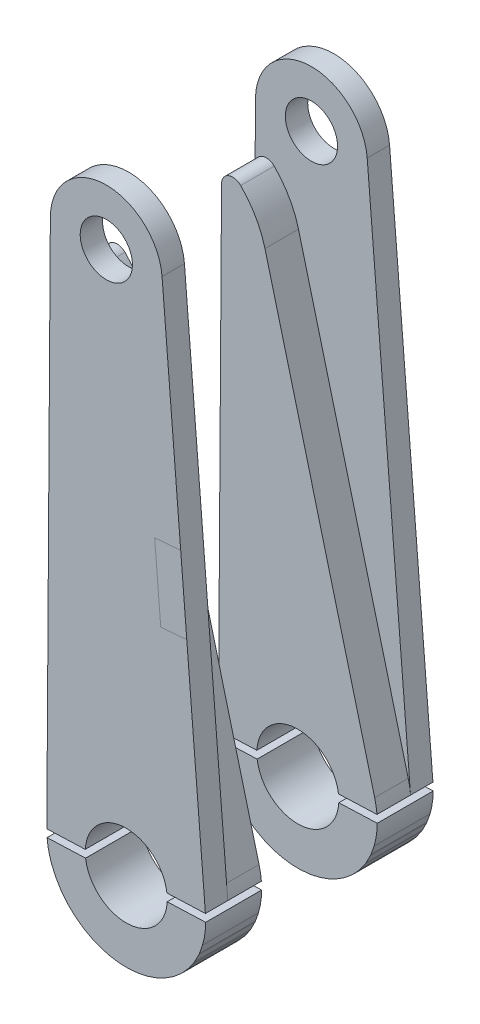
ISO-10303-21;
HEADER;
FILE_DESCRIPTION(('STEP AP214'),'2;1');
FILE_NAME('part.step','',(''),(''),'','','');
FILE_SCHEMA(('AUTOMOTIVE_DESIGN { 1 0 10303 214 1 1 1 1 }'));
ENDSEC;
DATA;
#1=APPLICATION_CONTEXT('core data for automotive mechanical design processes');
#2=APPLICATION_PROTOCOL_DEFINITION('international standard','automotive_design',2000,#1);
#3=PRODUCT_CONTEXT('',#1,'mechanical');
#4=PRODUCT('Part','Part','',(#3));
#5=PRODUCT_RELATED_PRODUCT_CATEGORY('part','',(#4));
#6=PRODUCT_DEFINITION_FORMATION('','',#4);
#7=PRODUCT_DEFINITION_CONTEXT('part definition',#1,'design');
#8=PRODUCT_DEFINITION('design','',#6,#7);
#9=PRODUCT_DEFINITION_SHAPE('','',#8);
#10=(LENGTH_UNIT() NAMED_UNIT(*) SI_UNIT(.MILLI.,.METRE.));
#11=(NAMED_UNIT(*) PLANE_ANGLE_UNIT() SI_UNIT($,.RADIAN.));
#12=(NAMED_UNIT(*) SI_UNIT($,.STERADIAN.) SOLID_ANGLE_UNIT());
#13=UNCERTAINTY_MEASURE_WITH_UNIT(LENGTH_MEASURE(1.E-05),#10,'distance_accuracy_value','');
#14=(GEOMETRIC_REPRESENTATION_CONTEXT(3) GLOBAL_UNCERTAINTY_ASSIGNED_CONTEXT((#13)) GLOBAL_UNIT_ASSIGNED_CONTEXT((#10,
#11,#12)) REPRESENTATION_CONTEXT('',''));
#15=CARTESIAN_POINT('',(0.,0.,0.));
#16=DIRECTION('',(0.,0.,1.));
#17=DIRECTION('',(1.,0.,0.));
#18=AXIS2_PLACEMENT_3D('',#15,#16,#17);
#19=CARTESIAN_POINT('',(173.481131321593,357.593625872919,-30.5000000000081));
#20=DIRECTION('',(-0.0374478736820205,0.999298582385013,0.));
#21=DIRECTION('',(-0.999298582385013,-0.0374478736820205,0.));
#22=AXIS2_PLACEMENT_3D('',#19,#20,#21);
#23=PLANE('',#22);
#24=DIRECTION('',(0.,0.,1.));
#25=VECTOR('',#24,1.);
#26=CARTESIAN_POINT('',(216.027865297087,359.188028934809,-32.500000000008));
#27=LINE('',#26,#25);
#28=CARTESIAN_POINT('',(216.027865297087,359.188028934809,-30.500000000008));
#29=VERTEX_POINT('',#28);
#30=CARTESIAN_POINT('',(216.027822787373,359.188027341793,-24.500000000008));
#31=VERTEX_POINT('',#30);
#32=EDGE_CURVE('P0_E348',#29,#31,#27,.T.);
#33=ORIENTED_EDGE('',*,*,#32,.T.);
#34=DIRECTION('',(0.,0.,1.));
#35=VECTOR('',#34,1.);
#36=CARTESIAN_POINT('',(216.027780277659,359.188025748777,-32.500000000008));
#37=LINE('',#36,#35);
#38=CARTESIAN_POINT('',(216.027780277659,359.188025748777,-15.500000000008));
#39=VERTEX_POINT('',#38);
#40=EDGE_CURVE('P0_E223',#31,#39,#37,.T.);
#41=ORIENTED_EDGE('',*,*,#40,.T.);
#42=DIRECTION('',(0.999298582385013,0.0374478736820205,0.));
#43=VECTOR('',#42,1.);
#44=CARTESIAN_POINT('',(194.766191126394,358.391265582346,-15.5000000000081));
#45=LINE('',#44,#43);
#46=CARTESIAN_POINT('',(205.712958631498,358.801486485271,-15.500000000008));
#47=VERTEX_POINT('',#46);
#48=EDGE_CURVE('P0_E359',#47,#39,#45,.T.);
#49=ORIENTED_EDGE('',*,*,#48,.F.);
#50=DIRECTION('',(0.,0.,1.));
#51=VECTOR('',#50,1.);
#52=CARTESIAN_POINT('',(205.712958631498,358.801486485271,-26.500000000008));
#53=LINE('',#52,#51);
#54=CARTESIAN_POINT('',(205.712958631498,358.801486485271,-30.500000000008));
#55=VERTEX_POINT('',#54);
#56=EDGE_CURVE('P0_E328',#55,#47,#53,.T.);
#57=ORIENTED_EDGE('',*,*,#56,.F.);
#58=DIRECTION('',(-0.999298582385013,-0.0374478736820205,0.));
#59=VECTOR('',#58,1.);
#60=CARTESIAN_POINT('',(173.481131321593,357.593625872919,-30.5000000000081));
#61=LINE('',#60,#59);
#62=EDGE_CURVE('P0_E381',#29,#55,#61,.T.);
#63=ORIENTED_EDGE('',*,*,#62,.F.);
#64=EDGE_LOOP('',(#33,#41,#49,#57,#63));
#65=FACE_BOUND('',#64,.T.);
#66=CARTESIAN_POINT('',(209.755669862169,358.952983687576,-23.000000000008));
#67=DIRECTION('',(0.0374478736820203,-0.999298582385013,0.));
#68=DIRECTION('',(0.,0.,-1.));
#69=AXIS2_PLACEMENT_3D('',#66,#67,#68);
#70=CIRCLE('',#69,2.5);
#71=CARTESIAN_POINT('',(209.755669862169,358.952983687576,-25.500000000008));
#72=VERTEX_POINT('',#71);
#73=EDGE_CURVE('P0_E304',#72,#72,#70,.T.);
#74=ORIENTED_EDGE('',*,*,#73,.F.);
#75=EDGE_LOOP('',(#74));
#76=FACE_BOUND('',#75,.T.);
#77=ADVANCED_FACE('P0_F213',(#65,#76),#23,.F.);
#78=CARTESIAN_POINT('',(194.803639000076,357.391966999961,-32.5000000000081));
#79=DIRECTION('',(0.,0.,1.));
#80=DIRECTION('',(0.0374478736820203,-0.999298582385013,0.));
#81=AXIS2_PLACEMENT_3D('',#78,#79,#80);
#82=CYLINDRICAL_SURFACE('',#81,21.3);
#83=ORIENTED_EDGE('',*,*,#40,.F.);
#84=CARTESIAN_POINT('',(194.803639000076,357.391966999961,-24.5000000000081));
#85=DIRECTION('',(0.,0.,-1.));
#86=DIRECTION('',(0.0374478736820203,-0.999298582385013,0.));
#87=AXIS2_PLACEMENT_3D('',#84,#85,#86);
#88=CIRCLE('',#87,21.3);
#89=CARTESIAN_POINT('',(215.41424680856,362.767173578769,-24.500000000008));
#90=VERTEX_POINT('',#89);
#91=EDGE_CURVE('P0_E319',#90,#31,#88,.T.);
#92=ORIENTED_EDGE('',*,*,#91,.F.);
#93=DIRECTION('',(0.,0.,-1.));
#94=VECTOR('',#93,1.);
#95=CARTESIAN_POINT('',(215.414246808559,362.767173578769,121.19703972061));
#96=LINE('',#95,#94);
#97=CARTESIAN_POINT('',(215.41424680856,362.767173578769,-15.500000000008));
#98=VERTEX_POINT('',#97);
#99=EDGE_CURVE('P0_E345',#98,#90,#96,.T.);
#100=ORIENTED_EDGE('',*,*,#99,.F.);
#101=CARTESIAN_POINT('',(194.803639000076,357.391966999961,-15.5000000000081));
#102=DIRECTION('',(0.,0.,-1.));
#103=DIRECTION('',(-0.0374478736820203,0.999298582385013,0.));
#104=AXIS2_PLACEMENT_3D('',#101,#102,#103);
#105=CIRCLE('',#104,21.3);
#106=EDGE_CURVE('P0_E314',#98,#39,#105,.T.);
#107=ORIENTED_EDGE('',*,*,#106,.T.);
#108=EDGE_LOOP('',(#83,#92,#100,#107));
#109=FACE_BOUND('',#108,.T.);
#110=ADVANCED_FACE('P0_F215',(#109),#82,.T.);
#111=CARTESIAN_POINT('',(194.803639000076,357.391966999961,-24.5000000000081));
#112=DIRECTION('',(0.,0.,1.));
#113=DIRECTION('',(0.0374478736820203,-0.999298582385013,0.));
#114=AXIS2_PLACEMENT_3D('',#111,#112,#113);
#115=PLANE('',#114);
#116=ORIENTED_EDGE('',*,*,#91,.T.);
#117=DIRECTION('',(-0.081506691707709,0.996672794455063,0.));
#118=VECTOR('',#117,1.);
#119=CARTESIAN_POINT('',(216.032769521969,359.128059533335,-24.500000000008));
#120=LINE('',#119,#118);
#121=CARTESIAN_POINT('',(204.407216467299,501.286601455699,-24.5000000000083));
#122=VERTEX_POINT('',#121);
#123=EDGE_CURVE('P0_E315',#31,#122,#120,.T.);
#124=ORIENTED_EDGE('',*,*,#123,.T.);
#125=CARTESIAN_POINT('',(189.457124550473,500.064001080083,-24.5000000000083));
#126=DIRECTION('',(0.,0.,1.));
#127=DIRECTION('',(0.0374478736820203,-0.999298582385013,0.));
#128=AXIS2_PLACEMENT_3D('',#125,#126,#127);
#129=CIRCLE('',#128,15.);
#130=CARTESIAN_POINT('',(174.457459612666,500.164259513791,-24.5000000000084));
#131=VERTEX_POINT('',#130);
#132=EDGE_CURVE('P0_E318',#122,#131,#129,.T.);
#133=ORIENTED_EDGE('',*,*,#132,.T.);
#134=DIRECTION('',(-0.00668389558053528,-0.999977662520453,0.));
#135=VECTOR('',#134,1.);
#136=CARTESIAN_POINT('',(174.457459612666,500.164259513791,-24.5000000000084));
#137=LINE('',#136,#135);
#138=CARTESIAN_POINT('',(174.355084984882,484.847990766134,-24.5000000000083));
#139=VERTEX_POINT('',#138);
#140=EDGE_CURVE('P0_E352',#131,#139,#137,.T.);
#141=ORIENTED_EDGE('',*,*,#140,.T.);
#142=CARTESIAN_POINT('',(177.355017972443,484.827939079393,-24.5000000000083));
#143=DIRECTION('',(0.,0.,1.));
#144=DIRECTION('',(0.0374478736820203,-0.999298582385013,0.));
#145=AXIS2_PLACEMENT_3D('',#142,#143,#144);
#146=CIRCLE('',#145,3.);
#147=CARTESIAN_POINT('',(179.47574395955,486.949853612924,-24.5000000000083));
#148=VERTEX_POINT('',#147);
#149=EDGE_CURVE('P0_E349',#139,#148,#146,.F.);
#150=ORIENTED_EDGE('',*,*,#149,.T.);
#151=CARTESIAN_POINT('',(161.803027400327,469.267232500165,-24.5000000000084));
#152=DIRECTION('',(0.,0.,1.));
#153=DIRECTION('',(0.0374478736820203,-0.999298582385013,0.));
#154=AXIS2_PLACEMENT_3D('',#151,#152,#153);
#155=CIRCLE('',#154,25.);
#156=CARTESIAN_POINT('',(185.993881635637,475.576160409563,-24.5000000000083));
#157=VERTEX_POINT('',#156);
#158=EDGE_CURVE('P0_E334',#157,#148,#155,.T.);
#159=ORIENTED_EDGE('',*,*,#158,.F.);
#160=DIRECTION('',(0.252357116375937,-0.967634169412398,0.));
#161=VECTOR('',#160,1.);
#162=CARTESIAN_POINT('',(215.41424680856,362.767173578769,-24.500000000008));
#163=LINE('',#162,#161);
#164=EDGE_CURVE('P0_E351',#157,#90,#163,.T.);
#165=ORIENTED_EDGE('',*,*,#164,.T.);
#166=EDGE_LOOP('',(#116,#124,#133,#141,#150,#159,#165));
#167=FACE_BOUND('',#166,.T.);
#168=CARTESIAN_POINT('',(189.457124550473,500.064001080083,-24.5000000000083));
#169=DIRECTION('',(0.,0.,1.));
#170=DIRECTION('',(0.0374478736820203,-0.999298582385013,0.));
#171=AXIS2_PLACEMENT_3D('',#168,#169,#170);
#172=CIRCLE('',#171,7.00000000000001);
#173=CARTESIAN_POINT('',(189.719259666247,493.068911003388,-24.5000000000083));
#174=VERTEX_POINT('',#173);
#175=EDGE_CURVE('P0_E326',#174,#174,#172,.T.);
#176=ORIENTED_EDGE('',*,*,#175,.F.);
#177=EDGE_LOOP('',(#176));
#178=FACE_BOUND('',#177,.T.);
#179=ADVANCED_FACE('P0_F402',(#167,#178),#115,.T.);
#180=CARTESIAN_POINT('',(189.457124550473,500.064001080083,-32.5000000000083));
#181=DIRECTION('',(0.,0.,1.));
#182=DIRECTION('',(0.0374478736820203,-0.999298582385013,0.));
#183=AXIS2_PLACEMENT_3D('',#180,#181,#182);
#184=CYLINDRICAL_SURFACE('',#183,15.);
#185=CARTESIAN_POINT('',(189.457124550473,500.064001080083,-30.5000000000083));
#186=DIRECTION('',(0.,0.,1.));
#187=DIRECTION('',(0.0374478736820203,-0.999298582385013,0.));
#188=AXIS2_PLACEMENT_3D('',#185,#186,#187);
#189=CIRCLE('',#188,15.);
#190=CARTESIAN_POINT('',(204.407216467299,501.286601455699,-30.5000000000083));
#191=VERTEX_POINT('',#190);
#192=CARTESIAN_POINT('',(174.457459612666,500.164259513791,-30.5000000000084));
#193=VERTEX_POINT('',#192);
#194=EDGE_CURVE('P0_E356',#191,#193,#189,.T.);
#195=ORIENTED_EDGE('',*,*,#194,.T.);
#196=DIRECTION('',(0.,0.,1.));
#197=VECTOR('',#196,1.);
#198=CARTESIAN_POINT('',(174.457459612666,500.164259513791,-32.5000000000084));
#199=LINE('',#198,#197);
#200=EDGE_CURVE('P0_E410',#193,#131,#199,.T.);
#201=ORIENTED_EDGE('',*,*,#200,.T.);
#202=ORIENTED_EDGE('',*,*,#132,.F.);
#203=DIRECTION('',(0.,0.,1.));
#204=VECTOR('',#203,1.);
#205=CARTESIAN_POINT('',(204.407216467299,501.286601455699,-32.5000000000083));
#206=LINE('',#205,#204);
#207=EDGE_CURVE('P0_E365',#191,#122,#206,.T.);
#208=ORIENTED_EDGE('',*,*,#207,.F.);
#209=EDGE_LOOP('',(#195,#201,#202,#208));
#210=FACE_BOUND('',#209,.T.);
#211=ADVANCED_FACE('P0_F464',(#210),#184,.T.);
#212=CARTESIAN_POINT('',(216.032769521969,359.128059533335,-32.500000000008));
#213=DIRECTION('',(0.996672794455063,0.0815066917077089,0.));
#214=DIRECTION('',(-0.0815066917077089,0.996672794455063,0.));
#215=AXIS2_PLACEMENT_3D('',#212,#213,#214);
#216=PLANE('',#215);
#217=ORIENTED_EDGE('',*,*,#32,.F.);
#218=DIRECTION('',(-0.0815066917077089,0.996672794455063,0.));
#219=VECTOR('',#218,1.);
#220=CARTESIAN_POINT('',(216.032769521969,359.128059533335,-30.500000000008));
#221=LINE('',#220,#219);
#222=EDGE_CURVE('P0_E436',#29,#191,#221,.T.);
#223=ORIENTED_EDGE('',*,*,#222,.T.);
#224=ORIENTED_EDGE('',*,*,#207,.T.);
#225=ORIENTED_EDGE('',*,*,#123,.F.);
#226=EDGE_LOOP('',(#217,#223,#224,#225));
#227=FACE_BOUND('',#226,.T.);
#228=ADVANCED_FACE('P0_F435',(#227),#216,.T.);
#229=CARTESIAN_POINT('',(173.50411478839,357.534333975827,-32.5000000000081));
#230=DIRECTION('',(-0.999977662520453,0.00668389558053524,0.));
#231=DIRECTION('',(-0.00668389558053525,-0.999977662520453,0.));
#232=AXIS2_PLACEMENT_3D('',#229,#230,#231);
#233=PLANE('',#232);
#234=DIRECTION('',(0.,0.,-1.));
#235=VECTOR('',#234,1.);
#236=CARTESIAN_POINT('',(173.504516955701,357.594502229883,-32.5000000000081));
#237=LINE('',#236,#235);
#238=CARTESIAN_POINT('',(173.504516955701,357.594502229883,-15.5000000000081));
#239=VERTEX_POINT('',#238);
#240=CARTESIAN_POINT('',(173.504516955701,357.594502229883,-30.5000000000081));
#241=VERTEX_POINT('',#240);
#242=EDGE_CURVE('P0_E14',#239,#241,#237,.T.);
#243=ORIENTED_EDGE('',*,*,#242,.F.);
#244=DIRECTION('',(0.00668389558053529,0.999977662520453,0.));
#245=VECTOR('',#244,1.);
#246=CARTESIAN_POINT('',(173.50411478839,357.534333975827,-15.5000000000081));
#247=LINE('',#246,#245);
#248=CARTESIAN_POINT('',(174.355084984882,484.847990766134,-15.5000000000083));
#249=VERTEX_POINT('',#248);
#250=EDGE_CURVE('P0_E344',#239,#249,#247,.T.);
#251=ORIENTED_EDGE('',*,*,#250,.T.);
#252=DIRECTION('',(0.,0.,-1.));
#253=VECTOR('',#252,1.);
#254=CARTESIAN_POINT('',(174.355084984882,484.847990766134,121.19703972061));
#255=LINE('',#254,#253);
#256=EDGE_CURVE('P0_E340',#249,#139,#255,.T.);
#257=ORIENTED_EDGE('',*,*,#256,.T.);
#258=ORIENTED_EDGE('',*,*,#140,.F.);
#259=ORIENTED_EDGE('',*,*,#200,.F.);
#260=DIRECTION('',(-0.00668389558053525,-0.999977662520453,0.));
#261=VECTOR('',#260,1.);
#262=CARTESIAN_POINT('',(173.50411478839,357.534333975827,-30.5000000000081));
#263=LINE('',#262,#261);
#264=EDGE_CURVE('P0_E343',#193,#241,#263,.T.);
#265=ORIENTED_EDGE('',*,*,#264,.T.);
#266=EDGE_LOOP('',(#243,#251,#257,#258,#259,#265));
#267=FACE_BOUND('',#266,.T.);
#268=ADVANCED_FACE('P0_F409',(#267),#233,.T.);
#269=CARTESIAN_POINT('',(194.803639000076,357.391966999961,-30.5000000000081));
#270=DIRECTION('',(0.,0.,1.));
#271=DIRECTION('',(0.0374478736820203,-0.999298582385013,0.));
#272=AXIS2_PLACEMENT_3D('',#269,#270,#271);
#273=PLANE('',#272);
#274=CARTESIAN_POINT('',(189.457124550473,500.064001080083,-30.5000000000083));
#275=DIRECTION('',(0.,0.,1.));
#276=DIRECTION('',(0.0374478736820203,-0.999298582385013,0.));
#277=AXIS2_PLACEMENT_3D('',#274,#275,#276);
#278=CIRCLE('',#277,7.00000000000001);
#279=CARTESIAN_POINT('',(189.719259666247,493.068911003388,-30.5000000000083));
#280=VERTEX_POINT('',#279);
#281=EDGE_CURVE('P0_E387',#280,#280,#278,.T.);
#282=ORIENTED_EDGE('',*,*,#281,.T.);
#283=EDGE_LOOP('',(#282));
#284=FACE_BOUND('',#283,.T.);
#285=ORIENTED_EDGE('',*,*,#222,.F.);
#286=ORIENTED_EDGE('',*,*,#62,.T.);
#287=CARTESIAN_POINT('',(194.803639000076,357.391966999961,-30.5000000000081));
#288=DIRECTION('',(0.,0.,1.));
#289=DIRECTION('',(0.0374478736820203,-0.999298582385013,0.));
#290=AXIS2_PLACEMENT_3D('',#287,#288,#289);
#291=CIRCLE('',#290,11.);
#292=CARTESIAN_POINT('',(183.81942362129,357.981044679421,-30.5000000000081));
#293=VERTEX_POINT('',#292);
#294=EDGE_CURVE('P0_E380',#55,#293,#291,.T.);
#295=ORIENTED_EDGE('',*,*,#294,.T.);
#296=EDGE_CURVE('P0_E375',#293,#241,#61,.T.);
#297=ORIENTED_EDGE('',*,*,#296,.T.);
#298=ORIENTED_EDGE('',*,*,#264,.F.);
#299=ORIENTED_EDGE('',*,*,#194,.F.);
#300=EDGE_LOOP('',(#285,#286,#295,#297,#298,#299));
#301=FACE_BOUND('',#300,.T.);
#302=ADVANCED_FACE('P0_F469',(#284,#301),#273,.F.);
#303=CARTESIAN_POINT('',(194.803639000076,357.391966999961,-26.5000000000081));
#304=DIRECTION('',(0.,0.,1.));
#305=DIRECTION('',(0.0374478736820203,-0.999298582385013,0.));
#306=AXIS2_PLACEMENT_3D('',#303,#304,#305);
#307=CYLINDRICAL_SURFACE('',#306,11.);
#308=CARTESIAN_POINT('',(194.803639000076,357.391966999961,-15.5000000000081));
#309=DIRECTION('',(0.,0.,-1.));
#310=DIRECTION('',(-0.0374478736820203,0.999298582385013,0.));
#311=AXIS2_PLACEMENT_3D('',#308,#309,#310);
#312=CIRCLE('',#311,11.);
#313=CARTESIAN_POINT('',(183.81942362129,357.981044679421,-15.5000000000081));
#314=VERTEX_POINT('',#313);
#315=EDGE_CURVE('P0_E217',#314,#47,#312,.T.);
#316=ORIENTED_EDGE('',*,*,#315,.F.);
#317=DIRECTION('',(0.,0.,1.));
#318=VECTOR('',#317,1.);
#319=CARTESIAN_POINT('',(183.81942362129,357.981044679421,-26.5000000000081));
#320=LINE('',#319,#318);
#321=EDGE_CURVE('P0_E372',#314,#293,#320,.F.);
#322=ORIENTED_EDGE('',*,*,#321,.T.);
#323=ORIENTED_EDGE('',*,*,#294,.F.);
#324=ORIENTED_EDGE('',*,*,#56,.T.);
#325=EDGE_LOOP('',(#316,#322,#323,#324));
#326=FACE_BOUND('',#325,.T.);
#327=ADVANCED_FACE('P0_F445',(#326),#307,.F.);
#328=CARTESIAN_POINT('',(189.457124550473,500.064001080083,-26.5000000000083));
#329=DIRECTION('',(0.,0.,1.));
#330=DIRECTION('',(0.0374478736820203,-0.999298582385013,0.));
#331=AXIS2_PLACEMENT_3D('',#328,#329,#330);
#332=CYLINDRICAL_SURFACE('',#331,7.00000000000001);
#333=CARTESIAN_POINT('',(189.719259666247,493.068911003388,-30.5000000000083));
#334=CARTESIAN_POINT('',(189.719259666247,493.068911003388,-30.4375000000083));
#335=CARTESIAN_POINT('',(189.719259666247,493.068911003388,-30.3750000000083));
#336=CARTESIAN_POINT('',(189.719259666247,493.068911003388,-30.2500000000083));
#337=CARTESIAN_POINT('',(189.719259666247,493.068911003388,-30.1875000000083));
#338=CARTESIAN_POINT('',(189.719259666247,493.068911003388,-30.0625000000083));
#339=CARTESIAN_POINT('',(189.719259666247,493.068911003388,-30.0000000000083));
#340=CARTESIAN_POINT('',(189.719259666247,493.068911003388,-29.8750000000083));
#341=CARTESIAN_POINT('',(189.719259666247,493.068911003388,-29.8125000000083));
#342=CARTESIAN_POINT('',(189.719259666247,493.068911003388,-29.6875000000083));
#343=CARTESIAN_POINT('',(189.719259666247,493.068911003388,-29.6250000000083));
#344=CARTESIAN_POINT('',(189.719259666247,493.068911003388,-29.5000000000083));
#345=CARTESIAN_POINT('',(189.719259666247,493.068911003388,-29.4375000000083));
#346=CARTESIAN_POINT('',(189.719259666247,493.068911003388,-29.3125000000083));
#347=CARTESIAN_POINT('',(189.719259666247,493.068911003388,-29.2500000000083));
#348=CARTESIAN_POINT('',(189.719259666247,493.068911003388,-29.1250000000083));
#349=CARTESIAN_POINT('',(189.719259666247,493.068911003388,-29.0625000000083));
#350=CARTESIAN_POINT('',(189.719259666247,493.068911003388,-28.9375000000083));
#351=CARTESIAN_POINT('',(189.719259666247,493.068911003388,-28.8750000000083));
#352=CARTESIAN_POINT('',(189.719259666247,493.068911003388,-28.7500000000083));
#353=CARTESIAN_POINT('',(189.719259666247,493.068911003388,-28.6875000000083));
#354=CARTESIAN_POINT('',(189.719259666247,493.068911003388,-28.5625000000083));
#355=CARTESIAN_POINT('',(189.719259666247,493.068911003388,-28.5000000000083));
#356=CARTESIAN_POINT('',(189.719259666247,493.068911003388,-28.3750000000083));
#357=CARTESIAN_POINT('',(189.719259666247,493.068911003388,-28.3125000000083));
#358=CARTESIAN_POINT('',(189.719259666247,493.068911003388,-28.1875000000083));
#359=CARTESIAN_POINT('',(189.719259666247,493.068911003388,-28.1250000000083));
#360=CARTESIAN_POINT('',(189.719259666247,493.068911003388,-28.0000000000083));
#361=CARTESIAN_POINT('',(189.719259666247,493.068911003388,-27.9375000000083));
#362=CARTESIAN_POINT('',(189.719259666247,493.068911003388,-27.8125000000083));
#363=CARTESIAN_POINT('',(189.719259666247,493.068911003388,-27.7500000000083));
#364=CARTESIAN_POINT('',(189.719259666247,493.068911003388,-27.6250000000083));
#365=CARTESIAN_POINT('',(189.719259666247,493.068911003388,-27.5625000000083));
#366=CARTESIAN_POINT('',(189.719259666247,493.068911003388,-27.4375000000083));
#367=CARTESIAN_POINT('',(189.719259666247,493.068911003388,-27.3750000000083));
#368=CARTESIAN_POINT('',(189.719259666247,493.068911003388,-27.2500000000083));
#369=CARTESIAN_POINT('',(189.719259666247,493.068911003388,-27.1875000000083));
#370=CARTESIAN_POINT('',(189.719259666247,493.068911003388,-27.0625000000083));
#371=CARTESIAN_POINT('',(189.719259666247,493.068911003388,-27.0000000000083));
#372=CARTESIAN_POINT('',(189.719259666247,493.068911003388,-26.8750000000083));
#373=CARTESIAN_POINT('',(189.719259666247,493.068911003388,-26.8125000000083));
#374=CARTESIAN_POINT('',(189.719259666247,493.068911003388,-26.6875000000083));
#375=CARTESIAN_POINT('',(189.719259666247,493.068911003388,-26.6250000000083));
#376=CARTESIAN_POINT('',(189.719259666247,493.068911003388,-26.5000000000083));
#377=CARTESIAN_POINT('',(189.719259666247,493.068911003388,-26.4375000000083));
#378=CARTESIAN_POINT('',(189.719259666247,493.068911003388,-26.3125000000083));
#379=CARTESIAN_POINT('',(189.719259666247,493.068911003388,-26.2500000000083));
#380=CARTESIAN_POINT('',(189.719259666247,493.068911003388,-26.1250000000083));
#381=CARTESIAN_POINT('',(189.719259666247,493.068911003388,-26.0625000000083));
#382=CARTESIAN_POINT('',(189.719259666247,493.068911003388,-25.9375000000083));
#383=CARTESIAN_POINT('',(189.719259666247,493.068911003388,-25.8750000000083));
#384=CARTESIAN_POINT('',(189.719259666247,493.068911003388,-25.7500000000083));
#385=CARTESIAN_POINT('',(189.719259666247,493.068911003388,-25.6875000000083));
#386=CARTESIAN_POINT('',(189.719259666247,493.068911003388,-25.5625000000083));
#387=CARTESIAN_POINT('',(189.719259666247,493.068911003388,-25.5000000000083));
#388=CARTESIAN_POINT('',(189.719259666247,493.068911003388,-25.3750000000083));
#389=CARTESIAN_POINT('',(189.719259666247,493.068911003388,-25.3125000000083));
#390=CARTESIAN_POINT('',(189.719259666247,493.068911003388,-25.1875000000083));
#391=CARTESIAN_POINT('',(189.719259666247,493.068911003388,-25.1250000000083));
#392=CARTESIAN_POINT('',(189.719259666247,493.068911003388,-25.0000000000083));
#393=CARTESIAN_POINT('',(189.719259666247,493.068911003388,-24.9375000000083));
#394=CARTESIAN_POINT('',(189.719259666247,493.068911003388,-24.8125000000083));
#395=CARTESIAN_POINT('',(189.719259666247,493.068911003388,-24.7500000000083));
#396=CARTESIAN_POINT('',(189.719259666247,493.068911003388,-24.6250000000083));
#397=CARTESIAN_POINT('',(189.719259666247,493.068911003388,-24.5625000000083));
#398=CARTESIAN_POINT('',(189.719259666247,493.068911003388,-24.5000000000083));
#399=B_SPLINE_CURVE_WITH_KNOTS('',3,(#333,#334,#335,#336,#337,#338,#339,#340,#341,#342,#343,
#344,#345,#346,#347,#348,#349,#350,#351,#352,#353,#354,#355,#356,#357,#358,#359,#360,#361,#362,
#363,#364,#365,#366,#367,#368,#369,#370,#371,#372,#373,#374,#375,#376,#377,#378,#379,#380,#381,
#382,#383,#384,#385,#386,#387,#388,#389,#390,#391,#392,#393,#394,#395,#396,#397,#398),
.UNSPECIFIED.,.F.,.F.,(4,2,2,2,2,2,2,2,2,2,2,2,2,2,2,2,2,2,2,2,2,2,2,2,2,2,2,2,2,2,2,2,4),(0.,
0.1875,0.374999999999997,0.562499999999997,0.749999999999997,0.937499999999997,1.125,1.3125,1.5,
1.6875,1.875,2.0625,2.25,2.4375,2.625,2.8125,3.,3.1875,3.375,3.5625,3.75,3.9375,4.125,4.3125,
4.5,4.6875,4.875,5.0625,5.25,5.4375,5.625,5.8125,6.),.UNSPECIFIED.);
#400=EDGE_CURVE('P0_BSEAM472',#280,#174,#399,.T.);
#401=ORIENTED_EDGE('',*,*,#281,.F.);
#402=ORIENTED_EDGE('',*,*,#175,.T.);
#403=ORIENTED_EDGE('',*,*,#400,.T.);
#404=ORIENTED_EDGE('',*,*,#400,.F.);
#405=EDGE_LOOP('',(#401,#403,#402,#404));
#406=FACE_BOUND('',#405,.T.);
#407=ADVANCED_FACE('P0_F472',(#406),#332,.F.);
#408=CARTESIAN_POINT('',(194.803639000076,357.391966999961,-15.5000000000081));
#409=DIRECTION('',(0.,0.,-1.));
#410=DIRECTION('',(-0.0374478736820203,0.999298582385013,0.));
#411=AXIS2_PLACEMENT_3D('',#408,#409,#410);
#412=PLANE('',#411);
#413=ORIENTED_EDGE('',*,*,#250,.F.);
#414=EDGE_CURVE('P0_E230',#239,#314,#45,.T.);
#415=ORIENTED_EDGE('',*,*,#414,.T.);
#416=ORIENTED_EDGE('',*,*,#315,.T.);
#417=ORIENTED_EDGE('',*,*,#48,.T.);
#418=ORIENTED_EDGE('',*,*,#106,.F.);
#419=DIRECTION('',(-0.252357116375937,0.967634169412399,0.));
#420=VECTOR('',#419,1.);
#421=CARTESIAN_POINT('',(215.41424680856,362.767173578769,-15.500000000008));
#422=LINE('',#421,#420);
#423=CARTESIAN_POINT('',(185.993881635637,475.576160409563,-15.5000000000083));
#424=VERTEX_POINT('',#423);
#425=EDGE_CURVE('P0_E357',#98,#424,#422,.T.);
#426=ORIENTED_EDGE('',*,*,#425,.T.);
#427=CARTESIAN_POINT('',(161.803027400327,469.267232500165,-15.5000000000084));
#428=DIRECTION('',(0.,0.,-1.));
#429=DIRECTION('',(-0.0374478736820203,0.999298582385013,0.));
#430=AXIS2_PLACEMENT_3D('',#427,#428,#429);
#431=CIRCLE('',#430,25.);
#432=CARTESIAN_POINT('',(179.47574395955,486.949853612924,-15.5000000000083));
#433=VERTEX_POINT('',#432);
#434=EDGE_CURVE('P0_E335',#433,#424,#431,.T.);
#435=ORIENTED_EDGE('',*,*,#434,.F.);
#436=CARTESIAN_POINT('',(177.355017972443,484.827939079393,-15.5000000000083));
#437=DIRECTION('',(0.,0.,-1.));
#438=DIRECTION('',(-0.0374478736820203,0.999298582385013,0.));
#439=AXIS2_PLACEMENT_3D('',#436,#437,#438);
#440=CIRCLE('',#439,3.);
#441=EDGE_CURVE('P0_E339',#433,#249,#440,.F.);
#442=ORIENTED_EDGE('',*,*,#441,.T.);
#443=EDGE_LOOP('',(#413,#415,#416,#417,#418,#426,#435,#442));
#444=FACE_BOUND('',#443,.T.);
#445=ADVANCED_FACE('P0_F443',(#444),#412,.F.);
#446=CARTESIAN_POINT('',(177.355017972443,484.827939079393,121.19703972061));
#447=DIRECTION('',(0.,0.,-1.));
#448=DIRECTION('',(-0.0374478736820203,0.999298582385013,0.));
#449=AXIS2_PLACEMENT_3D('',#446,#447,#448);
#450=CYLINDRICAL_SURFACE('',#449,3.);
#451=ORIENTED_EDGE('',*,*,#441,.F.);
#452=DIRECTION('',(0.,0.,-1.));
#453=VECTOR('',#452,1.);
#454=CARTESIAN_POINT('',(179.47574395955,486.949853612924,121.19703972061));
#455=LINE('',#454,#453);
#456=EDGE_CURVE('P0_E336',#433,#148,#455,.T.);
#457=ORIENTED_EDGE('',*,*,#456,.T.);
#458=ORIENTED_EDGE('',*,*,#149,.F.);
#459=ORIENTED_EDGE('',*,*,#256,.F.);
#460=EDGE_LOOP('',(#451,#457,#458,#459));
#461=FACE_BOUND('',#460,.T.);
#462=ADVANCED_FACE('P0_F417',(#461),#450,.T.);
#463=CARTESIAN_POINT('',(161.803027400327,469.267232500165,121.19703972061));
#464=DIRECTION('',(0.,0.,-1.));
#465=DIRECTION('',(-0.0374478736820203,0.999298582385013,0.));
#466=AXIS2_PLACEMENT_3D('',#463,#464,#465);
#467=CYLINDRICAL_SURFACE('',#466,25.);
#468=ORIENTED_EDGE('',*,*,#456,.F.);
#469=ORIENTED_EDGE('',*,*,#434,.T.);
#470=DIRECTION('',(0.,0.,-1.));
#471=VECTOR('',#470,1.);
#472=CARTESIAN_POINT('',(185.993881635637,475.576160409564,121.19703972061));
#473=LINE('',#472,#471);
#474=EDGE_CURVE('P0_E331',#424,#157,#473,.T.);
#475=ORIENTED_EDGE('',*,*,#474,.T.);
#476=ORIENTED_EDGE('',*,*,#158,.T.);
#477=EDGE_LOOP('',(#468,#469,#475,#476));
#478=FACE_BOUND('',#477,.T.);
#479=ADVANCED_FACE('P0_F423',(#478),#467,.T.);
#480=CARTESIAN_POINT('',(215.414246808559,362.767173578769,121.19703972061));
#481=DIRECTION('',(0.967634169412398,0.252357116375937,0.));
#482=DIRECTION('',(-0.252357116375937,0.967634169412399,0.));
#483=AXIS2_PLACEMENT_3D('',#480,#481,#482);
#484=PLANE('',#483);
#485=ORIENTED_EDGE('',*,*,#425,.F.);
#486=ORIENTED_EDGE('',*,*,#99,.T.);
#487=ORIENTED_EDGE('',*,*,#164,.F.);
#488=ORIENTED_EDGE('',*,*,#474,.F.);
#489=EDGE_LOOP('',(#485,#486,#487,#488));
#490=FACE_BOUND('',#489,.T.);
#491=ADVANCED_FACE('P0_F426',(#490),#484,.T.);
#492=CARTESIAN_POINT('',(179.776712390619,357.829547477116,-23.0000000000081));
#493=DIRECTION('',(0.0374478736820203,-0.999298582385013,0.));
#494=DIRECTION('',(0.,0.,-1.));
#495=AXIS2_PLACEMENT_3D('',#492,#493,#494);
#496=CIRCLE('',#495,2.5);
#497=CARTESIAN_POINT('',(179.776712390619,357.829547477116,-25.5000000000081));
#498=VERTEX_POINT('',#497);
#499=EDGE_CURVE('P0_E303',#498,#498,#496,.T.);
#500=ORIENTED_EDGE('',*,*,#499,.F.);
#501=EDGE_LOOP('',(#500));
#502=FACE_BOUND('',#501,.T.);
#503=ORIENTED_EDGE('',*,*,#242,.T.);
#504=ORIENTED_EDGE('',*,*,#296,.F.);
#505=ORIENTED_EDGE('',*,*,#321,.F.);
#506=ORIENTED_EDGE('',*,*,#414,.F.);
#507=EDGE_LOOP('',(#503,#504,#505,#506));
#508=FACE_BOUND('',#507,.T.);
#509=ADVANCED_FACE('P0_F449',(#502,#508),#23,.F.);
#510=CARTESIAN_POINT('',(179.214994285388,372.819026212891,-23.0000000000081));
#511=DIRECTION('',(0.0374478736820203,-0.999298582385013,0.));
#512=DIRECTION('',(0.,0.,-1.));
#513=AXIS2_PLACEMENT_3D('',#510,#511,#512);
#514=CONICAL_SURFACE('',#513,2.5,1.02974425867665);
#515=CARTESIAN_POINT('',(179.158741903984,374.320124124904,-23.0000000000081));
#516=VERTEX_POINT('',#515);
#517=VERTEX_LOOP('',#516);
#518=FACE_BOUND('',#517,.T.);
#519=CARTESIAN_POINT('',(179.214994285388,372.819026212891,-23.0000000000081));
#520=DIRECTION('',(0.0374478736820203,-0.999298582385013,0.));
#521=DIRECTION('',(0.,0.,-1.));
#522=AXIS2_PLACEMENT_3D('',#519,#520,#521);
#523=CIRCLE('',#522,2.5);
#524=CARTESIAN_POINT('',(179.214994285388,372.819026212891,-25.5000000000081));
#525=VERTEX_POINT('',#524);
#526=EDGE_CURVE('P0_E307',#525,#525,#523,.T.);
#527=ORIENTED_EDGE('',*,*,#526,.T.);
#528=EDGE_LOOP('',(#527));
#529=FACE_BOUND('',#528,.T.);
#530=ADVANCED_FACE('P0_F459',(#518,#529),#514,.F.);
#531=CARTESIAN_POINT('',(179.776712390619,357.829547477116,-23.0000000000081));
#532=DIRECTION('',(0.0374478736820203,-0.999298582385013,0.));
#533=DIRECTION('',(0.,0.,-1.));
#534=AXIS2_PLACEMENT_3D('',#531,#532,#533);
#535=CYLINDRICAL_SURFACE('',#534,2.5);
#536=ORIENTED_EDGE('',*,*,#526,.F.);
#537=EDGE_LOOP('',(#536));
#538=FACE_BOUND('',#537,.T.);
#539=ORIENTED_EDGE('',*,*,#499,.T.);
#540=EDGE_LOOP('',(#539));
#541=FACE_BOUND('',#540,.T.);
#542=ADVANCED_FACE('P0_F297',(#538,#541),#535,.F.);
#543=CARTESIAN_POINT('',(209.193951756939,373.942462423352,-23.000000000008));
#544=DIRECTION('',(0.0374478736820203,-0.999298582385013,0.));
#545=DIRECTION('',(0.,0.,-1.));
#546=AXIS2_PLACEMENT_3D('',#543,#544,#545);
#547=CONICAL_SURFACE('',#546,2.5,1.02974425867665);
#548=CARTESIAN_POINT('',(209.137699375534,375.443560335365,-23.000000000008));
#549=VERTEX_POINT('',#548);
#550=VERTEX_LOOP('',#549);
#551=FACE_BOUND('',#550,.T.);
#552=CARTESIAN_POINT('',(209.193951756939,373.942462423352,-23.000000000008));
#553=DIRECTION('',(0.0374478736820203,-0.999298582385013,0.));
#554=DIRECTION('',(0.,0.,-1.));
#555=AXIS2_PLACEMENT_3D('',#552,#553,#554);
#556=CIRCLE('',#555,2.5);
#557=CARTESIAN_POINT('',(209.193951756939,373.942462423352,-25.500000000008));
#558=VERTEX_POINT('',#557);
#559=EDGE_CURVE('P0_E301',#558,#558,#556,.T.);
#560=ORIENTED_EDGE('',*,*,#559,.T.);
#561=EDGE_LOOP('',(#560));
#562=FACE_BOUND('',#561,.T.);
#563=ADVANCED_FACE('P0_F293',(#551,#562),#547,.F.);
#564=CARTESIAN_POINT('',(209.755669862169,358.952983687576,-23.000000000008));
#565=DIRECTION('',(0.0374478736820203,-0.999298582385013,0.));
#566=DIRECTION('',(0.,0.,-1.));
#567=AXIS2_PLACEMENT_3D('',#564,#565,#566);
#568=CYLINDRICAL_SURFACE('',#567,2.5);
#569=ORIENTED_EDGE('',*,*,#559,.F.);
#570=EDGE_LOOP('',(#569));
#571=FACE_BOUND('',#570,.T.);
#572=ORIENTED_EDGE('',*,*,#73,.T.);
#573=EDGE_LOOP('',(#572));
#574=FACE_BOUND('',#573,.T.);
#575=ADVANCED_FACE('P0_F296',(#571,#574),#568,.F.);
#576=CLOSED_SHELL('',(#77,#110,#179,#211,#228,#268,#302,#327,#407,#445,#462,#479,#491,#509,#530,
#542,#563,#575));
#577=MANIFOLD_SOLID_BREP('P0_B2',#576);
#578=CARTESIAN_POINT('',(173.481131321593,357.593625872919,30.4999999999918));
#579=DIRECTION('',(-0.0374478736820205,0.999298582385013,0.));
#580=DIRECTION('',(-0.999298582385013,-0.0374478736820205,0.));
#581=AXIS2_PLACEMENT_3D('',#578,#579,#580);
#582=PLANE('',#581);
#583=DIRECTION('',(0.,0.,-1.));
#584=VECTOR('',#583,1.);
#585=CARTESIAN_POINT('',(216.027865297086,359.188028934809,32.4999999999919));
#586=LINE('',#585,#584);
#587=CARTESIAN_POINT('',(216.027865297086,359.188028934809,30.4999999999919));
#588=VERTEX_POINT('',#587);
#589=CARTESIAN_POINT('',(216.027822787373,359.188027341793,24.4999999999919));
#590=VERTEX_POINT('',#589);
#591=EDGE_CURVE('P0_E827',#588,#590,#586,.T.);
#592=ORIENTED_EDGE('',*,*,#591,.F.);
#593=DIRECTION('',(-0.999298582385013,-0.0374478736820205,0.));
#594=VECTOR('',#593,1.);
#595=CARTESIAN_POINT('',(173.481131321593,357.593625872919,30.4999999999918));
#596=LINE('',#595,#594);
#597=CARTESIAN_POINT('',(205.712958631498,358.801486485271,30.4999999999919));
#598=VERTEX_POINT('',#597);
#599=EDGE_CURVE('P0_E805',#588,#598,#596,.T.);
#600=ORIENTED_EDGE('',*,*,#599,.T.);
#601=DIRECTION('',(0.,0.,-1.));
#602=VECTOR('',#601,1.);
#603=CARTESIAN_POINT('',(205.712958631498,358.801486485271,26.4999999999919));
#604=LINE('',#603,#602);
#605=CARTESIAN_POINT('',(205.712958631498,358.801486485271,15.4999999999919));
#606=VERTEX_POINT('',#605);
#607=EDGE_CURVE('P0_E813',#598,#606,#604,.T.);
#608=ORIENTED_EDGE('',*,*,#607,.T.);
#609=DIRECTION('',(0.999298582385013,0.0374478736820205,0.));
#610=VECTOR('',#609,1.);
#611=CARTESIAN_POINT('',(194.766191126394,358.391265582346,15.4999999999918));
#612=LINE('',#611,#610);
#613=CARTESIAN_POINT('',(216.027780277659,359.188025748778,15.4999999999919));
#614=VERTEX_POINT('',#613);
#615=EDGE_CURVE('P0_E801',#606,#614,#612,.T.);
#616=ORIENTED_EDGE('',*,*,#615,.T.);
#617=DIRECTION('',(0.,0.,-1.));
#618=VECTOR('',#617,1.);
#619=CARTESIAN_POINT('',(216.027780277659,359.188025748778,32.4999999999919));
#620=LINE('',#619,#618);
#621=EDGE_CURVE('P0_E820',#590,#614,#620,.T.);
#622=ORIENTED_EDGE('',*,*,#621,.F.);
#623=EDGE_LOOP('',(#592,#600,#608,#616,#622));
#624=FACE_BOUND('',#623,.T.);
#625=CARTESIAN_POINT('',(209.755669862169,358.952983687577,22.9999999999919));
#626=DIRECTION('',(-0.0374478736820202,0.999298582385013,0.));
#627=DIRECTION('',(0.,0.,1.));
#628=AXIS2_PLACEMENT_3D('',#625,#626,#627);
#629=CIRCLE('',#628,2.5);
#630=CARTESIAN_POINT('',(209.755669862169,358.952983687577,25.4999999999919));
#631=VERTEX_POINT('',#630);
#632=EDGE_CURVE('P0_E779',#631,#631,#629,.T.);
#633=ORIENTED_EDGE('',*,*,#632,.T.);
#634=EDGE_LOOP('',(#633));
#635=FACE_BOUND('',#634,.T.);
#636=ADVANCED_FACE('P0_F648',(#624,#635),#582,.F.);
#637=CARTESIAN_POINT('',(194.803639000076,357.391966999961,32.4999999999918));
#638=DIRECTION('',(0.,0.,-1.));
#639=DIRECTION('',(0.0374478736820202,-0.999298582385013,0.));
#640=AXIS2_PLACEMENT_3D('',#637,#638,#639);
#641=CYLINDRICAL_SURFACE('',#640,21.3);
#642=ORIENTED_EDGE('',*,*,#621,.T.);
#643=CARTESIAN_POINT('',(194.803639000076,357.391966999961,15.4999999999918));
#644=DIRECTION('',(0.,0.,-1.));
#645=DIRECTION('',(-0.0374478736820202,0.999298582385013,0.));
#646=AXIS2_PLACEMENT_3D('',#643,#644,#645);
#647=CIRCLE('',#646,21.3);
#648=CARTESIAN_POINT('',(215.41424680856,362.767173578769,15.4999999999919));
#649=VERTEX_POINT('',#648);
#650=EDGE_CURVE('P0_E807',#649,#614,#647,.T.);
#651=ORIENTED_EDGE('',*,*,#650,.F.);
#652=DIRECTION('',(0.,0.,1.));
#653=VECTOR('',#652,1.);
#654=CARTESIAN_POINT('',(215.41424680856,362.767173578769,-121.197039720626));
#655=LINE('',#654,#653);
#656=CARTESIAN_POINT('',(215.41424680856,362.767173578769,24.4999999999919));
#657=VERTEX_POINT('',#656);
#658=EDGE_CURVE('P0_E830',#649,#657,#655,.T.);
#659=ORIENTED_EDGE('',*,*,#658,.T.);
#660=CARTESIAN_POINT('',(194.803639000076,357.391966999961,24.4999999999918));
#661=DIRECTION('',(0.,0.,-1.));
#662=DIRECTION('',(0.0374478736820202,-0.999298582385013,0.));
#663=AXIS2_PLACEMENT_3D('',#660,#661,#662);
#664=CIRCLE('',#663,21.3);
#665=EDGE_CURVE('P0_E810',#657,#590,#664,.T.);
#666=ORIENTED_EDGE('',*,*,#665,.T.);
#667=EDGE_LOOP('',(#642,#651,#659,#666));
#668=FACE_BOUND('',#667,.T.);
#669=ADVANCED_FACE('P0_F939',(#668),#641,.T.);
#670=CARTESIAN_POINT('',(189.457124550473,500.064001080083,32.4999999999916));
#671=DIRECTION('',(0.,0.,-1.));
#672=DIRECTION('',(0.0374478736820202,-0.999298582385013,0.));
#673=AXIS2_PLACEMENT_3D('',#670,#671,#672);
#674=CYLINDRICAL_SURFACE('',#673,15.);
#675=CARTESIAN_POINT('',(189.457124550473,500.064001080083,30.4999999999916));
#676=DIRECTION('',(0.,0.,1.));
#677=DIRECTION('',(0.0374478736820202,-0.999298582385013,0.));
#678=AXIS2_PLACEMENT_3D('',#675,#676,#677);
#679=CIRCLE('',#678,15.);
#680=CARTESIAN_POINT('',(204.407216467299,501.286601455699,30.4999999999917));
#681=VERTEX_POINT('',#680);
#682=CARTESIAN_POINT('',(174.457459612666,500.164259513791,30.4999999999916));
#683=VERTEX_POINT('',#682);
#684=EDGE_CURVE('P0_E849',#681,#683,#679,.T.);
#685=ORIENTED_EDGE('',*,*,#684,.F.);
#686=DIRECTION('',(0.,0.,-1.));
#687=VECTOR('',#686,1.);
#688=CARTESIAN_POINT('',(204.407216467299,501.286601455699,32.4999999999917));
#689=LINE('',#688,#687);
#690=CARTESIAN_POINT('',(204.407216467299,501.286601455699,24.4999999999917));
#691=VERTEX_POINT('',#690);
#692=EDGE_CURVE('P0_E834',#681,#691,#689,.T.);
#693=ORIENTED_EDGE('',*,*,#692,.T.);
#694=CARTESIAN_POINT('',(189.457124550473,500.064001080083,24.4999999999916));
#695=DIRECTION('',(0.,0.,1.));
#696=DIRECTION('',(0.0374478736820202,-0.999298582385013,0.));
#697=AXIS2_PLACEMENT_3D('',#694,#695,#696);
#698=CIRCLE('',#697,15.);
#699=CARTESIAN_POINT('',(174.457459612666,500.164259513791,24.4999999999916));
#700=VERTEX_POINT('',#699);
#701=EDGE_CURVE('P0_E873',#691,#700,#698,.T.);
#702=ORIENTED_EDGE('',*,*,#701,.T.);
#703=DIRECTION('',(0.,0.,-1.));
#704=VECTOR('',#703,1.);
#705=CARTESIAN_POINT('',(174.457459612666,500.164259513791,32.4999999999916));
#706=LINE('',#705,#704);
#707=EDGE_CURVE('P0_E886',#683,#700,#706,.T.);
#708=ORIENTED_EDGE('',*,*,#707,.F.);
#709=EDGE_LOOP('',(#685,#693,#702,#708));
#710=FACE_BOUND('',#709,.T.);
#711=ADVANCED_FACE('P0_F898',(#710),#674,.T.);
#712=CARTESIAN_POINT('',(216.032769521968,359.128059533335,32.4999999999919));
#713=DIRECTION('',(0.996672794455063,0.0815066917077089,0.));
#714=DIRECTION('',(-0.0815066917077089,0.996672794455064,0.));
#715=AXIS2_PLACEMENT_3D('',#712,#713,#714);
#716=PLANE('',#715);
#717=ORIENTED_EDGE('',*,*,#591,.T.);
#718=DIRECTION('',(-0.0815066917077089,0.996672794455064,0.));
#719=VECTOR('',#718,1.);
#720=CARTESIAN_POINT('',(216.032769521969,359.128059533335,24.4999999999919));
#721=LINE('',#720,#719);
#722=EDGE_CURVE('P0_E869',#590,#691,#721,.T.);
#723=ORIENTED_EDGE('',*,*,#722,.T.);
#724=ORIENTED_EDGE('',*,*,#692,.F.);
#725=DIRECTION('',(-0.0815066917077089,0.996672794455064,0.));
#726=VECTOR('',#725,1.);
#727=CARTESIAN_POINT('',(216.032769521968,359.128059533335,30.4999999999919));
#728=LINE('',#727,#726);
#729=EDGE_CURVE('P0_E885',#588,#681,#728,.T.);
#730=ORIENTED_EDGE('',*,*,#729,.F.);
#731=EDGE_LOOP('',(#717,#723,#724,#730));
#732=FACE_BOUND('',#731,.T.);
#733=ADVANCED_FACE('P0_F922',(#732),#716,.T.);
#734=CARTESIAN_POINT('',(173.50411478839,357.534333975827,32.4999999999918));
#735=DIRECTION('',(-0.999977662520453,0.00668389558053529,0.));
#736=DIRECTION('',(-0.00668389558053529,-0.999977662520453,0.));
#737=AXIS2_PLACEMENT_3D('',#734,#735,#736);
#738=PLANE('',#737);
#739=DIRECTION('',(0.,0.,1.));
#740=VECTOR('',#739,1.);
#741=CARTESIAN_POINT('',(173.504516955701,357.594502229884,32.4999999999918));
#742=LINE('',#741,#740);
#743=CARTESIAN_POINT('',(173.504516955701,357.594502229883,15.4999999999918));
#744=VERTEX_POINT('',#743);
#745=CARTESIAN_POINT('',(173.504516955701,357.594502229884,30.4999999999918));
#746=VERTEX_POINT('',#745);
#747=EDGE_CURVE('P0_E768',#744,#746,#742,.T.);
#748=ORIENTED_EDGE('',*,*,#747,.T.);
#749=DIRECTION('',(-0.00668389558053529,-0.999977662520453,0.));
#750=VECTOR('',#749,1.);
#751=CARTESIAN_POINT('',(173.50411478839,357.534333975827,30.4999999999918));
#752=LINE('',#751,#750);
#753=EDGE_CURVE('P0_E859',#683,#746,#752,.T.);
#754=ORIENTED_EDGE('',*,*,#753,.F.);
#755=ORIENTED_EDGE('',*,*,#707,.T.);
#756=DIRECTION('',(-0.00668389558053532,-0.999977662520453,0.));
#757=VECTOR('',#756,1.);
#758=CARTESIAN_POINT('',(174.457459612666,500.164259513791,24.4999999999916));
#759=LINE('',#758,#757);
#760=CARTESIAN_POINT('',(174.355084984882,484.847990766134,24.4999999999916));
#761=VERTEX_POINT('',#760);
#762=EDGE_CURVE('P0_E855',#700,#761,#759,.T.);
#763=ORIENTED_EDGE('',*,*,#762,.T.);
#764=DIRECTION('',(0.,0.,1.));
#765=VECTOR('',#764,1.);
#766=CARTESIAN_POINT('',(174.355084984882,484.847990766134,-121.197039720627));
#767=LINE('',#766,#765);
#768=CARTESIAN_POINT('',(174.355084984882,484.847990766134,15.4999999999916));
#769=VERTEX_POINT('',#768);
#770=EDGE_CURVE('P0_E835',#769,#761,#767,.T.);
#771=ORIENTED_EDGE('',*,*,#770,.F.);
#772=DIRECTION('',(0.00668389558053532,0.999977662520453,0.));
#773=VECTOR('',#772,1.);
#774=CARTESIAN_POINT('',(173.50411478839,357.534333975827,15.4999999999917));
#775=LINE('',#774,#773);
#776=EDGE_CURVE('P0_E831',#744,#769,#775,.T.);
#777=ORIENTED_EDGE('',*,*,#776,.F.);
#778=EDGE_LOOP('',(#748,#754,#755,#763,#771,#777));
#779=FACE_BOUND('',#778,.T.);
#780=ADVANCED_FACE('P0_F902',(#779),#738,.T.);
#781=CARTESIAN_POINT('',(194.803639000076,357.391966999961,30.4999999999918));
#782=DIRECTION('',(0.,0.,-1.));
#783=DIRECTION('',(0.0374478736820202,-0.999298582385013,0.));
#784=AXIS2_PLACEMENT_3D('',#781,#782,#783);
#785=PLANE('',#784);
#786=DIRECTION('',(0.99667281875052,0.0815063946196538,0.));
#787=VECTOR('',#786,1.);
#788=CARTESIAN_POINT('',(188.173367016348,438.467959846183,30.4999999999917));
#789=LINE('',#788,#787);
#790=CARTESIAN_POINT('',(202.425745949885,439.633497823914,30.4999999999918));
#791=VERTEX_POINT('',#790);
#792=CARTESIAN_POINT('',(209.402455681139,440.204042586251,30.4999999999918));
#793=VERTEX_POINT('',#792);
#794=EDGE_CURVE('P0_E775',#791,#793,#789,.T.);
#795=ORIENTED_EDGE('',*,*,#794,.T.);
#796=DIRECTION('',(0.0815063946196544,-0.99667281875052,0.));
#797=VECTOR('',#796,1.);
#798=CARTESIAN_POINT('',(216.032727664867,359.12804974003,30.4999999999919));
#799=LINE('',#798,#797);
#800=CARTESIAN_POINT('',(211.032583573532,420.270586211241,30.4999999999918));
#801=VERTEX_POINT('',#800);
#802=EDGE_CURVE('P0_E769',#793,#801,#799,.T.);
#803=ORIENTED_EDGE('',*,*,#802,.T.);
#804=DIRECTION('',(-0.996672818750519,-0.0815063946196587,0.));
#805=VECTOR('',#804,1.);
#806=CARTESIAN_POINT('',(189.803494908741,418.534503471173,30.4999999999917));
#807=LINE('',#806,#805);
#808=CARTESIAN_POINT('',(204.055873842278,419.700041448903,30.4999999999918));
#809=VERTEX_POINT('',#808);
#810=EDGE_CURVE('P0_E759',#801,#809,#807,.T.);
#811=ORIENTED_EDGE('',*,*,#810,.T.);
#812=DIRECTION('',(-0.0815063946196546,0.99667281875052,0.));
#813=VECTOR('',#812,1.);
#814=CARTESIAN_POINT('',(209.056017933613,358.557504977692,30.4999999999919));
#815=LINE('',#814,#813);
#816=EDGE_CURVE('P0_E764',#809,#791,#815,.T.);
#817=ORIENTED_EDGE('',*,*,#816,.T.);
#818=EDGE_LOOP('',(#795,#803,#811,#817));
#819=FACE_BOUND('',#818,.T.);
#820=CARTESIAN_POINT('',(189.457124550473,500.064001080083,30.4999999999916));
#821=DIRECTION('',(0.,0.,1.));
#822=DIRECTION('',(0.0374478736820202,-0.999298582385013,0.));
#823=AXIS2_PLACEMENT_3D('',#820,#821,#822);
#824=CIRCLE('',#823,7.00000000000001);
#825=CARTESIAN_POINT('',(189.719259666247,493.068911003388,30.4999999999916));
#826=VERTEX_POINT('',#825);
#827=EDGE_CURVE('P0_E881',#826,#826,#824,.T.);
#828=ORIENTED_EDGE('',*,*,#827,.F.);
#829=EDGE_LOOP('',(#828));
#830=FACE_BOUND('',#829,.T.);
#831=ORIENTED_EDGE('',*,*,#729,.T.);
#832=ORIENTED_EDGE('',*,*,#684,.T.);
#833=ORIENTED_EDGE('',*,*,#753,.T.);
#834=CARTESIAN_POINT('',(183.81942362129,357.981044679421,30.4999999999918));
#835=VERTEX_POINT('',#834);
#836=EDGE_CURVE('P0_E806',#835,#746,#596,.T.);
#837=ORIENTED_EDGE('',*,*,#836,.F.);
#838=CARTESIAN_POINT('',(194.803639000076,357.391966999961,30.4999999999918));
#839=DIRECTION('',(0.,0.,1.));
#840=DIRECTION('',(0.0374478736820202,-0.999298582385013,0.));
#841=AXIS2_PLACEMENT_3D('',#838,#839,#840);
#842=CIRCLE('',#841,11.);
#843=EDGE_CURVE('P0_E802',#598,#835,#842,.T.);
#844=ORIENTED_EDGE('',*,*,#843,.F.);
#845=ORIENTED_EDGE('',*,*,#599,.F.);
#846=EDGE_LOOP('',(#831,#832,#833,#837,#844,#845));
#847=FACE_BOUND('',#846,.T.);
#848=ADVANCED_FACE('P0_F772',(#819,#830,#847),#785,.F.);
#849=CARTESIAN_POINT('',(194.803639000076,357.391966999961,26.4999999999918));
#850=DIRECTION('',(0.,0.,-1.));
#851=DIRECTION('',(0.0374478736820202,-0.999298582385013,0.));
#852=AXIS2_PLACEMENT_3D('',#849,#850,#851);
#853=CYLINDRICAL_SURFACE('',#852,11.);
#854=CARTESIAN_POINT('',(194.803639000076,357.391966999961,15.4999999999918));
#855=DIRECTION('',(0.,0.,-1.));
#856=DIRECTION('',(-0.0374478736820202,0.999298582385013,0.));
#857=AXIS2_PLACEMENT_3D('',#854,#855,#856);
#858=CIRCLE('',#857,11.);
#859=CARTESIAN_POINT('',(183.81942362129,357.981044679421,15.4999999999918));
#860=VERTEX_POINT('',#859);
#861=EDGE_CURVE('P0_E798',#860,#606,#858,.T.);
#862=ORIENTED_EDGE('',*,*,#861,.T.);
#863=ORIENTED_EDGE('',*,*,#607,.F.);
#864=ORIENTED_EDGE('',*,*,#843,.T.);
#865=DIRECTION('',(0.,0.,-1.));
#866=VECTOR('',#865,1.);
#867=CARTESIAN_POINT('',(183.81942362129,357.981044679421,26.4999999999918));
#868=LINE('',#867,#866);
#869=EDGE_CURVE('P0_E812',#860,#835,#868,.F.);
#870=ORIENTED_EDGE('',*,*,#869,.F.);
#871=EDGE_LOOP('',(#862,#863,#864,#870));
#872=FACE_BOUND('',#871,.T.);
#873=ADVANCED_FACE('P0_F914',(#872),#853,.F.);
#874=CARTESIAN_POINT('',(189.457124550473,500.064001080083,26.4999999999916));
#875=DIRECTION('',(0.,0.,-1.));
#876=DIRECTION('',(0.0374478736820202,-0.999298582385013,0.));
#877=AXIS2_PLACEMENT_3D('',#874,#875,#876);
#878=CYLINDRICAL_SURFACE('',#877,7.00000000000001);
#879=ORIENTED_EDGE('',*,*,#827,.T.);
#880=EDGE_LOOP('',(#879));
#881=FACE_BOUND('',#880,.T.);
#882=CARTESIAN_POINT('',(189.457124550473,500.064001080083,24.4999999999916));
#883=DIRECTION('',(0.,0.,1.));
#884=DIRECTION('',(0.0374478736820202,-0.999298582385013,0.));
#885=AXIS2_PLACEMENT_3D('',#882,#883,#884);
#886=CIRCLE('',#885,7.00000000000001);
#887=CARTESIAN_POINT('',(189.719259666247,493.068911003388,24.4999999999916));
#888=VERTEX_POINT('',#887);
#889=EDGE_CURVE('P0_E816',#888,#888,#886,.T.);
#890=ORIENTED_EDGE('',*,*,#889,.F.);
#891=EDGE_LOOP('',(#890));
#892=FACE_BOUND('',#891,.T.);
#893=ADVANCED_FACE('P0_F998',(#881,#892),#878,.F.);
#894=CARTESIAN_POINT('',(194.803639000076,357.391966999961,15.4999999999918));
#895=DIRECTION('',(0.,0.,1.));
#896=DIRECTION('',(-0.0374478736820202,0.999298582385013,0.));
#897=AXIS2_PLACEMENT_3D('',#894,#895,#896);
#898=PLANE('',#897);
#899=ORIENTED_EDGE('',*,*,#776,.T.);
#900=CARTESIAN_POINT('',(177.355017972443,484.827939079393,15.4999999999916));
#901=DIRECTION('',(0.,0.,-1.));
#902=DIRECTION('',(-0.0374478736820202,0.999298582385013,0.));
#903=AXIS2_PLACEMENT_3D('',#900,#901,#902);
#904=CIRCLE('',#903,3.);
#905=CARTESIAN_POINT('',(179.47574395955,486.949853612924,15.4999999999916));
#906=VERTEX_POINT('',#905);
#907=EDGE_CURVE('P0_E836',#906,#769,#904,.F.);
#908=ORIENTED_EDGE('',*,*,#907,.F.);
#909=CARTESIAN_POINT('',(161.803027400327,469.267232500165,15.4999999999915));
#910=DIRECTION('',(0.,0.,-1.));
#911=DIRECTION('',(-0.0374478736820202,0.999298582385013,0.));
#912=AXIS2_PLACEMENT_3D('',#909,#910,#911);
#913=CIRCLE('',#912,25.);
#914=CARTESIAN_POINT('',(185.993881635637,475.576160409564,15.4999999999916));
#915=VERTEX_POINT('',#914);
#916=EDGE_CURVE('P0_E840',#906,#915,#913,.T.);
#917=ORIENTED_EDGE('',*,*,#916,.T.);
#918=DIRECTION('',(-0.252357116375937,0.967634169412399,0.));
#919=VECTOR('',#918,1.);
#920=CARTESIAN_POINT('',(215.41424680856,362.767173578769,15.4999999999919));
#921=LINE('',#920,#919);
#922=EDGE_CURVE('P0_E838',#649,#915,#921,.T.);
#923=ORIENTED_EDGE('',*,*,#922,.F.);
#924=ORIENTED_EDGE('',*,*,#650,.T.);
#925=ORIENTED_EDGE('',*,*,#615,.F.);
#926=ORIENTED_EDGE('',*,*,#861,.F.);
#927=EDGE_CURVE('P0_E800',#744,#860,#612,.T.);
#928=ORIENTED_EDGE('',*,*,#927,.F.);
#929=EDGE_LOOP('',(#899,#908,#917,#923,#924,#925,#926,#928));
#930=FACE_BOUND('',#929,.T.);
#931=ADVANCED_FACE('P0_F934',(#930),#898,.F.);
#932=CARTESIAN_POINT('',(177.355017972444,484.827939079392,-121.197039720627));
#933=DIRECTION('',(0.,0.,1.));
#934=DIRECTION('',(-0.0374478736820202,0.999298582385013,0.));
#935=AXIS2_PLACEMENT_3D('',#932,#933,#934);
#936=CYLINDRICAL_SURFACE('',#935,3.);
#937=ORIENTED_EDGE('',*,*,#907,.T.);
#938=ORIENTED_EDGE('',*,*,#770,.T.);
#939=CARTESIAN_POINT('',(177.355017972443,484.827939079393,24.4999999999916));
#940=DIRECTION('',(0.,0.,1.));
#941=DIRECTION('',(0.0374478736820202,-0.999298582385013,0.));
#942=AXIS2_PLACEMENT_3D('',#939,#940,#941);
#943=CIRCLE('',#942,3.);
#944=CARTESIAN_POINT('',(179.47574395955,486.949853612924,24.4999999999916));
#945=VERTEX_POINT('',#944);
#946=EDGE_CURVE('P0_E848',#761,#945,#943,.F.);
#947=ORIENTED_EDGE('',*,*,#946,.T.);
#948=DIRECTION('',(0.,0.,1.));
#949=VECTOR('',#948,1.);
#950=CARTESIAN_POINT('',(179.475743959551,486.949853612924,-121.197039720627));
#951=LINE('',#950,#949);
#952=EDGE_CURVE('P0_E839',#906,#945,#951,.T.);
#953=ORIENTED_EDGE('',*,*,#952,.F.);
#954=EDGE_LOOP('',(#937,#938,#947,#953));
#955=FACE_BOUND('',#954,.T.);
#956=ADVANCED_FACE('P0_F930',(#955),#936,.T.);
#957=CARTESIAN_POINT('',(161.803027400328,469.267232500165,-121.197039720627));
#958=DIRECTION('',(0.,0.,1.));
#959=DIRECTION('',(-0.0374478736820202,0.999298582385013,0.));
#960=AXIS2_PLACEMENT_3D('',#957,#958,#959);
#961=CYLINDRICAL_SURFACE('',#960,25.);
#962=ORIENTED_EDGE('',*,*,#952,.T.);
#963=CARTESIAN_POINT('',(161.803027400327,469.267232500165,24.4999999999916));
#964=DIRECTION('',(0.,0.,1.));
#965=DIRECTION('',(0.0374478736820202,-0.999298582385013,0.));
#966=AXIS2_PLACEMENT_3D('',#963,#964,#965);
#967=CIRCLE('',#966,25.);
#968=CARTESIAN_POINT('',(185.993881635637,475.576160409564,24.4999999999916));
#969=VERTEX_POINT('',#968);
#970=EDGE_CURVE('P0_E850',#969,#945,#967,.T.);
#971=ORIENTED_EDGE('',*,*,#970,.F.);
#972=DIRECTION('',(0.,0.,1.));
#973=VECTOR('',#972,1.);
#974=CARTESIAN_POINT('',(185.993881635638,475.576160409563,-121.197039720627));
#975=LINE('',#974,#973);
#976=EDGE_CURVE('P0_E843',#915,#969,#975,.T.);
#977=ORIENTED_EDGE('',*,*,#976,.F.);
#978=ORIENTED_EDGE('',*,*,#916,.F.);
#979=EDGE_LOOP('',(#962,#971,#977,#978));
#980=FACE_BOUND('',#979,.T.);
#981=ADVANCED_FACE('P0_F943',(#980),#961,.T.);
#982=CARTESIAN_POINT('',(215.41424680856,362.767173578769,-121.197039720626));
#983=DIRECTION('',(0.967634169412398,0.252357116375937,0.));
#984=DIRECTION('',(-0.252357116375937,0.967634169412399,0.));
#985=AXIS2_PLACEMENT_3D('',#982,#983,#984);
#986=PLANE('',#985);
#987=ORIENTED_EDGE('',*,*,#922,.T.);
#988=ORIENTED_EDGE('',*,*,#976,.T.);
#989=DIRECTION('',(0.252357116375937,-0.967634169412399,0.));
#990=VECTOR('',#989,1.);
#991=CARTESIAN_POINT('',(215.41424680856,362.767173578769,24.4999999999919));
#992=LINE('',#991,#990);
#993=EDGE_CURVE('P0_E846',#969,#657,#992,.T.);
#994=ORIENTED_EDGE('',*,*,#993,.T.);
#995=ORIENTED_EDGE('',*,*,#658,.F.);
#996=EDGE_LOOP('',(#987,#988,#994,#995));
#997=FACE_BOUND('',#996,.T.);
#998=ADVANCED_FACE('P0_F941',(#997),#986,.T.);
#999=CARTESIAN_POINT('',(179.776712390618,357.829547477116,22.9999999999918));
#1000=DIRECTION('',(-0.0374478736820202,0.999298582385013,0.));
#1001=DIRECTION('',(0.,0.,1.));
#1002=AXIS2_PLACEMENT_3D('',#999,#1000,#1001);
#1003=CIRCLE('',#1002,2.5);
#1004=CARTESIAN_POINT('',(179.776712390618,357.829547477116,25.4999999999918));
#1005=VERTEX_POINT('',#1004);
#1006=EDGE_CURVE('P0_E1174',#1005,#1005,#1003,.T.);
#1007=ORIENTED_EDGE('',*,*,#1006,.T.);
#1008=EDGE_LOOP('',(#1007));
#1009=FACE_BOUND('',#1008,.T.);
#1010=ORIENTED_EDGE('',*,*,#747,.F.);
#1011=ORIENTED_EDGE('',*,*,#927,.T.);
#1012=ORIENTED_EDGE('',*,*,#869,.T.);
#1013=ORIENTED_EDGE('',*,*,#836,.T.);
#1014=EDGE_LOOP('',(#1010,#1011,#1012,#1013));
#1015=FACE_BOUND('',#1014,.T.);
#1016=ADVANCED_FACE('P0_F908',(#1009,#1015),#582,.F.);
#1017=CARTESIAN_POINT('',(179.214994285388,372.819026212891,22.9999999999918));
#1018=DIRECTION('',(0.0374478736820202,-0.999298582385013,0.));
#1019=DIRECTION('',(0.,0.,1.));
#1020=AXIS2_PLACEMENT_3D('',#1017,#1018,#1019);
#1021=CONICAL_SURFACE('',#1020,2.5,1.02974425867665);
#1022=CARTESIAN_POINT('',(179.158741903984,374.320124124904,22.9999999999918));
#1023=VERTEX_POINT('',#1022);
#1024=VERTEX_LOOP('',#1023);
#1025=FACE_BOUND('',#1024,.T.);
#1026=CARTESIAN_POINT('',(179.214994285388,372.819026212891,22.9999999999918));
#1027=DIRECTION('',(-0.0374478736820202,0.999298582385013,0.));
#1028=DIRECTION('',(0.,0.,1.));
#1029=AXIS2_PLACEMENT_3D('',#1026,#1027,#1028);
#1030=CIRCLE('',#1029,2.5);
#1031=CARTESIAN_POINT('',(179.214994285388,372.819026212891,25.4999999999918));
#1032=VERTEX_POINT('',#1031);
#1033=EDGE_CURVE('P0_E809',#1032,#1032,#1030,.T.);
#1034=ORIENTED_EDGE('',*,*,#1033,.F.);
#1035=EDGE_LOOP('',(#1034));
#1036=FACE_BOUND('',#1035,.T.);
#1037=ADVANCED_FACE('P0_F987',(#1025,#1036),#1021,.F.);
#1038=CARTESIAN_POINT('',(179.776712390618,357.829547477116,22.9999999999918));
#1039=DIRECTION('',(0.0374478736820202,-0.999298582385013,0.));
#1040=DIRECTION('',(0.,0.,1.));
#1041=AXIS2_PLACEMENT_3D('',#1038,#1039,#1040);
#1042=CYLINDRICAL_SURFACE('',#1041,2.5);
#1043=ORIENTED_EDGE('',*,*,#1033,.T.);
#1044=EDGE_LOOP('',(#1043));
#1045=FACE_BOUND('',#1044,.T.);
#1046=ORIENTED_EDGE('',*,*,#1006,.F.);
#1047=EDGE_LOOP('',(#1046));
#1048=FACE_BOUND('',#1047,.T.);
#1049=ADVANCED_FACE('P0_F980',(#1045,#1048),#1042,.F.);
#1050=CARTESIAN_POINT('',(209.193951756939,373.942462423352,22.9999999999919));
#1051=DIRECTION('',(0.0374478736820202,-0.999298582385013,0.));
#1052=DIRECTION('',(0.,0.,1.));
#1053=AXIS2_PLACEMENT_3D('',#1050,#1051,#1052);
#1054=CONICAL_SURFACE('',#1053,2.5,1.02974425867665);
#1055=CARTESIAN_POINT('',(209.137699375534,375.443560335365,22.9999999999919));
#1056=VERTEX_POINT('',#1055);
#1057=VERTEX_LOOP('',#1056);
#1058=FACE_BOUND('',#1057,.T.);
#1059=CARTESIAN_POINT('',(209.193951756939,373.942462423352,22.9999999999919));
#1060=DIRECTION('',(-0.0374478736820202,0.999298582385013,0.));
#1061=DIRECTION('',(0.,0.,1.));
#1062=AXIS2_PLACEMENT_3D('',#1059,#1060,#1061);
#1063=CIRCLE('',#1062,2.5);
#1064=CARTESIAN_POINT('',(209.193951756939,373.942462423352,25.4999999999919));
#1065=VERTEX_POINT('',#1064);
#1066=EDGE_CURVE('P0_E1176',#1065,#1065,#1063,.T.);
#1067=ORIENTED_EDGE('',*,*,#1066,.F.);
#1068=EDGE_LOOP('',(#1067));
#1069=FACE_BOUND('',#1068,.T.);
#1070=ADVANCED_FACE('P0_F975',(#1058,#1069),#1054,.F.);
#1071=CARTESIAN_POINT('',(209.755669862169,358.952983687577,22.9999999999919));
#1072=DIRECTION('',(0.0374478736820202,-0.999298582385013,0.));
#1073=DIRECTION('',(0.,0.,1.));
#1074=AXIS2_PLACEMENT_3D('',#1071,#1072,#1073);
#1075=CYLINDRICAL_SURFACE('',#1074,2.5);
#1076=ORIENTED_EDGE('',*,*,#1066,.T.);
#1077=EDGE_LOOP('',(#1076));
#1078=FACE_BOUND('',#1077,.T.);
#1079=ORIENTED_EDGE('',*,*,#632,.F.);
#1080=EDGE_LOOP('',(#1079));
#1081=FACE_BOUND('',#1080,.T.);
#1082=ADVANCED_FACE('P0_F970',(#1078,#1081),#1075,.F.);
#1083=CARTESIAN_POINT('',(211.032583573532,420.270586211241,30.5000249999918));
#1084=DIRECTION('',(0.996672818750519,0.0815063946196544,0.));
#1085=DIRECTION('',(-0.0815063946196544,0.99667281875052,0.));
#1086=AXIS2_PLACEMENT_3D('',#1083,#1084,#1085);
#1087=PLANE('',#1086);
#1088=ORIENTED_EDGE('',*,*,#802,.F.);
#1089=DIRECTION('',(0.,0.,-1.));
#1090=VECTOR('',#1089,1.);
#1091=CARTESIAN_POINT('',(209.402455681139,440.204042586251,30.5000249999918));
#1092=LINE('',#1091,#1090);
#1093=CARTESIAN_POINT('',(209.402455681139,440.204042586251,30.5000249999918));
#1094=VERTEX_POINT('',#1093);
#1095=EDGE_CURVE('P0_E774',#1094,#793,#1092,.T.);
#1096=ORIENTED_EDGE('',*,*,#1095,.F.);
#1097=DIRECTION('',(0.0815063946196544,-0.996672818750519,0.));
#1098=VECTOR('',#1097,1.);
#1099=CARTESIAN_POINT('',(211.032583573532,420.270586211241,30.5000249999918));
#1100=LINE('',#1099,#1098);
#1101=CARTESIAN_POINT('',(211.032583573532,420.270586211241,30.5000249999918));
#1102=VERTEX_POINT('',#1101);
#1103=EDGE_CURVE('P0_E211',#1094,#1102,#1100,.T.);
#1104=ORIENTED_EDGE('',*,*,#1103,.T.);
#1105=DIRECTION('',(0.,0.,-1.));
#1106=VECTOR('',#1105,1.);
#1107=CARTESIAN_POINT('',(211.032583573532,420.270586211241,30.5000249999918));
#1108=LINE('',#1107,#1106);
#1109=EDGE_CURVE('P0_E663',#1102,#801,#1108,.T.);
#1110=ORIENTED_EDGE('',*,*,#1109,.T.);
#1111=EDGE_LOOP('',(#1088,#1096,#1104,#1110));
#1112=FACE_BOUND('',#1111,.T.);
#1113=ADVANCED_FACE('P0_F795',(#1112),#1087,.T.);
#1114=CARTESIAN_POINT('',(202.425745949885,439.633497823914,30.5000249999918));
#1115=DIRECTION('',(-0.996672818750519,-0.0815063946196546,0.));
#1116=DIRECTION('',(0.0815063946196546,-0.99667281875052,0.));
#1117=AXIS2_PLACEMENT_3D('',#1114,#1115,#1116);
#1118=PLANE('',#1117);
#1119=ORIENTED_EDGE('',*,*,#816,.F.);
#1120=DIRECTION('',(0.,0.,-1.));
#1121=VECTOR('',#1120,1.);
#1122=CARTESIAN_POINT('',(204.055873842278,419.700041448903,30.5000249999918));
#1123=LINE('',#1122,#1121);
#1124=CARTESIAN_POINT('',(204.055873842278,419.700041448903,30.5000249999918));
#1125=VERTEX_POINT('',#1124);
#1126=EDGE_CURVE('P0_E671',#1125,#809,#1123,.T.);
#1127=ORIENTED_EDGE('',*,*,#1126,.F.);
#1128=DIRECTION('',(-0.0815063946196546,0.996672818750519,0.));
#1129=VECTOR('',#1128,1.);
#1130=CARTESIAN_POINT('',(202.425745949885,439.633497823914,30.5000249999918));
#1131=LINE('',#1130,#1129);
#1132=CARTESIAN_POINT('',(202.425745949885,439.633497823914,30.5000249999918));
#1133=VERTEX_POINT('',#1132);
#1134=EDGE_CURVE('P0_E788',#1125,#1133,#1131,.T.);
#1135=ORIENTED_EDGE('',*,*,#1134,.T.);
#1136=DIRECTION('',(0.,0.,-1.));
#1137=VECTOR('',#1136,1.);
#1138=CARTESIAN_POINT('',(202.425745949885,439.633497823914,30.5000249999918));
#1139=LINE('',#1138,#1137);
#1140=EDGE_CURVE('P0_E760',#1133,#791,#1139,.T.);
#1141=ORIENTED_EDGE('',*,*,#1140,.T.);
#1142=EDGE_LOOP('',(#1119,#1127,#1135,#1141));
#1143=FACE_BOUND('',#1142,.T.);
#1144=ADVANCED_FACE('P0_F765',(#1143),#1118,.T.);
#1145=CARTESIAN_POINT('',(209.402455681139,440.204042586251,30.5000249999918));
#1146=DIRECTION('',(-0.0815063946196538,0.99667281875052,0.));
#1147=DIRECTION('',(-0.99667281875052,-0.0815063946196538,0.));
#1148=AXIS2_PLACEMENT_3D('',#1145,#1146,#1147);
#1149=PLANE('',#1148);
#1150=ORIENTED_EDGE('',*,*,#794,.F.);
#1151=ORIENTED_EDGE('',*,*,#1140,.F.);
#1152=DIRECTION('',(0.996672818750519,0.0815063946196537,0.));
#1153=VECTOR('',#1152,1.);
#1154=CARTESIAN_POINT('',(209.402455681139,440.204042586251,30.5000249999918));
#1155=LINE('',#1154,#1153);
#1156=EDGE_CURVE('P0_E783',#1133,#1094,#1155,.T.);
#1157=ORIENTED_EDGE('',*,*,#1156,.T.);
#1158=ORIENTED_EDGE('',*,*,#1095,.T.);
#1159=EDGE_LOOP('',(#1150,#1151,#1157,#1158));
#1160=FACE_BOUND('',#1159,.T.);
#1161=ADVANCED_FACE('P0_F793',(#1160),#1149,.T.);
#1162=CARTESIAN_POINT('',(204.055873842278,419.700041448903,30.5000249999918));
#1163=DIRECTION('',(0.0815063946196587,-0.996672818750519,0.));
#1164=DIRECTION('',(0.996672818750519,0.0815063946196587,0.));
#1165=AXIS2_PLACEMENT_3D('',#1162,#1163,#1164);
#1166=PLANE('',#1165);
#1167=ORIENTED_EDGE('',*,*,#810,.F.);
#1168=ORIENTED_EDGE('',*,*,#1109,.F.);
#1169=DIRECTION('',(-0.996672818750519,-0.0815063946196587,0.));
#1170=VECTOR('',#1169,1.);
#1171=CARTESIAN_POINT('',(204.055873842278,419.700041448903,30.5000249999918));
#1172=LINE('',#1171,#1170);
#1173=EDGE_CURVE('P0_E656',#1102,#1125,#1172,.T.);
#1174=ORIENTED_EDGE('',*,*,#1173,.T.);
#1175=ORIENTED_EDGE('',*,*,#1126,.T.);
#1176=EDGE_LOOP('',(#1167,#1168,#1174,#1175));
#1177=FACE_BOUND('',#1176,.T.);
#1178=ADVANCED_FACE('P0_F757',(#1177),#1166,.T.);
#1179=CARTESIAN_POINT('',(194.803639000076,357.391966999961,30.5000249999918));
#1180=DIRECTION('',(0.,0.,1.));
#1181=DIRECTION('',(0.0374478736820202,-0.999298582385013,0.));
#1182=AXIS2_PLACEMENT_3D('',#1179,#1180,#1181);
#1183=PLANE('',#1182);
#1184=ORIENTED_EDGE('',*,*,#1103,.F.);
#1185=ORIENTED_EDGE('',*,*,#1156,.F.);
#1186=ORIENTED_EDGE('',*,*,#1134,.F.);
#1187=ORIENTED_EDGE('',*,*,#1173,.F.);
#1188=EDGE_LOOP('',(#1184,#1185,#1186,#1187));
#1189=FACE_BOUND('',#1188,.T.);
#1190=ADVANCED_FACE('P0_F650',(#1189),#1183,.T.);
#1191=CARTESIAN_POINT('',(194.803639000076,357.391966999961,24.4999999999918));
#1192=DIRECTION('',(0.,0.,-1.));
#1193=DIRECTION('',(0.0374478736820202,-0.999298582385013,0.));
#1194=AXIS2_PLACEMENT_3D('',#1191,#1192,#1193);
#1195=PLANE('',#1194);
#1196=ORIENTED_EDGE('',*,*,#665,.F.);
#1197=ORIENTED_EDGE('',*,*,#993,.F.);
#1198=ORIENTED_EDGE('',*,*,#970,.T.);
#1199=ORIENTED_EDGE('',*,*,#946,.F.);
#1200=ORIENTED_EDGE('',*,*,#762,.F.);
#1201=ORIENTED_EDGE('',*,*,#701,.F.);
#1202=ORIENTED_EDGE('',*,*,#722,.F.);
#1203=EDGE_LOOP('',(#1196,#1197,#1198,#1199,#1200,#1201,#1202));
#1204=FACE_BOUND('',#1203,.T.);
#1205=ORIENTED_EDGE('',*,*,#889,.T.);
#1206=EDGE_LOOP('',(#1205));
#1207=FACE_BOUND('',#1206,.T.);
#1208=ADVANCED_FACE('P0_F925',(#1204,#1207),#1195,.T.);
#1209=CLOSED_SHELL('',(#636,#669,#711,#733,#780,#848,#873,#893,#931,#956,#981,#998,#1016,#1037,
#1049,#1070,#1082,#1113,#1144,#1161,#1178,#1190,#1208));
#1210=MANIFOLD_SOLID_BREP('P0_B8',#1209);
#1211=CARTESIAN_POINT('',(207.310687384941,340.150628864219,-15.5000000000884));
#1212=DIRECTION('',(0.534769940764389,-0.844997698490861,-1.90049588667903E-11));
#1213=DIRECTION('',(0.844997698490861,0.534769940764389,0.));
#1214=AXIS2_PLACEMENT_3D('',#1211,#1212,#1213);
#1215=PLANE('',#1214);
#1216=CARTESIAN_POINT('',(207.310687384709,340.150628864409,-30.5000000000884));
#1217=DIRECTION('',(-0.844997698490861,-0.534769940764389,6.27838003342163E-12));
#1218=VECTOR('',#1217,1.);
#1219=LINE('',#1216,#1218);
#1220=CARTESIAN_POINT('',(207.310687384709,340.150628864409,-30.5000000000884));
#1221=VERTEX_POINT('',#1220);
#1222=CARTESIAN_POINT('',(205.156191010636,338.787122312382,-30.5000000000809));
#1223=VERTEX_POINT('',#1222);
#1224=EDGE_CURVE('P1_E408',#1221,#1223,#1219,.T.);
#1225=ORIENTED_EDGE('',*,*,#1224,.F.);
#1226=CARTESIAN_POINT('',(207.310687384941,340.150628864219,-15.5000000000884));
#1227=DIRECTION('',(-1.54691074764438E-11,1.27009514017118E-11,-1.));
#1228=VECTOR('',#1227,1.);
#1229=LINE('',#1226,#1228);
#1230=CARTESIAN_POINT('',(207.310687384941,340.150628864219,-15.5000000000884));
#1231=VERTEX_POINT('',#1230);
#1232=EDGE_CURVE('P1_E124',#1231,#1221,#1229,.T.);
#1233=ORIENTED_EDGE('',*,*,#1232,.F.);
#1234=CARTESIAN_POINT('',(207.310687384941,340.150628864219,-15.5000000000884));
#1235=DIRECTION('',(-0.844997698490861,-0.534769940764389,6.27838003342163E-12));
#1236=VECTOR('',#1235,1.);
#1237=LINE('',#1234,#1236);
#1238=CARTESIAN_POINT('',(205.156191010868,338.787122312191,-15.5000000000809));
#1239=VERTEX_POINT('',#1238);
#1240=EDGE_CURVE('P1_E239',#1231,#1239,#1237,.T.);
#1241=ORIENTED_EDGE('',*,*,#1240,.T.);
#1242=CARTESIAN_POINT('',(205.156191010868,338.787122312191,-15.5000000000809));
#1243=DIRECTION('',(-1.01640917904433E-11,1.60575256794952E-11,-1.));
#1244=VECTOR('',#1243,1.);
#1245=LINE('',#1242,#1244);
#1246=EDGE_CURVE('P1_E11',#1239,#1223,#1245,.T.);
#1247=ORIENTED_EDGE('',*,*,#1246,.T.);
#1248=EDGE_LOOP('',(#1225,#1233,#1241,#1247));
#1249=FACE_BOUND('',#1248,.T.);
#1250=ADVANCED_FACE('P1_F16',(#1249),#1215,.T.);
#1251=CARTESIAN_POINT('',(194.803639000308,357.391966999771,-15.4999999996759));
#1252=DIRECTION('',(-1.54686346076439E-11,1.27015707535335E-11,-1.));
#1253=DIRECTION('',(-1.,0.,1.54686346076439E-11));
#1254=AXIS2_PLACEMENT_3D('',#1251,#1252,#1253);
#1255=CYLINDRICAL_SURFACE('',#1254,21.3);
#1256=CARTESIAN_POINT('',(194.803639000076,357.391966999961,-30.4999999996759));
#1257=DIRECTION('',(-1.54686346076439E-11,1.27015707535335E-11,-1.));
#1258=DIRECTION('',(1.,0.,-1.54686346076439E-11));
#1259=AXIS2_PLACEMENT_3D('',#1256,#1257,#1258);
#1260=CIRCLE('',#1259,21.3);
#1261=CARTESIAN_POINT('',(185.867134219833,338.067401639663,-30.4999999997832));
#1262=VERTEX_POINT('',#1261);
#1263=EDGE_CURVE('P1_E411',#1223,#1262,#1260,.T.);
#1264=ORIENTED_EDGE('',*,*,#1263,.F.);
#1265=ORIENTED_EDGE('',*,*,#1246,.F.);
#1266=CARTESIAN_POINT('',(194.803639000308,357.391966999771,-15.4999999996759));
#1267=DIRECTION('',(-1.54686346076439E-11,1.27015707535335E-11,-1.));
#1268=DIRECTION('',(1.,0.,-1.54686346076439E-11));
#1269=AXIS2_PLACEMENT_3D('',#1266,#1267,#1268);
#1270=CIRCLE('',#1269,21.3);
#1271=CARTESIAN_POINT('',(185.867134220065,338.067401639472,-15.4999999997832));
#1272=VERTEX_POINT('',#1271);
#1273=EDGE_CURVE('P1_E242',#1239,#1272,#1270,.T.);
#1274=ORIENTED_EDGE('',*,*,#1273,.T.);
#1275=CARTESIAN_POINT('',(185.863290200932,338.059089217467,-15.4999999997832));
#1276=DIRECTION('',(-1.54691074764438E-11,1.27009514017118E-11,-1.));
#1277=VECTOR('',#1276,1.);
#1278=LINE('',#1275,#1277);
#1279=EDGE_CURVE('P1_E28',#1272,#1262,#1278,.T.);
#1280=ORIENTED_EDGE('',*,*,#1279,.T.);
#1281=EDGE_LOOP('',(#1264,#1265,#1274,#1280));
#1282=FACE_BOUND('',#1281,.T.);
#1283=ADVANCED_FACE('P1_F562',(#1282),#1255,.T.);
#1284=CARTESIAN_POINT('',(185.867134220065,338.067401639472,-15.4999999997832));
#1285=DIRECTION('',(-0.472893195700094,-0.88111975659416,-3.8765928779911E-12));
#1286=DIRECTION('',(0.88111975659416,-0.472893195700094,0.));
#1287=AXIS2_PLACEMENT_3D('',#1284,#1285,#1286);
#1288=PLANE('',#1287);
#1289=CARTESIAN_POINT('',(185.867134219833,338.067401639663,-30.4999999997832));
#1290=DIRECTION('',(-0.88111975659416,0.472893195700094,1.96353519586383E-11));
#1291=VECTOR('',#1290,1.);
#1292=LINE('',#1289,#1291);
#1293=CARTESIAN_POINT('',(183.654645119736,339.254835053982,-30.4999999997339));
#1294=VERTEX_POINT('',#1293);
#1295=EDGE_CURVE('P1_E340',#1262,#1294,#1292,.T.);
#1296=ORIENTED_EDGE('',*,*,#1295,.F.);
#1297=ORIENTED_EDGE('',*,*,#1279,.F.);
#1298=CARTESIAN_POINT('',(185.867134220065,338.067401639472,-15.4999999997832));
#1299=DIRECTION('',(-0.88111975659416,0.472893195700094,1.96353519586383E-11));
#1300=VECTOR('',#1299,1.);
#1301=LINE('',#1298,#1300);
#1302=CARTESIAN_POINT('',(183.654645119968,339.254835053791,-15.4999999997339));
#1303=VERTEX_POINT('',#1302);
#1304=EDGE_CURVE('P1_E255',#1272,#1303,#1301,.T.);
#1305=ORIENTED_EDGE('',*,*,#1304,.T.);
#1306=CARTESIAN_POINT('',(183.654645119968,339.254835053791,-15.4999999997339));
#1307=DIRECTION('',(-1.54691074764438E-11,1.27009514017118E-11,-1.));
#1308=VECTOR('',#1307,1.);
#1309=LINE('',#1306,#1308);
#1310=EDGE_CURVE('P1_E1266',#1303,#1294,#1309,.T.);
#1311=ORIENTED_EDGE('',*,*,#1310,.T.);
#1312=EDGE_LOOP('',(#1296,#1297,#1305,#1311));
#1313=FACE_BOUND('',#1312,.T.);
#1314=ADVANCED_FACE('P1_F18',(#1313),#1288,.T.);
#1315=CARTESIAN_POINT('',(194.803639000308,357.391966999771,-15.4999999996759));
#1316=DIRECTION('',(-1.54686346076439E-11,1.27015707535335E-11,-1.));
#1317=DIRECTION('',(-1.,0.,1.54686346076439E-11));
#1318=AXIS2_PLACEMENT_3D('',#1315,#1316,#1317);
#1319=CYLINDRICAL_SURFACE('',#1318,21.3);
#1320=CARTESIAN_POINT('',(194.803639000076,357.391966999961,-30.4999999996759));
#1321=DIRECTION('',(-1.54686346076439E-11,1.27015707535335E-11,-1.));
#1322=DIRECTION('',(1.,0.,-1.54686346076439E-11));
#1323=AXIS2_PLACEMENT_3D('',#1320,#1321,#1322);
#1324=CIRCLE('',#1323,21.3);
#1325=CARTESIAN_POINT('',(183.380945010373,339.413867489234,-30.4999999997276));
#1326=VERTEX_POINT('',#1325);
#1327=EDGE_CURVE('P1_E331',#1294,#1326,#1324,.T.);
#1328=ORIENTED_EDGE('',*,*,#1327,.F.);
#1329=ORIENTED_EDGE('',*,*,#1310,.F.);
#1330=CARTESIAN_POINT('',(194.803639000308,357.391966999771,-15.4999999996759));
#1331=DIRECTION('',(-1.54686346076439E-11,1.27015707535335E-11,-1.));
#1332=DIRECTION('',(1.,0.,-1.54686346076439E-11));
#1333=AXIS2_PLACEMENT_3D('',#1330,#1331,#1332);
#1334=CIRCLE('',#1333,21.3);
#1335=CARTESIAN_POINT('',(183.380945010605,339.413867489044,-15.4999999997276));
#1336=VERTEX_POINT('',#1335);
#1337=EDGE_CURVE('P1_E1573',#1303,#1336,#1334,.T.);
#1338=ORIENTED_EDGE('',*,*,#1337,.T.);
#1339=CARTESIAN_POINT('',(183.380945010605,339.413867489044,-15.4999999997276));
#1340=DIRECTION('',(-1.54672571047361E-11,1.27009514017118E-11,-1.));
#1341=VECTOR('',#1340,1.);
#1342=LINE('',#1339,#1341);
#1343=EDGE_CURVE('P1_E1248',#1336,#1326,#1342,.T.);
#1344=ORIENTED_EDGE('',*,*,#1343,.T.);
#1345=EDGE_LOOP('',(#1328,#1329,#1338,#1344));
#1346=FACE_BOUND('',#1345,.T.);
#1347=ADVANCED_FACE('P1_F1226',(#1346),#1319,.T.);
#1348=CARTESIAN_POINT('',(183.380945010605,339.413867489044,-15.4999999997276));
#1349=DIRECTION('',(-0.588238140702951,-0.808687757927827,-1.17236391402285E-12));
#1350=DIRECTION('',(0.808687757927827,-0.588238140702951,0.));
#1351=AXIS2_PLACEMENT_3D('',#1348,#1349,#1350);
#1352=PLANE('',#1351);
#1353=CARTESIAN_POINT('',(183.380945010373,339.413867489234,-30.4999999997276));
#1354=DIRECTION('',(-0.808687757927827,0.588238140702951,1.99799848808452E-11));
#1355=VECTOR('',#1354,1.);
#1356=LINE('',#1353,#1355);
#1357=CARTESIAN_POINT('',(181.338877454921,340.899264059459,-30.4999999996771));
#1358=VERTEX_POINT('',#1357);
#1359=EDGE_CURVE('P1_E339',#1326,#1358,#1356,.T.);
#1360=ORIENTED_EDGE('',*,*,#1359,.F.);
#1361=ORIENTED_EDGE('',*,*,#1343,.F.);
#1362=CARTESIAN_POINT('',(183.380945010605,339.413867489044,-15.4999999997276));
#1363=DIRECTION('',(-0.808687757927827,0.588238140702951,1.9981358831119E-11));
#1364=VECTOR('',#1363,1.);
#1365=LINE('',#1362,#1364);
#1366=CARTESIAN_POINT('',(181.338877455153,340.899264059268,-15.4999999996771));
#1367=VERTEX_POINT('',#1366);
#1368=EDGE_CURVE('P1_E1570',#1336,#1367,#1365,.T.);
#1369=ORIENTED_EDGE('',*,*,#1368,.T.);
#1370=CARTESIAN_POINT('',(181.338877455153,340.899264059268,-15.4999999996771));
#1371=DIRECTION('',(-1.54691074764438E-11,1.27009514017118E-11,-1.));
#1372=VECTOR('',#1371,1.);
#1373=LINE('',#1370,#1372);
#1374=EDGE_CURVE('P1_E1202',#1367,#1358,#1373,.T.);
#1375=ORIENTED_EDGE('',*,*,#1374,.T.);
#1376=EDGE_LOOP('',(#1360,#1361,#1369,#1375));
#1377=FACE_BOUND('',#1376,.T.);
#1378=ADVANCED_FACE('P1_F1218',(#1377),#1352,.T.);
#1379=CARTESIAN_POINT('',(194.803639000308,357.391966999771,-15.4999999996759));
#1380=DIRECTION('',(-1.54686346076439E-11,1.27015707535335E-11,-1.));
#1381=DIRECTION('',(-1.,0.,1.54686346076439E-11));
#1382=AXIS2_PLACEMENT_3D('',#1379,#1380,#1381);
#1383=CYLINDRICAL_SURFACE('',#1382,21.3);
#1384=CARTESIAN_POINT('',(194.803639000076,357.391966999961,-30.4999999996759));
#1385=DIRECTION('',(-1.54686346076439E-11,1.27015707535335E-11,-1.));
#1386=DIRECTION('',(1.,0.,-1.54686346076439E-11));
#1387=AXIS2_PLACEMENT_3D('',#1384,#1385,#1386);
#1388=CIRCLE('',#1387,21.3);
#1389=CARTESIAN_POINT('',(181.124645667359,341.064837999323,-30.4999999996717));
#1390=VERTEX_POINT('',#1389);
#1391=EDGE_CURVE('P1_E343',#1358,#1390,#1388,.T.);
#1392=ORIENTED_EDGE('',*,*,#1391,.F.);
#1393=ORIENTED_EDGE('',*,*,#1374,.F.);
#1394=CARTESIAN_POINT('',(194.803639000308,357.391966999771,-15.4999999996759));
#1395=DIRECTION('',(-1.54686346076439E-11,1.27015707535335E-11,-1.));
#1396=DIRECTION('',(1.,0.,-1.54686346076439E-11));
#1397=AXIS2_PLACEMENT_3D('',#1394,#1395,#1396);
#1398=CIRCLE('',#1397,21.3);
#1399=CARTESIAN_POINT('',(181.124645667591,341.064837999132,-15.4999999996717));
#1400=VERTEX_POINT('',#1399);
#1401=EDGE_CURVE('P1_E1568',#1367,#1400,#1398,.T.);
#1402=ORIENTED_EDGE('',*,*,#1401,.T.);
#1403=CARTESIAN_POINT('',(181.124645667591,341.064837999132,-15.4999999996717));
#1404=DIRECTION('',(-1.54691074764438E-11,1.27009514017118E-11,-1.));
#1405=VECTOR('',#1404,1.);
#1406=LINE('',#1403,#1405);
#1407=EDGE_CURVE('P1_E1184',#1400,#1390,#1406,.T.);
#1408=ORIENTED_EDGE('',*,*,#1407,.T.);
#1409=EDGE_LOOP('',(#1392,#1393,#1402,#1408));
#1410=FACE_BOUND('',#1409,.T.);
#1411=ADVANCED_FACE('P1_F1161',(#1410),#1383,.T.);
#1412=CARTESIAN_POINT('',(181.124645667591,341.064837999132,-15.4999999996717));
#1413=DIRECTION('',(-0.689490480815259,-0.724294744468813,1.46579536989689E-12));
#1414=DIRECTION('',(0.724294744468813,-0.689490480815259,0.));
#1415=AXIS2_PLACEMENT_3D('',#1412,#1413,#1414);
#1416=PLANE('',#1415);
#1417=CARTESIAN_POINT('',(181.124645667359,341.064837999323,-30.4999999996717));
#1418=DIRECTION('',(-0.724294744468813,0.689490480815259,1.99614470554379E-11));
#1419=VECTOR('',#1418,1.);
#1420=LINE('',#1417,#1419);
#1421=CARTESIAN_POINT('',(179.284166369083,342.816877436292,-30.499999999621));
#1422=VERTEX_POINT('',#1421);
#1423=EDGE_CURVE('P1_E346',#1390,#1422,#1420,.T.);
#1424=ORIENTED_EDGE('',*,*,#1423,.F.);
#1425=ORIENTED_EDGE('',*,*,#1407,.F.);
#1426=CARTESIAN_POINT('',(181.124645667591,341.064837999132,-15.4999999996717));
#1427=DIRECTION('',(-0.724294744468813,0.689490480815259,1.99614470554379E-11));
#1428=VECTOR('',#1427,1.);
#1429=LINE('',#1426,#1428);
#1430=CARTESIAN_POINT('',(179.284166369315,342.816877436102,-15.499999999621));
#1431=VERTEX_POINT('',#1430);
#1432=EDGE_CURVE('P1_E1565',#1400,#1431,#1429,.T.);
#1433=ORIENTED_EDGE('',*,*,#1432,.T.);
#1434=CARTESIAN_POINT('',(179.284166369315,342.816877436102,-15.499999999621));
#1435=DIRECTION('',(-1.54691074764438E-11,1.27009514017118E-11,-1.));
#1436=VECTOR('',#1435,1.);
#1437=LINE('',#1434,#1436);
#1438=EDGE_CURVE('P1_E1136',#1431,#1422,#1437,.T.);
#1439=ORIENTED_EDGE('',*,*,#1438,.T.);
#1440=EDGE_LOOP('',(#1424,#1425,#1433,#1439));
#1441=FACE_BOUND('',#1440,.T.);
#1442=ADVANCED_FACE('P1_F1152',(#1441),#1416,.T.);
#1443=CARTESIAN_POINT('',(194.803639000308,357.391966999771,-15.4999999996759));
#1444=DIRECTION('',(-1.54686346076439E-11,1.27015707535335E-11,-1.));
#1445=DIRECTION('',(-1.,0.,1.54686346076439E-11));
#1446=AXIS2_PLACEMENT_3D('',#1443,#1444,#1445);
#1447=CYLINDRICAL_SURFACE('',#1446,21.3);
#1448=CARTESIAN_POINT('',(194.803639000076,357.391966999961,-30.4999999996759));
#1449=DIRECTION('',(-1.54686346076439E-11,1.27015707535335E-11,-1.));
#1450=DIRECTION('',(1.,0.,-1.54686346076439E-11));
#1451=AXIS2_PLACEMENT_3D('',#1448,#1449,#1450);
#1452=CIRCLE('',#1451,21.3);
#1453=CARTESIAN_POINT('',(179.066989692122,343.037599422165,-30.4999999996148));
#1454=VERTEX_POINT('',#1453);
#1455=EDGE_CURVE('P1_E349',#1422,#1454,#1452,.T.);
#1456=ORIENTED_EDGE('',*,*,#1455,.F.);
#1457=ORIENTED_EDGE('',*,*,#1438,.F.);
#1458=CARTESIAN_POINT('',(194.803639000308,357.391966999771,-15.4999999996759));
#1459=DIRECTION('',(-1.54686346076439E-11,1.27015707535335E-11,-1.));
#1460=DIRECTION('',(1.,0.,-1.54686346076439E-11));
#1461=AXIS2_PLACEMENT_3D('',#1458,#1459,#1460);
#1462=CIRCLE('',#1461,21.3);
#1463=CARTESIAN_POINT('',(179.066989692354,343.037599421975,-15.4999999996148));
#1464=VERTEX_POINT('',#1463);
#1465=EDGE_CURVE('P1_E1563',#1431,#1464,#1462,.T.);
#1466=ORIENTED_EDGE('',*,*,#1465,.T.);
#1467=CARTESIAN_POINT('',(179.066989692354,343.037599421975,-15.4999999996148));
#1468=DIRECTION('',(-1.54672571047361E-11,1.27009514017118E-11,-1.));
#1469=VECTOR('',#1468,1.);
#1470=LINE('',#1467,#1469);
#1471=EDGE_CURVE('P1_E1118',#1464,#1454,#1470,.T.);
#1472=ORIENTED_EDGE('',*,*,#1471,.T.);
#1473=EDGE_LOOP('',(#1456,#1457,#1466,#1472));
#1474=FACE_BOUND('',#1473,.T.);
#1475=ADVANCED_FACE('P1_F1095',(#1474),#1447,.T.);
#1476=CARTESIAN_POINT('',(179.066989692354,343.037599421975,-15.4999999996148));
#1477=DIRECTION('',(-0.779599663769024,-0.626278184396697,4.10462566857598E-12));
#1478=DIRECTION('',(0.626278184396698,-0.779599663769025,0.));
#1479=AXIS2_PLACEMENT_3D('',#1476,#1477,#1478);
#1480=PLANE('',#1479);
#1481=CARTESIAN_POINT('',(179.066989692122,343.037599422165,-30.4999999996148));
#1482=DIRECTION('',(-0.626278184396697,0.779599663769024,1.95897570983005E-11));
#1483=VECTOR('',#1482,1.);
#1484=LINE('',#1481,#1483);
#1485=CARTESIAN_POINT('',(177.485644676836,345.006079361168,-30.4999999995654));
#1486=VERTEX_POINT('',#1485);
#1487=EDGE_CURVE('P1_E352',#1454,#1486,#1484,.T.);
#1488=ORIENTED_EDGE('',*,*,#1487,.F.);
#1489=ORIENTED_EDGE('',*,*,#1471,.F.);
#1490=CARTESIAN_POINT('',(179.066989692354,343.037599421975,-15.4999999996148));
#1491=DIRECTION('',(-0.626278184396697,0.779599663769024,1.95911311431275E-11));
#1492=VECTOR('',#1491,1.);
#1493=LINE('',#1490,#1492);
#1494=CARTESIAN_POINT('',(177.485644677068,345.006079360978,-15.4999999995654));
#1495=VERTEX_POINT('',#1494);
#1496=EDGE_CURVE('P1_E1560',#1464,#1495,#1493,.T.);
#1497=ORIENTED_EDGE('',*,*,#1496,.T.);
#1498=CARTESIAN_POINT('',(177.485644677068,345.006079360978,-15.4999999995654));
#1499=DIRECTION('',(-1.54691074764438E-11,1.27009514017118E-11,-1.));
#1500=VECTOR('',#1499,1.);
#1501=LINE('',#1498,#1500);
#1502=EDGE_CURVE('P1_E1070',#1495,#1486,#1501,.T.);
#1503=ORIENTED_EDGE('',*,*,#1502,.T.);
#1504=EDGE_LOOP('',(#1488,#1489,#1497,#1503));
#1505=FACE_BOUND('',#1504,.T.);
#1506=ADVANCED_FACE('P1_F1086',(#1505),#1480,.T.);
#1507=CARTESIAN_POINT('',(194.803639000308,357.391966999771,-15.4999999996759));
#1508=DIRECTION('',(-1.54686346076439E-11,1.27015707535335E-11,-1.));
#1509=DIRECTION('',(-1.,0.,1.54686346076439E-11));
#1510=AXIS2_PLACEMENT_3D('',#1507,#1508,#1509);
#1511=CYLINDRICAL_SURFACE('',#1510,21.3);
#1512=CARTESIAN_POINT('',(194.803639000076,357.391966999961,-30.4999999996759));
#1513=DIRECTION('',(-1.54686346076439E-11,1.27015707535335E-11,-1.));
#1514=DIRECTION('',(1.,0.,-1.54686346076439E-11));
#1515=AXIS2_PLACEMENT_3D('',#1512,#1513,#1514);
#1516=CIRCLE('',#1515,21.3);
#1517=CARTESIAN_POINT('',(177.323445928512,345.220983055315,-30.4999999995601));
#1518=VERTEX_POINT('',#1517);
#1519=EDGE_CURVE('P1_E355',#1486,#1518,#1516,.T.);
#1520=ORIENTED_EDGE('',*,*,#1519,.F.);
#1521=ORIENTED_EDGE('',*,*,#1502,.F.);
#1522=CARTESIAN_POINT('',(194.803639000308,357.391966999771,-15.4999999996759));
#1523=DIRECTION('',(-1.54686346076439E-11,1.27015707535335E-11,-1.));
#1524=DIRECTION('',(1.,0.,-1.54686346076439E-11));
#1525=AXIS2_PLACEMENT_3D('',#1522,#1523,#1524);
#1526=CIRCLE('',#1525,21.3);
#1527=CARTESIAN_POINT('',(177.323445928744,345.220983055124,-15.4999999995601));
#1528=VERTEX_POINT('',#1527);
#1529=EDGE_CURVE('P1_E1558',#1495,#1528,#1526,.T.);
#1530=ORIENTED_EDGE('',*,*,#1529,.T.);
#1531=CARTESIAN_POINT('',(177.323445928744,345.220983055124,-15.4999999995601));
#1532=DIRECTION('',(-1.54691074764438E-11,1.27009514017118E-11,-1.));
#1533=VECTOR('',#1532,1.);
#1534=LINE('',#1531,#1533);
#1535=EDGE_CURVE('P1_E1052',#1528,#1518,#1534,.T.);
#1536=ORIENTED_EDGE('',*,*,#1535,.T.);
#1537=EDGE_LOOP('',(#1520,#1521,#1530,#1536));
#1538=FACE_BOUND('',#1537,.T.);
#1539=ADVANCED_FACE('P1_F1029',(#1538),#1511,.T.);
#1540=CARTESIAN_POINT('',(177.323445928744,345.220983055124,-15.4999999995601));
#1541=DIRECTION('',(-0.855175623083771,-0.518338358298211,6.64468790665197E-12));
#1542=DIRECTION('',(0.518338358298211,-0.855175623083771,0.));
#1543=AXIS2_PLACEMENT_3D('',#1540,#1541,#1542);
#1544=PLANE('',#1543);
#1545=CARTESIAN_POINT('',(177.323445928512,345.220983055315,-30.4999999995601));
#1546=DIRECTION('',(-0.518338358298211,0.855175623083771,1.88797408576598E-11));
#1547=VECTOR('',#1546,1.);
#1548=LINE('',#1545,#1547);
#1549=CARTESIAN_POINT('',(176.004290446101,347.397379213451,-30.4999999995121));
#1550=VERTEX_POINT('',#1549);
#1551=EDGE_CURVE('P1_E358',#1518,#1550,#1548,.T.);
#1552=ORIENTED_EDGE('',*,*,#1551,.F.);
#1553=ORIENTED_EDGE('',*,*,#1535,.F.);
#1554=CARTESIAN_POINT('',(177.323445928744,345.220983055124,-15.4999999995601));
#1555=DIRECTION('',(-0.518338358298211,0.855175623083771,1.88797408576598E-11));
#1556=VECTOR('',#1555,1.);
#1557=LINE('',#1554,#1556);
#1558=CARTESIAN_POINT('',(176.004290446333,347.39737921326,-15.4999999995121));
#1559=VERTEX_POINT('',#1558);
#1560=EDGE_CURVE('P1_E1555',#1528,#1559,#1557,.T.);
#1561=ORIENTED_EDGE('',*,*,#1560,.T.);
#1562=CARTESIAN_POINT('',(176.004290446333,347.39737921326,-15.4999999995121));
#1563=DIRECTION('',(-1.54691074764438E-11,1.27009514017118E-11,-1.));
#1564=VECTOR('',#1563,1.);
#1565=LINE('',#1562,#1564);
#1566=EDGE_CURVE('P1_E1004',#1559,#1550,#1565,.T.);
#1567=ORIENTED_EDGE('',*,*,#1566,.T.);
#1568=EDGE_LOOP('',(#1552,#1553,#1561,#1567));
#1569=FACE_BOUND('',#1568,.T.);
#1570=ADVANCED_FACE('P1_F1020',(#1569),#1544,.T.);
#1571=CARTESIAN_POINT('',(194.803639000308,357.391966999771,-15.4999999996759));
#1572=DIRECTION('',(-1.54686346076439E-11,1.27015707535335E-11,-1.));
#1573=DIRECTION('',(-1.,0.,1.54686346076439E-11));
#1574=AXIS2_PLACEMENT_3D('',#1571,#1572,#1573);
#1575=CYLINDRICAL_SURFACE('',#1574,21.3);
#1576=CARTESIAN_POINT('',(194.803639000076,357.391966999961,-30.4999999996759));
#1577=DIRECTION('',(-1.54686346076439E-11,1.27015707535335E-11,-1.));
#1578=DIRECTION('',(1.,0.,-1.54686346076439E-11));
#1579=AXIS2_PLACEMENT_3D('',#1576,#1577,#1578);
#1580=CIRCLE('',#1579,21.3);
#1581=CARTESIAN_POINT('',(175.840801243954,347.691411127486,-30.4999999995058));
#1582=VERTEX_POINT('',#1581);
#1583=EDGE_CURVE('P1_E361',#1550,#1582,#1580,.T.);
#1584=ORIENTED_EDGE('',*,*,#1583,.F.);
#1585=ORIENTED_EDGE('',*,*,#1566,.F.);
#1586=CARTESIAN_POINT('',(194.803639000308,357.391966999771,-15.4999999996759));
#1587=DIRECTION('',(-1.54686346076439E-11,1.27015707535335E-11,-1.));
#1588=DIRECTION('',(1.,0.,-1.54686346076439E-11));
#1589=AXIS2_PLACEMENT_3D('',#1586,#1587,#1588);
#1590=CIRCLE('',#1589,21.3);
#1591=CARTESIAN_POINT('',(175.840801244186,347.691411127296,-15.4999999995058));
#1592=VERTEX_POINT('',#1591);
#1593=EDGE_CURVE('P1_E1553',#1559,#1592,#1590,.T.);
#1594=ORIENTED_EDGE('',*,*,#1593,.T.);
#1595=CARTESIAN_POINT('',(175.840801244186,347.691411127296,-15.4999999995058));
#1596=DIRECTION('',(-1.54672571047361E-11,1.27009514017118E-11,-1.));
#1597=VECTOR('',#1596,1.);
#1598=LINE('',#1595,#1597);
#1599=EDGE_CURVE('P1_E986',#1592,#1582,#1598,.T.);
#1600=ORIENTED_EDGE('',*,*,#1599,.T.);
#1601=EDGE_LOOP('',(#1584,#1585,#1594,#1600));
#1602=FACE_BOUND('',#1601,.T.);
#1603=ADVANCED_FACE('P1_F958',(#1602),#1575,.T.);
#1604=CARTESIAN_POINT('',(175.840801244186,347.691411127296,-15.4999999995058));
#1605=DIRECTION('',(-0.916774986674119,-0.399404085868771,9.10819803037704E-12));
#1606=DIRECTION('',(0.399404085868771,-0.916774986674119,0.));
#1607=AXIS2_PLACEMENT_3D('',#1604,#1605,#1606);
#1608=PLANE('',#1607);
#1609=CARTESIAN_POINT('',(175.840801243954,347.691411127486,-30.4999999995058));
#1610=DIRECTION('',(-0.399404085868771,0.916774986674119,1.78223852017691E-11));
#1611=VECTOR('',#1610,1.);
#1612=LINE('',#1609,#1611);
#1613=CARTESIAN_POINT('',(174.851650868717,349.961864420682,-30.4999999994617));
#1614=VERTEX_POINT('',#1613);
#1615=EDGE_CURVE('P1_E364',#1582,#1614,#1612,.T.);
#1616=ORIENTED_EDGE('',*,*,#1615,.F.);
#1617=ORIENTED_EDGE('',*,*,#1599,.F.);
#1618=CARTESIAN_POINT('',(175.840801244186,347.691411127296,-15.4999999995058));
#1619=DIRECTION('',(-0.399404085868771,0.916774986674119,1.78223852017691E-11));
#1620=VECTOR('',#1619,1.);
#1621=LINE('',#1618,#1620);
#1622=CARTESIAN_POINT('',(174.851650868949,349.961864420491,-15.4999999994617));
#1623=VERTEX_POINT('',#1622);
#1624=EDGE_CURVE('P1_E1293',#1592,#1623,#1621,.T.);
#1625=ORIENTED_EDGE('',*,*,#1624,.T.);
#1626=CARTESIAN_POINT('',(174.851650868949,349.961864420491,-15.4999999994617));
#1627=DIRECTION('',(-1.54691074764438E-11,1.27009514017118E-11,-1.));
#1628=VECTOR('',#1627,1.);
#1629=LINE('',#1626,#1628);
#1630=EDGE_CURVE('P1_E557',#1623,#1614,#1629,.T.);
#1631=ORIENTED_EDGE('',*,*,#1630,.T.);
#1632=EDGE_LOOP('',(#1616,#1617,#1625,#1631));
#1633=FACE_BOUND('',#1632,.T.);
#1634=ADVANCED_FACE('P1_F953',(#1633),#1608,.T.);
#1635=CARTESIAN_POINT('',(194.803639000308,357.391966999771,-15.4999999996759));
#1636=DIRECTION('',(-1.54686346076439E-11,1.27015707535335E-11,-1.));
#1637=DIRECTION('',(-1.,0.,1.54686346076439E-11));
#1638=AXIS2_PLACEMENT_3D('',#1635,#1636,#1637);
#1639=CYLINDRICAL_SURFACE('',#1638,21.3);
#1640=CARTESIAN_POINT('',(194.803639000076,357.391966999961,-30.4999999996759));
#1641=DIRECTION('',(-1.54686346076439E-11,1.27015707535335E-11,-1.));
#1642=DIRECTION('',(1.,0.,-1.54686346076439E-11));
#1643=AXIS2_PLACEMENT_3D('',#1640,#1641,#1642);
#1644=CIRCLE('',#1643,21.3);
#1645=CARTESIAN_POINT('',(173.579497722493,355.595908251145,-30.4999999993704));
#1646=VERTEX_POINT('',#1645);
#1647=EDGE_CURVE('P1_E367',#1614,#1646,#1644,.T.);
#1648=ORIENTED_EDGE('',*,*,#1647,.F.);
#1649=ORIENTED_EDGE('',*,*,#1630,.F.);
#1650=CARTESIAN_POINT('',(194.803639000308,357.391966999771,-15.4999999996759));
#1651=DIRECTION('',(-1.54686346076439E-11,1.27015707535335E-11,-1.));
#1652=DIRECTION('',(1.,0.,-1.54686346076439E-11));
#1653=AXIS2_PLACEMENT_3D('',#1650,#1651,#1652);
#1654=CIRCLE('',#1653,21.3);
#1655=CARTESIAN_POINT('',(173.579497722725,355.595908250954,-15.4999999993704));
#1656=VERTEX_POINT('',#1655);
#1657=EDGE_CURVE('P1_E1547',#1623,#1656,#1654,.T.);
#1658=ORIENTED_EDGE('',*,*,#1657,.T.);
#1659=DIRECTION('',(-1.54686346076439E-11,1.27015707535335E-11,-1.));
#1660=VECTOR('',#1659,1.);
#1661=CARTESIAN_POINT('',(173.579497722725,355.595908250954,-15.4999999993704));
#1662=LINE('',#1661,#1660);
#1663=EDGE_CURVE('P1_E556',#1656,#1646,#1662,.T.);
#1664=ORIENTED_EDGE('',*,*,#1663,.T.);
#1665=EDGE_LOOP('',(#1648,#1649,#1658,#1664));
#1666=FACE_BOUND('',#1665,.T.);
#1667=ADVANCED_FACE('P1_F942',(#1666),#1639,.T.);
#1668=CARTESIAN_POINT('',(194.84108687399,356.392668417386,-15.4999999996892));
#1669=DIRECTION('',(-0.0374478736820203,0.999298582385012,1.32719291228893E-11));
#1670=DIRECTION('',(-0.999298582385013,-0.0374478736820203,0.));
#1671=AXIS2_PLACEMENT_3D('',#1668,#1669,#1670);
#1672=PLANE('',#1671);
#1673=DIRECTION('',(0.999298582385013,0.0374478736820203,-1.49821378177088E-11));
#1674=VECTOR('',#1673,1.);
#1675=CARTESIAN_POINT('',(194.841086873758,356.392668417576,-30.4999999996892));
#1676=LINE('',#1675,#1674);
#1677=CARTESIAN_POINT('',(183.894319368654,355.982447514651,-30.4999999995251));
#1678=VERTEX_POINT('',#1677);
#1679=EDGE_CURVE('P1_E370',#1646,#1678,#1676,.T.);
#1680=ORIENTED_EDGE('',*,*,#1679,.F.);
#1681=ORIENTED_EDGE('',*,*,#1663,.F.);
#1682=DIRECTION('',(0.999298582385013,0.0374478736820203,-1.49821378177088E-11));
#1683=VECTOR('',#1682,1.);
#1684=CARTESIAN_POINT('',(194.84108687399,356.392668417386,-15.4999999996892));
#1685=LINE('',#1684,#1683);
#1686=CARTESIAN_POINT('',(183.894319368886,355.982447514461,-15.4999999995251));
#1687=VERTEX_POINT('',#1686);
#1688=EDGE_CURVE('P1_E1300',#1656,#1687,#1685,.T.);
#1689=ORIENTED_EDGE('',*,*,#1688,.T.);
#1690=DIRECTION('',(-1.54686346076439E-11,1.27015707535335E-11,-1.));
#1691=VECTOR('',#1690,1.);
#1692=CARTESIAN_POINT('',(183.894319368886,355.982447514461,-15.4999999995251));
#1693=LINE('',#1692,#1691);
#1694=EDGE_CURVE('P1_E554',#1687,#1678,#1693,.T.);
#1695=ORIENTED_EDGE('',*,*,#1694,.T.);
#1696=EDGE_LOOP('',(#1680,#1681,#1689,#1695));
#1697=FACE_BOUND('',#1696,.T.);
#1698=ADVANCED_FACE('P1_F952',(#1697),#1672,.T.);
#1699=CARTESIAN_POINT('',(194.803639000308,357.391966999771,-15.4999999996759));
#1700=DIRECTION('',(-1.54686346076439E-11,1.27015707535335E-11,-1.));
#1701=DIRECTION('',(-1.,0.,1.54686346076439E-11));
#1702=AXIS2_PLACEMENT_3D('',#1699,#1700,#1701);
#1703=CYLINDRICAL_SURFACE('',#1702,11.);
#1704=CARTESIAN_POINT('',(194.803639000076,357.391966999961,-30.4999999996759));
#1705=DIRECTION('',(1.54686346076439E-11,-1.27015707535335E-11,1.));
#1706=DIRECTION('',(1.,0.,-1.54686346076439E-11));
#1707=AXIS2_PLACEMENT_3D('',#1704,#1705,#1706);
#1708=CIRCLE('',#1707,11.);
#1709=CARTESIAN_POINT('',(205.787854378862,356.802889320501,-30.4999999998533));
#1710=VERTEX_POINT('',#1709);
#1711=EDGE_CURVE('P1_E375',#1678,#1710,#1708,.T.);
#1712=ORIENTED_EDGE('',*,*,#1711,.F.);
#1713=ORIENTED_EDGE('',*,*,#1694,.F.);
#1714=CARTESIAN_POINT('',(194.803639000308,357.391966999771,-15.4999999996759));
#1715=DIRECTION('',(1.54686346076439E-11,-1.27015707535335E-11,1.));
#1716=DIRECTION('',(1.,0.,-1.54686346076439E-11));
#1717=AXIS2_PLACEMENT_3D('',#1714,#1715,#1716);
#1718=CIRCLE('',#1717,11.);
#1719=CARTESIAN_POINT('',(205.787854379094,356.802889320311,-15.4999999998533));
#1720=VERTEX_POINT('',#1719);
#1721=EDGE_CURVE('P1_E1306',#1687,#1720,#1718,.T.);
#1722=ORIENTED_EDGE('',*,*,#1721,.T.);
#1723=DIRECTION('',(-1.54686346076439E-11,1.27015707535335E-11,-1.));
#1724=VECTOR('',#1723,1.);
#1725=CARTESIAN_POINT('',(205.787854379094,356.802889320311,-15.4999999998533));
#1726=LINE('',#1725,#1724);
#1727=EDGE_CURVE('P1_E551',#1720,#1710,#1726,.T.);
#1728=ORIENTED_EDGE('',*,*,#1727,.T.);
#1729=EDGE_LOOP('',(#1712,#1713,#1722,#1728));
#1730=FACE_BOUND('',#1729,.T.);
#1731=ADVANCED_FACE('P1_F1304',(#1730),#1703,.F.);
#1732=CARTESIAN_POINT('',(194.84108687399,356.392668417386,-15.4999999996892));
#1733=DIRECTION('',(-0.0374478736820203,0.999298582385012,1.32719291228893E-11));
#1734=DIRECTION('',(-0.999298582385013,-0.0374478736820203,0.));
#1735=AXIS2_PLACEMENT_3D('',#1732,#1733,#1734);
#1736=PLANE('',#1735);
#1737=DIRECTION('',(0.999298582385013,0.0374478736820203,-1.49821378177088E-11));
#1738=VECTOR('',#1737,1.);
#1739=CARTESIAN_POINT('',(194.841086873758,356.392668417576,-30.4999999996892));
#1740=LINE('',#1739,#1738);
#1741=CARTESIAN_POINT('',(216.102676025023,357.189428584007,-30.500000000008));
#1742=VERTEX_POINT('',#1741);
#1743=EDGE_CURVE('P1_E378',#1710,#1742,#1740,.T.);
#1744=ORIENTED_EDGE('',*,*,#1743,.F.);
#1745=ORIENTED_EDGE('',*,*,#1727,.F.);
#1746=DIRECTION('',(0.999298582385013,0.0374478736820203,-1.49821378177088E-11));
#1747=VECTOR('',#1746,1.);
#1748=CARTESIAN_POINT('',(194.84108687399,356.392668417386,-15.4999999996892));
#1749=LINE('',#1748,#1747);
#1750=CARTESIAN_POINT('',(216.102676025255,357.189428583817,-15.500000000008));
#1751=VERTEX_POINT('',#1750);
#1752=EDGE_CURVE('P1_E1314',#1720,#1751,#1749,.T.);
#1753=ORIENTED_EDGE('',*,*,#1752,.T.);
#1754=DIRECTION('',(-1.54686346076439E-11,1.27015707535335E-11,-1.));
#1755=VECTOR('',#1754,1.);
#1756=CARTESIAN_POINT('',(216.102676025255,357.189428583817,-15.500000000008));
#1757=LINE('',#1756,#1755);
#1758=EDGE_CURVE('P1_E544',#1751,#1742,#1757,.T.);
#1759=ORIENTED_EDGE('',*,*,#1758,.T.);
#1760=EDGE_LOOP('',(#1744,#1745,#1753,#1759));
#1761=FACE_BOUND('',#1760,.T.);
#1762=ADVANCED_FACE('P1_F1310',(#1761),#1736,.T.);
#1763=CARTESIAN_POINT('',(194.803639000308,357.391966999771,-15.4999999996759));
#1764=DIRECTION('',(-1.54686346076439E-11,1.27015707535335E-11,-1.));
#1765=DIRECTION('',(-1.,0.,1.54686346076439E-11));
#1766=AXIS2_PLACEMENT_3D('',#1763,#1764,#1765);
#1767=CYLINDRICAL_SURFACE('',#1766,21.3);
#1768=CARTESIAN_POINT('',(194.803639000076,357.391966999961,-30.4999999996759));
#1769=DIRECTION('',(-1.54686346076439E-11,1.27015707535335E-11,-1.));
#1770=DIRECTION('',(1.,0.,-1.54686346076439E-11));
#1771=AXIS2_PLACEMENT_3D('',#1768,#1769,#1770);
#1772=CIRCLE('',#1771,21.3);
#1773=CARTESIAN_POINT('',(215.263819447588,351.469888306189,-30.5000000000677));
#1774=VERTEX_POINT('',#1773);
#1775=EDGE_CURVE('P1_E381',#1742,#1774,#1772,.T.);
#1776=ORIENTED_EDGE('',*,*,#1775,.F.);
#1777=ORIENTED_EDGE('',*,*,#1758,.F.);
#1778=CARTESIAN_POINT('',(194.803639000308,357.391966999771,-15.4999999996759));
#1779=DIRECTION('',(-1.54686346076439E-11,1.27015707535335E-11,-1.));
#1780=DIRECTION('',(1.,0.,-1.54686346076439E-11));
#1781=AXIS2_PLACEMENT_3D('',#1778,#1779,#1780);
#1782=CIRCLE('',#1781,21.3);
#1783=CARTESIAN_POINT('',(215.26381944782,351.469888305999,-15.5000000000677));
#1784=VERTEX_POINT('',#1783);
#1785=EDGE_CURVE('P1_E1312',#1751,#1784,#1782,.T.);
#1786=ORIENTED_EDGE('',*,*,#1785,.T.);
#1787=CARTESIAN_POINT('',(215.26381944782,351.469888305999,-15.5000000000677));
#1788=DIRECTION('',(-1.54691074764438E-11,1.27009514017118E-11,-1.));
#1789=VECTOR('',#1788,1.);
#1790=LINE('',#1787,#1789);
#1791=EDGE_CURVE('P1_E552',#1784,#1774,#1790,.T.);
#1792=ORIENTED_EDGE('',*,*,#1791,.T.);
#1793=EDGE_LOOP('',(#1776,#1777,#1786,#1792));
#1794=FACE_BOUND('',#1793,.T.);
#1795=ADVANCED_FACE('P1_F893',(#1794),#1767,.T.);
#1796=CARTESIAN_POINT('',(215.26381944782,351.469888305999,-15.5000000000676));
#1797=DIRECTION('',(0.941195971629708,-0.337861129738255,-1.88503836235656E-11));
#1798=DIRECTION('',(0.337861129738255,0.941195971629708,0.));
#1799=AXIS2_PLACEMENT_3D('',#1796,#1797,#1798);
#1800=PLANE('',#1799);
#1801=CARTESIAN_POINT('',(215.263819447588,351.469888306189,-30.5000000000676));
#1802=DIRECTION('',(-0.337861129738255,-0.941195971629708,-6.72940819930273E-12));
#1803=VECTOR('',#1802,1.);
#1804=LINE('',#1801,#1803);
#1805=CARTESIAN_POINT('',(214.422484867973,349.126142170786,-30.5000000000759));
#1806=VERTEX_POINT('',#1805);
#1807=EDGE_CURVE('P1_E386',#1774,#1806,#1804,.T.);
#1808=ORIENTED_EDGE('',*,*,#1807,.F.);
#1809=ORIENTED_EDGE('',*,*,#1791,.F.);
#1810=CARTESIAN_POINT('',(215.26381944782,351.469888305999,-15.5000000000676));
#1811=DIRECTION('',(-0.337861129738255,-0.941195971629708,-6.72940819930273E-12));
#1812=VECTOR('',#1811,1.);
#1813=LINE('',#1810,#1812);
#1814=CARTESIAN_POINT('',(214.422484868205,349.126142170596,-15.5000000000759));
#1815=VERTEX_POINT('',#1814);
#1816=EDGE_CURVE('P1_E1317',#1784,#1815,#1813,.T.);
#1817=ORIENTED_EDGE('',*,*,#1816,.T.);
#1818=CARTESIAN_POINT('',(214.422484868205,349.126142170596,-15.5000000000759));
#1819=DIRECTION('',(-1.774136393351E-11,6.36897941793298E-12,-1.));
#1820=VECTOR('',#1819,1.);
#1821=LINE('',#1818,#1820);
#1822=EDGE_CURVE('P1_E868',#1815,#1806,#1821,.T.);
#1823=ORIENTED_EDGE('',*,*,#1822,.T.);
#1824=EDGE_LOOP('',(#1808,#1809,#1817,#1823));
#1825=FACE_BOUND('',#1824,.T.);
#1826=ADVANCED_FACE('P1_F884',(#1825),#1800,.T.);
#1827=CARTESIAN_POINT('',(194.803639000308,357.391966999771,-15.4999999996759));
#1828=DIRECTION('',(-1.54686346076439E-11,1.27015707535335E-11,-1.));
#1829=DIRECTION('',(-1.,0.,1.54686346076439E-11));
#1830=AXIS2_PLACEMENT_3D('',#1827,#1828,#1829);
#1831=CYLINDRICAL_SURFACE('',#1830,21.3);
#1832=CARTESIAN_POINT('',(194.803639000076,357.391966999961,-30.4999999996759));
#1833=DIRECTION('',(-1.54686346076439E-11,1.27015707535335E-11,-1.));
#1834=DIRECTION('',(1.,0.,-1.54686346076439E-11));
#1835=AXIS2_PLACEMENT_3D('',#1832,#1833,#1834);
#1836=CIRCLE('',#1835,21.3);
#1837=CARTESIAN_POINT('',(214.301667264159,348.817767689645,-30.5000000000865));
#1838=VERTEX_POINT('',#1837);
#1839=EDGE_CURVE('P1_E382',#1806,#1838,#1836,.T.);
#1840=ORIENTED_EDGE('',*,*,#1839,.F.);
#1841=ORIENTED_EDGE('',*,*,#1822,.F.);
#1842=CARTESIAN_POINT('',(194.803639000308,357.391966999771,-15.4999999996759));
#1843=DIRECTION('',(-1.54686346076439E-11,1.27015707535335E-11,-1.));
#1844=DIRECTION('',(1.,0.,-1.54686346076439E-11));
#1845=AXIS2_PLACEMENT_3D('',#1842,#1843,#1844);
#1846=CIRCLE('',#1845,21.3);
#1847=CARTESIAN_POINT('',(214.301667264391,348.817767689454,-15.5000000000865));
#1848=VERTEX_POINT('',#1847);
#1849=EDGE_CURVE('P1_E1318',#1815,#1848,#1846,.T.);
#1850=ORIENTED_EDGE('',*,*,#1849,.T.);
#1851=CARTESIAN_POINT('',(214.301667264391,348.817767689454,-15.5000000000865));
#1852=DIRECTION('',(-1.54691074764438E-11,1.27009514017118E-11,-1.));
#1853=VECTOR('',#1852,1.);
#1854=LINE('',#1851,#1853);
#1855=EDGE_CURVE('P1_E850',#1848,#1838,#1854,.T.);
#1856=ORIENTED_EDGE('',*,*,#1855,.T.);
#1857=EDGE_LOOP('',(#1840,#1841,#1850,#1856));
#1858=FACE_BOUND('',#1857,.T.);
#1859=ADVANCED_FACE('P1_F827',(#1858),#1831,.T.);
#1860=CARTESIAN_POINT('',(214.301667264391,348.817767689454,-15.5000000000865));
#1861=DIRECTION('',(0.888322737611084,-0.459219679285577,-1.95739510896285E-11));
#1862=DIRECTION('',(0.459219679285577,0.888322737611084,0.));
#1863=AXIS2_PLACEMENT_3D('',#1860,#1861,#1862);
#1864=PLANE('',#1863);
#1865=CARTESIAN_POINT('',(214.301667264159,348.817767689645,-30.5000000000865));
#1866=DIRECTION('',(-0.459219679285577,-0.888322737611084,-4.18026766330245E-12));
#1867=VECTOR('',#1866,1.);
#1868=LINE('',#1865,#1867);
#1869=CARTESIAN_POINT('',(213.141498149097,346.573515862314,-30.500000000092));
#1870=VERTEX_POINT('',#1869);
#1871=EDGE_CURVE('P1_E385',#1838,#1870,#1868,.T.);
#1872=ORIENTED_EDGE('',*,*,#1871,.F.);
#1873=ORIENTED_EDGE('',*,*,#1855,.F.);
#1874=CARTESIAN_POINT('',(214.301667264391,348.817767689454,-15.5000000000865));
#1875=DIRECTION('',(-0.459219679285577,-0.888322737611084,-4.18026766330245E-12));
#1876=VECTOR('',#1875,1.);
#1877=LINE('',#1874,#1876);
#1878=CARTESIAN_POINT('',(213.141498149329,346.573515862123,-15.500000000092));
#1879=VERTEX_POINT('',#1878);
#1880=EDGE_CURVE('P1_E1323',#1848,#1879,#1877,.T.);
#1881=ORIENTED_EDGE('',*,*,#1880,.T.);
#1882=CARTESIAN_POINT('',(213.141498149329,346.573515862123,-15.500000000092));
#1883=DIRECTION('',(-1.73879429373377E-11,8.98910575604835E-12,-1.));
#1884=VECTOR('',#1883,1.);
#1885=LINE('',#1882,#1884);
#1886=EDGE_CURVE('P1_E802',#1879,#1870,#1885,.T.);
#1887=ORIENTED_EDGE('',*,*,#1886,.T.);
#1888=EDGE_LOOP('',(#1872,#1873,#1881,#1887));
#1889=FACE_BOUND('',#1888,.T.);
#1890=ADVANCED_FACE('P1_F818',(#1889),#1864,.T.);
#1891=CARTESIAN_POINT('',(194.803639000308,357.391966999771,-15.4999999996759));
#1892=DIRECTION('',(-1.54686346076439E-11,1.27015707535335E-11,-1.));
#1893=DIRECTION('',(-1.,0.,1.54686346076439E-11));
#1894=AXIS2_PLACEMENT_3D('',#1891,#1892,#1893);
#1895=CYLINDRICAL_SURFACE('',#1894,21.3);
#1896=CARTESIAN_POINT('',(194.803639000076,357.391966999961,-30.4999999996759));
#1897=DIRECTION('',(-1.54686346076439E-11,1.27015707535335E-11,-1.));
#1898=DIRECTION('',(1.,0.,-1.54686346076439E-11));
#1899=AXIS2_PLACEMENT_3D('',#1896,#1897,#1898);
#1900=CIRCLE('',#1899,21.3);
#1901=CARTESIAN_POINT('',(212.997831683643,346.316708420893,-30.5000000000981));
#1902=VERTEX_POINT('',#1901);
#1903=EDGE_CURVE('P1_E389',#1870,#1902,#1900,.T.);
#1904=ORIENTED_EDGE('',*,*,#1903,.F.);
#1905=ORIENTED_EDGE('',*,*,#1886,.F.);
#1906=CARTESIAN_POINT('',(194.803639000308,357.391966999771,-15.4999999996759));
#1907=DIRECTION('',(-1.54686346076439E-11,1.27015707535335E-11,-1.));
#1908=DIRECTION('',(1.,0.,-1.54686346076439E-11));
#1909=AXIS2_PLACEMENT_3D('',#1906,#1907,#1908);
#1910=CIRCLE('',#1909,21.3);
#1911=CARTESIAN_POINT('',(212.997831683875,346.316708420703,-15.5000000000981));
#1912=VERTEX_POINT('',#1911);
#1913=EDGE_CURVE('P1_E1325',#1879,#1912,#1910,.T.);
#1914=ORIENTED_EDGE('',*,*,#1913,.T.);
#1915=CARTESIAN_POINT('',(212.997831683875,346.316708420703,-15.5000000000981));
#1916=DIRECTION('',(-1.54672571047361E-11,1.27009514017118E-11,-1.));
#1917=VECTOR('',#1916,1.);
#1918=LINE('',#1915,#1917);
#1919=EDGE_CURVE('P1_E784',#1912,#1902,#1918,.T.);
#1920=ORIENTED_EDGE('',*,*,#1919,.T.);
#1921=EDGE_LOOP('',(#1904,#1905,#1914,#1920));
#1922=FACE_BOUND('',#1921,.T.);
#1923=ADVANCED_FACE('P1_F761',(#1922),#1895,.T.);
#1924=CARTESIAN_POINT('',(212.997831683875,346.316708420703,-15.500000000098));
#1925=DIRECTION('',(0.819866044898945,-0.572555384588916,-1.99545610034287E-11));
#1926=DIRECTION('',(0.572555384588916,0.819866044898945,0.));
#1927=AXIS2_PLACEMENT_3D('',#1924,#1925,#1926);
#1928=PLANE('',#1927);
#1929=CARTESIAN_POINT('',(212.997831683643,346.316708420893,-30.500000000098));
#1930=DIRECTION('',(-0.572555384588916,-0.819866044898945,-1.5579973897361E-12));
#1931=VECTOR('',#1930,1.);
#1932=LINE('',#1929,#1931);
#1933=CARTESIAN_POINT('',(211.548153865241,344.240854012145,-30.5000000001));
#1934=VERTEX_POINT('',#1933);
#1935=EDGE_CURVE('P1_E392',#1902,#1934,#1932,.T.);
#1936=ORIENTED_EDGE('',*,*,#1935,.F.);
#1937=ORIENTED_EDGE('',*,*,#1919,.F.);
#1938=CARTESIAN_POINT('',(212.997831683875,346.316708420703,-15.500000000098));
#1939=DIRECTION('',(-0.572555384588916,-0.819866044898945,-1.5579973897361E-12));
#1940=VECTOR('',#1939,1.);
#1941=LINE('',#1938,#1940);
#1942=CARTESIAN_POINT('',(211.548153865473,344.240854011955,-15.5000000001));
#1943=VERTEX_POINT('',#1942);
#1944=EDGE_CURVE('P1_E1326',#1912,#1943,#1941,.T.);
#1945=ORIENTED_EDGE('',*,*,#1944,.T.);
#1946=CARTESIAN_POINT('',(211.548153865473,344.240854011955,-15.5000000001));
#1947=DIRECTION('',(-1.63609866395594E-11,1.14241949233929E-11,-1.));
#1948=VECTOR('',#1947,1.);
#1949=LINE('',#1946,#1948);
#1950=EDGE_CURVE('P1_E736',#1943,#1934,#1949,.T.);
#1951=ORIENTED_EDGE('',*,*,#1950,.T.);
#1952=EDGE_LOOP('',(#1936,#1937,#1945,#1951));
#1953=FACE_BOUND('',#1952,.T.);
#1954=ADVANCED_FACE('P1_F752',(#1953),#1928,.T.);
#1955=CARTESIAN_POINT('',(194.803639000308,357.391966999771,-15.4999999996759));
#1956=DIRECTION('',(-1.54686346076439E-11,1.27015707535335E-11,-1.));
#1957=DIRECTION('',(-1.,0.,1.54686346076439E-11));
#1958=AXIS2_PLACEMENT_3D('',#1955,#1956,#1957);
#1959=CYLINDRICAL_SURFACE('',#1958,21.3);
#1960=CARTESIAN_POINT('',(194.803639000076,357.391966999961,-30.4999999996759));
#1961=DIRECTION('',(-1.54686346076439E-11,1.27015707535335E-11,-1.));
#1962=DIRECTION('',(1.,0.,-1.54686346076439E-11));
#1963=AXIS2_PLACEMENT_3D('',#1960,#1961,#1962);
#1964=CIRCLE('',#1963,21.3);
#1965=CARTESIAN_POINT('',(211.375752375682,344.010821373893,-30.5000000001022));
#1966=VERTEX_POINT('',#1965);
#1967=EDGE_CURVE('P1_E395',#1934,#1966,#1964,.T.);
#1968=ORIENTED_EDGE('',*,*,#1967,.F.);
#1969=ORIENTED_EDGE('',*,*,#1950,.F.);
#1970=CARTESIAN_POINT('',(194.803639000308,357.391966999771,-15.4999999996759));
#1971=DIRECTION('',(-1.54686346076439E-11,1.27015707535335E-11,-1.));
#1972=DIRECTION('',(1.,0.,-1.54686346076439E-11));
#1973=AXIS2_PLACEMENT_3D('',#1970,#1971,#1972);
#1974=CIRCLE('',#1973,21.3);
#1975=CARTESIAN_POINT('',(211.375752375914,344.010821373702,-15.5000000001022));
#1976=VERTEX_POINT('',#1975);
#1977=EDGE_CURVE('P1_E1335',#1943,#1976,#1974,.T.);
#1978=ORIENTED_EDGE('',*,*,#1977,.T.);
#1979=CARTESIAN_POINT('',(211.375752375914,344.010821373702,-15.5000000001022));
#1980=DIRECTION('',(-1.54691074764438E-11,1.27009514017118E-11,-1.));
#1981=VECTOR('',#1980,1.);
#1982=LINE('',#1979,#1981);
#1983=EDGE_CURVE('P1_E718',#1976,#1966,#1982,.T.);
#1984=ORIENTED_EDGE('',*,*,#1983,.T.);
#1985=EDGE_LOOP('',(#1968,#1969,#1978,#1984));
#1986=FACE_BOUND('',#1985,.T.);
#1987=ADVANCED_FACE('P1_F695',(#1986),#1959,.T.);
#1988=CARTESIAN_POINT('',(211.375752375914,344.010821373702,-15.5000000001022));
#1989=DIRECTION('',(0.7370315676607,-0.675858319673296,-1.9985334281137E-11));
#1990=DIRECTION('',(0.675858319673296,0.7370315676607,0.));
#1991=AXIS2_PLACEMENT_3D('',#1988,#1989,#1990);
#1992=PLANE('',#1991);
#1993=CARTESIAN_POINT('',(211.375752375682,344.010821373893,-30.5000000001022));
#1994=DIRECTION('',(-0.675858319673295,-0.7370315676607,1.09304095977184E-12));
#1995=VECTOR('',#1994,1.);
#1996=LINE('',#1993,#1995);
#1997=CARTESIAN_POINT('',(209.676708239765,342.157993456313,-30.5000000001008));
#1998=VERTEX_POINT('',#1997);
#1999=EDGE_CURVE('P1_E398',#1966,#1998,#1996,.T.);
#2000=ORIENTED_EDGE('',*,*,#1999,.F.);
#2001=ORIENTED_EDGE('',*,*,#1983,.F.);
#2002=CARTESIAN_POINT('',(211.375752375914,344.010821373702,-15.5000000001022));
#2003=DIRECTION('',(-0.675858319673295,-0.7370315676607,1.09304095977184E-12));
#2004=VECTOR('',#2003,1.);
#2005=LINE('',#2002,#2004);
#2006=CARTESIAN_POINT('',(209.676708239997,342.157993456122,-15.5000000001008));
#2007=VERTEX_POINT('',#2006);
#2008=EDGE_CURVE('P1_E1337',#1976,#2007,#2005,.T.);
#2009=ORIENTED_EDGE('',*,*,#2008,.T.);
#2010=CARTESIAN_POINT('',(209.676708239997,342.157993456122,-15.5000000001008));
#2011=DIRECTION('',(-1.47289587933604E-11,1.35077134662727E-11,-1.));
#2012=VECTOR('',#2011,1.);
#2013=LINE('',#2010,#2012);
#2014=EDGE_CURVE('P1_E670',#2007,#1998,#2013,.T.);
#2015=ORIENTED_EDGE('',*,*,#2014,.T.);
#2016=EDGE_LOOP('',(#2000,#2001,#2009,#2015));
#2017=FACE_BOUND('',#2016,.T.);
#2018=ADVANCED_FACE('P1_F686',(#2017),#1992,.T.);
#2019=CARTESIAN_POINT('',(194.803639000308,357.391966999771,-15.4999999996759));
#2020=DIRECTION('',(-1.54686346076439E-11,1.27015707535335E-11,-1.));
#2021=DIRECTION('',(-1.,0.,1.54686346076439E-11));
#2022=AXIS2_PLACEMENT_3D('',#2019,#2020,#2021);
#2023=CYLINDRICAL_SURFACE('',#2022,21.3);
#2024=CARTESIAN_POINT('',(194.803639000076,357.391966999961,-30.4999999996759));
#2025=DIRECTION('',(-1.54686346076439E-11,1.27015707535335E-11,-1.));
#2026=DIRECTION('',(1.,0.,-1.54686346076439E-11));
#2027=AXIS2_PLACEMENT_3D('',#2024,#2025,#2026);
#2028=CIRCLE('',#2027,21.3);
#2029=CARTESIAN_POINT('',(209.471940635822,341.947520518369,-30.500000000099));
#2030=VERTEX_POINT('',#2029);
#2031=EDGE_CURVE('P1_E401',#1998,#2030,#2028,.T.);
#2032=ORIENTED_EDGE('',*,*,#2031,.F.);
#2033=ORIENTED_EDGE('',*,*,#2014,.F.);
#2034=CARTESIAN_POINT('',(194.803639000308,357.391966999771,-15.4999999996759));
#2035=DIRECTION('',(-1.54686346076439E-11,1.27015707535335E-11,-1.));
#2036=DIRECTION('',(1.,0.,-1.54686346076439E-11));
#2037=AXIS2_PLACEMENT_3D('',#2034,#2035,#2036);
#2038=CIRCLE('',#2037,21.3);
#2039=CARTESIAN_POINT('',(209.471940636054,341.947520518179,-15.500000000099));
#2040=VERTEX_POINT('',#2039);
#2041=EDGE_CURVE('P1_E235',#2007,#2040,#2038,.T.);
#2042=ORIENTED_EDGE('',*,*,#2041,.T.);
#2043=CARTESIAN_POINT('',(209.471940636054,341.947520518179,-15.500000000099));
#2044=DIRECTION('',(-1.54691074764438E-11,1.27009514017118E-11,-1.));
#2045=VECTOR('',#2044,1.);
#2046=LINE('',#2043,#2045);
#2047=EDGE_CURVE('P1_E223',#2040,#2030,#2046,.T.);
#2048=ORIENTED_EDGE('',*,*,#2047,.T.);
#2049=EDGE_LOOP('',(#2032,#2033,#2042,#2048));
#2050=FACE_BOUND('',#2049,.T.);
#2051=ADVANCED_FACE('P1_F632',(#2050),#2023,.T.);
#2052=CARTESIAN_POINT('',(209.471940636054,341.947520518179,-15.500000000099));
#2053=DIRECTION('',(0.641550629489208,-0.767080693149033,-1.96670419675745E-11));
#2054=DIRECTION('',(0.767080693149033,0.641550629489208,0.));
#2055=AXIS2_PLACEMENT_3D('',#2052,#2053,#2054);
#2056=PLANE('',#2055);
#2057=CARTESIAN_POINT('',(209.471940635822,341.947520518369,-30.500000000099));
#2058=DIRECTION('',(-0.767080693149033,-0.641550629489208,3.71704354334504E-12));
#2059=VECTOR('',#2058,1.);
#2060=LINE('',#2057,#2059);
#2061=CARTESIAN_POINT('',(207.514438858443,340.31035703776,-30.5000000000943));
#2062=VERTEX_POINT('',#2061);
#2063=EDGE_CURVE('P1_E404',#2030,#2062,#2060,.T.);
#2064=ORIENTED_EDGE('',*,*,#2063,.F.);
#2065=ORIENTED_EDGE('',*,*,#2047,.F.);
#2066=CARTESIAN_POINT('',(209.471940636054,341.947520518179,-15.500000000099));
#2067=DIRECTION('',(-0.767080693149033,-0.641550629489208,3.71840310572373E-12));
#2068=VECTOR('',#2067,1.);
#2069=LINE('',#2066,#2068);
#2070=CARTESIAN_POINT('',(207.514438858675,340.31035703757,-15.5000000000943));
#2071=VERTEX_POINT('',#2070);
#2072=EDGE_CURVE('P1_E227',#2040,#2071,#2069,.T.);
#2073=ORIENTED_EDGE('',*,*,#2072,.T.);
#2074=CARTESIAN_POINT('',(207.514438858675,340.31035703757,-15.5000000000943));
#2075=DIRECTION('',(-1.26176846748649E-11,1.50879309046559E-11,-1.));
#2076=VECTOR('',#2075,1.);
#2077=LINE('',#2074,#2076);
#2078=EDGE_CURVE('P1_E211',#2071,#2062,#2077,.T.);
#2079=ORIENTED_EDGE('',*,*,#2078,.T.);
#2080=EDGE_LOOP('',(#2064,#2065,#2073,#2079));
#2081=FACE_BOUND('',#2080,.T.);
#2082=ADVANCED_FACE('P1_F229',(#2081),#2056,.T.);
#2083=CARTESIAN_POINT('',(194.803639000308,357.391966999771,-15.4999999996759));
#2084=DIRECTION('',(-1.54686346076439E-11,1.27015707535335E-11,-1.));
#2085=DIRECTION('',(-1.,0.,1.54686346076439E-11));
#2086=AXIS2_PLACEMENT_3D('',#2083,#2084,#2085);
#2087=CYLINDRICAL_SURFACE('',#2086,21.3);
#2088=CARTESIAN_POINT('',(194.803639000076,357.391966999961,-30.4999999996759));
#2089=DIRECTION('',(-1.54686346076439E-11,1.27015707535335E-11,-1.));
#2090=DIRECTION('',(1.,0.,-1.54686346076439E-11));
#2091=AXIS2_PLACEMENT_3D('',#2088,#2089,#2090);
#2092=CIRCLE('',#2091,21.3);
#2093=EDGE_CURVE('P1_E218',#2062,#1221,#2092,.T.);
#2094=ORIENTED_EDGE('',*,*,#2093,.F.);
#2095=ORIENTED_EDGE('',*,*,#2078,.F.);
#2096=CARTESIAN_POINT('',(194.803639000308,357.391966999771,-15.4999999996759));
#2097=DIRECTION('',(-1.54686346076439E-11,1.27015707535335E-11,-1.));
#2098=DIRECTION('',(1.,0.,-1.54686346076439E-11));
#2099=AXIS2_PLACEMENT_3D('',#2096,#2097,#2098);
#2100=CIRCLE('',#2099,21.3);
#2101=EDGE_CURVE('P1_E216',#2071,#1231,#2100,.T.);
#2102=ORIENTED_EDGE('',*,*,#2101,.T.);
#2103=ORIENTED_EDGE('',*,*,#1232,.T.);
#2104=EDGE_LOOP('',(#2094,#2095,#2102,#2103));
#2105=FACE_BOUND('',#2104,.T.);
#2106=ADVANCED_FACE('P1_F214',(#2105),#2087,.T.);
#2107=CARTESIAN_POINT('',(194.84108687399,346.640697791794,-15.4999999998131));
#2108=DIRECTION('',(-1.54685821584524E-11,1.270159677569E-11,-1.));
#2109=DIRECTION('',(-1.,0.,1.54685821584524E-11));
#2110=AXIS2_PLACEMENT_3D('',#2107,#2108,#2109);
#2111=PLANE('',#2110);
#2112=ORIENTED_EDGE('',*,*,#1240,.F.);
#2113=ORIENTED_EDGE('',*,*,#2101,.F.);
#2114=ORIENTED_EDGE('',*,*,#2072,.F.);
#2115=ORIENTED_EDGE('',*,*,#2041,.F.);
#2116=ORIENTED_EDGE('',*,*,#2008,.F.);
#2117=ORIENTED_EDGE('',*,*,#1977,.F.);
#2118=ORIENTED_EDGE('',*,*,#1944,.F.);
#2119=ORIENTED_EDGE('',*,*,#1913,.F.);
#2120=ORIENTED_EDGE('',*,*,#1880,.F.);
#2121=ORIENTED_EDGE('',*,*,#1849,.F.);
#2122=ORIENTED_EDGE('',*,*,#1816,.F.);
#2123=ORIENTED_EDGE('',*,*,#1785,.F.);
#2124=ORIENTED_EDGE('',*,*,#1752,.F.);
#2125=ORIENTED_EDGE('',*,*,#1721,.F.);
#2126=ORIENTED_EDGE('',*,*,#1688,.F.);
#2127=ORIENTED_EDGE('',*,*,#1657,.F.);
#2128=ORIENTED_EDGE('',*,*,#1624,.F.);
#2129=ORIENTED_EDGE('',*,*,#1593,.F.);
#2130=ORIENTED_EDGE('',*,*,#1560,.F.);
#2131=ORIENTED_EDGE('',*,*,#1529,.F.);
#2132=ORIENTED_EDGE('',*,*,#1496,.F.);
#2133=ORIENTED_EDGE('',*,*,#1465,.F.);
#2134=ORIENTED_EDGE('',*,*,#1432,.F.);
#2135=ORIENTED_EDGE('',*,*,#1401,.F.);
#2136=ORIENTED_EDGE('',*,*,#1368,.F.);
#2137=ORIENTED_EDGE('',*,*,#1337,.F.);
#2138=ORIENTED_EDGE('',*,*,#1304,.F.);
#2139=ORIENTED_EDGE('',*,*,#1273,.F.);
#2140=EDGE_LOOP('',(#2112,#2113,#2114,#2115,#2116,#2117,#2118,#2119,#2120,#2121,#2122,#2123,
#2124,#2125,#2126,#2127,#2128,#2129,#2130,#2131,#2132,#2133,#2134,#2135,#2136,#2137,#2138,#2139));
#2141=FACE_BOUND('',#2140,.T.);
#2142=ADVANCED_FACE('P1_F238',(#2141),#2111,.F.);
#2143=CARTESIAN_POINT('',(194.841086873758,346.640697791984,-30.4999999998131));
#2144=DIRECTION('',(-1.54685821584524E-11,1.270159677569E-11,-1.));
#2145=DIRECTION('',(-1.,0.,1.54685821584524E-11));
#2146=AXIS2_PLACEMENT_3D('',#2143,#2144,#2145);
#2147=PLANE('',#2146);
#2148=ORIENTED_EDGE('',*,*,#1224,.T.);
#2149=ORIENTED_EDGE('',*,*,#1263,.T.);
#2150=ORIENTED_EDGE('',*,*,#1295,.T.);
#2151=ORIENTED_EDGE('',*,*,#1327,.T.);
#2152=ORIENTED_EDGE('',*,*,#1359,.T.);
#2153=ORIENTED_EDGE('',*,*,#1391,.T.);
#2154=ORIENTED_EDGE('',*,*,#1423,.T.);
#2155=ORIENTED_EDGE('',*,*,#1455,.T.);
#2156=ORIENTED_EDGE('',*,*,#1487,.T.);
#2157=ORIENTED_EDGE('',*,*,#1519,.T.);
#2158=ORIENTED_EDGE('',*,*,#1551,.T.);
#2159=ORIENTED_EDGE('',*,*,#1583,.T.);
#2160=ORIENTED_EDGE('',*,*,#1615,.T.);
#2161=ORIENTED_EDGE('',*,*,#1647,.T.);
#2162=ORIENTED_EDGE('',*,*,#1679,.T.);
#2163=ORIENTED_EDGE('',*,*,#1711,.T.);
#2164=ORIENTED_EDGE('',*,*,#1743,.T.);
#2165=ORIENTED_EDGE('',*,*,#1775,.T.);
#2166=ORIENTED_EDGE('',*,*,#1807,.T.);
#2167=ORIENTED_EDGE('',*,*,#1839,.T.);
#2168=ORIENTED_EDGE('',*,*,#1871,.T.);
#2169=ORIENTED_EDGE('',*,*,#1903,.T.);
#2170=ORIENTED_EDGE('',*,*,#1935,.T.);
#2171=ORIENTED_EDGE('',*,*,#1967,.T.);
#2172=ORIENTED_EDGE('',*,*,#1999,.T.);
#2173=ORIENTED_EDGE('',*,*,#2031,.T.);
#2174=ORIENTED_EDGE('',*,*,#2063,.T.);
#2175=ORIENTED_EDGE('',*,*,#2093,.T.);
#2176=EDGE_LOOP('',(#2148,#2149,#2150,#2151,#2152,#2153,#2154,#2155,#2156,#2157,#2158,#2159,
#2160,#2161,#2162,#2163,#2164,#2165,#2166,#2167,#2168,#2169,#2170,#2171,#2172,#2173,#2174,#2175));
#2177=FACE_BOUND('',#2176,.T.);
#2178=ADVANCED_FACE('P1_F270',(#2177),#2147,.T.);
#2179=CLOSED_SHELL('',(#1250,#1283,#1314,#1347,#1378,#1411,#1442,#1475,#1506,#1539,#1570,#1603,
#1634,#1667,#1698,#1731,#1762,#1795,#1826,#1859,#1890,#1923,#1954,#1987,#2018,#2051,#2082,#2106,
#2142,#2178));
#2180=MANIFOLD_SOLID_BREP('P1_B1',#2179);
#2181=CARTESIAN_POINT('',(183.627842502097,339.259356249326,15.5000000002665));
#2182=DIRECTION('',(-0.469872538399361,-0.882734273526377,-3.94401866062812E-12));
#2183=DIRECTION('',(0.882734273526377,-0.469872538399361,0.));
#2184=AXIS2_PLACEMENT_3D('',#2181,#2182,#2183);
#2185=PLANE('',#2184);
#2186=CARTESIAN_POINT('',(183.627842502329,339.259356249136,30.5000000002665));
#2187=DIRECTION('',(0.882734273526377,-0.469872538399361,-1.96217235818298E-11));
#2188=VECTOR('',#2187,1.);
#2189=LINE('',#2186,#2188);
#2190=CARTESIAN_POINT('',(183.627842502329,339.259356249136,30.5000000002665));
#2191=VERTEX_POINT('',#2190);
#2192=CARTESIAN_POINT('',(185.86777665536,338.06705684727,30.5000000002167));
#2193=VERTEX_POINT('',#2192);
#2194=EDGE_CURVE('P2_E408',#2191,#2193,#2189,.T.);
#2195=ORIENTED_EDGE('',*,*,#2194,.F.);
#2196=CARTESIAN_POINT('',(183.627842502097,339.259356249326,15.5000000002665));
#2197=DIRECTION('',(1.54691074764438E-11,-1.27009514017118E-11,1.));
#2198=VECTOR('',#2197,1.);
#2199=LINE('',#2196,#2198);
#2200=CARTESIAN_POINT('',(183.627842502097,339.259356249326,15.5000000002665));
#2201=VERTEX_POINT('',#2200);
#2202=EDGE_CURVE('P2_E124',#2201,#2191,#2199,.T.);
#2203=ORIENTED_EDGE('',*,*,#2202,.F.);
#2204=CARTESIAN_POINT('',(183.627842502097,339.259356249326,15.5000000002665));
#2205=DIRECTION('',(0.882734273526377,-0.469872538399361,-1.96217235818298E-11));
#2206=VECTOR('',#2205,1.);
#2207=LINE('',#2204,#2206);
#2208=CARTESIAN_POINT('',(185.867776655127,338.067056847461,15.5000000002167));
#2209=VERTEX_POINT('',#2208);
#2210=EDGE_CURVE('P2_E239',#2201,#2209,#2207,.T.);
#2211=ORIENTED_EDGE('',*,*,#2210,.T.);
#2212=CARTESIAN_POINT('',(185.867776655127,338.067056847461,15.5000000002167));
#2213=DIRECTION('',(1.54691074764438E-11,-1.27009514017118E-11,1.));
#2214=VECTOR('',#2213,1.);
#2215=LINE('',#2212,#2214);
#2216=EDGE_CURVE('P2_E11',#2209,#2193,#2215,.T.);
#2217=ORIENTED_EDGE('',*,*,#2216,.T.);
#2218=EDGE_LOOP('',(#2195,#2203,#2211,#2217));
#2219=FACE_BOUND('',#2218,.T.);
#2220=ADVANCED_FACE('P2_F16',(#2219),#2185,.T.);
#2221=CARTESIAN_POINT('',(194.803638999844,357.391967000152,15.500000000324));
#2222=DIRECTION('',(1.54682500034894E-11,-1.27015851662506E-11,1.));
#2223=DIRECTION('',(1.,0.,-1.54682500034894E-11));
#2224=AXIS2_PLACEMENT_3D('',#2221,#2222,#2223);
#2225=CYLINDRICAL_SURFACE('',#2224,21.3);
#2226=CARTESIAN_POINT('',(194.803639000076,357.391966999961,30.500000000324));
#2227=DIRECTION('',(1.54682500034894E-11,-1.27015851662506E-11,1.));
#2228=DIRECTION('',(-1.,0.,1.54682500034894E-11));
#2229=AXIS2_PLACEMENT_3D('',#2226,#2227,#2228);
#2230=CIRCLE('',#2229,21.3);
#2231=CARTESIAN_POINT('',(205.134863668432,338.773527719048,30.4999999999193));
#2232=VERTEX_POINT('',#2231);
#2233=EDGE_CURVE('P2_E411',#2193,#2232,#2230,.T.);
#2234=ORIENTED_EDGE('',*,*,#2233,.F.);
#2235=ORIENTED_EDGE('',*,*,#2216,.F.);
#2236=CARTESIAN_POINT('',(194.803638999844,357.391967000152,15.500000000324));
#2237=DIRECTION('',(1.54682500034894E-11,-1.27015851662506E-11,1.));
#2238=DIRECTION('',(-1.,0.,1.54682500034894E-11));
#2239=AXIS2_PLACEMENT_3D('',#2236,#2237,#2238);
#2240=CIRCLE('',#2239,21.3);
#2241=CARTESIAN_POINT('',(205.1348636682,338.773527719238,15.4999999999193));
#2242=VERTEX_POINT('',#2241);
#2243=EDGE_CURVE('P2_E242',#2209,#2242,#2240,.T.);
#2244=ORIENTED_EDGE('',*,*,#2243,.T.);
#2245=CARTESIAN_POINT('',(205.13838954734,338.767173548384,15.4999999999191));
#2246=DIRECTION('',(1.54691074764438E-11,-1.27009514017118E-11,1.));
#2247=VECTOR('',#2246,1.);
#2248=LINE('',#2245,#2247);
#2249=EDGE_CURVE('P2_E28',#2242,#2232,#2248,.T.);
#2250=ORIENTED_EDGE('',*,*,#2249,.T.);
#2251=EDGE_LOOP('',(#2234,#2235,#2244,#2250));
#2252=FACE_BOUND('',#2251,.T.);
#2253=ADVANCED_FACE('P2_F562',(#2252),#2225,.T.);
#2254=CARTESIAN_POINT('',(205.1348636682,338.773527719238,15.4999999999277));
#2255=DIRECTION('',(0.537512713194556,-0.843255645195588,-1.90250644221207E-11));
#2256=DIRECTION('',(0.843255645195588,0.537512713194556,0.));
#2257=AXIS2_PLACEMENT_3D('',#2254,#2255,#2256);
#2258=PLANE('',#2257);
#2259=CARTESIAN_POINT('',(205.134863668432,338.773527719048,30.4999999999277));
#2260=DIRECTION('',(0.843255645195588,0.537512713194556,-6.21557319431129E-12));
#2261=VECTOR('',#2260,1.);
#2262=LINE('',#2259,#2261);
#2263=CARTESIAN_POINT('',(207.28546287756,340.144374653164,30.4999999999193));
#2264=VERTEX_POINT('',#2263);
#2265=EDGE_CURVE('P2_E340',#2232,#2264,#2262,.T.);
#2266=ORIENTED_EDGE('',*,*,#2265,.F.);
#2267=ORIENTED_EDGE('',*,*,#2249,.F.);
#2268=CARTESIAN_POINT('',(205.1348636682,338.773527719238,15.4999999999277));
#2269=DIRECTION('',(0.843255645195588,0.537512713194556,-6.21557319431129E-12));
#2270=VECTOR('',#2269,1.);
#2271=LINE('',#2268,#2270);
#2272=CARTESIAN_POINT('',(207.285462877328,340.144374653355,15.4999999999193));
#2273=VERTEX_POINT('',#2272);
#2274=EDGE_CURVE('P2_E255',#2242,#2273,#2271,.T.);
#2275=ORIENTED_EDGE('',*,*,#2274,.T.);
#2276=CARTESIAN_POINT('',(207.285462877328,340.144374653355,15.4999999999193));
#2277=DIRECTION('',(1.02270044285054E-11,-1.60427227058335E-11,1.));
#2278=VECTOR('',#2277,1.);
#2279=LINE('',#2276,#2278);
#2280=EDGE_CURVE('P2_E1266',#2273,#2264,#2279,.T.);
#2281=ORIENTED_EDGE('',*,*,#2280,.T.);
#2282=EDGE_LOOP('',(#2266,#2267,#2275,#2281));
#2283=FACE_BOUND('',#2282,.T.);
#2284=ADVANCED_FACE('P2_F18',(#2283),#2258,.T.);
#2285=CARTESIAN_POINT('',(194.803638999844,357.391967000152,15.500000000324));
#2286=DIRECTION('',(1.54682500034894E-11,-1.27015851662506E-11,1.));
#2287=DIRECTION('',(1.,0.,-1.54682500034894E-11));
#2288=AXIS2_PLACEMENT_3D('',#2285,#2286,#2287);
#2289=CYLINDRICAL_SURFACE('',#2288,21.3);
#2290=CARTESIAN_POINT('',(194.803639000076,357.391966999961,30.500000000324));
#2291=DIRECTION('',(1.54682500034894E-11,-1.27015851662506E-11,1.));
#2292=DIRECTION('',(-1.,0.,1.54682500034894E-11));
#2293=AXIS2_PLACEMENT_3D('',#2290,#2291,#2292);
#2294=CIRCLE('',#2293,21.3);
#2295=CARTESIAN_POINT('',(207.533607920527,340.314558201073,30.4999999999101));
#2296=VERTEX_POINT('',#2295);
#2297=EDGE_CURVE('P2_E331',#2264,#2296,#2294,.T.);
#2298=ORIENTED_EDGE('',*,*,#2297,.F.);
#2299=ORIENTED_EDGE('',*,*,#2280,.F.);
#2300=CARTESIAN_POINT('',(194.803638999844,357.391967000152,15.500000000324));
#2301=DIRECTION('',(1.54682500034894E-11,-1.27015851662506E-11,1.));
#2302=DIRECTION('',(-1.,0.,1.54682500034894E-11));
#2303=AXIS2_PLACEMENT_3D('',#2300,#2301,#2302);
#2304=CIRCLE('',#2303,21.3);
#2305=CARTESIAN_POINT('',(207.533607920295,340.314558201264,15.4999999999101));
#2306=VERTEX_POINT('',#2305);
#2307=EDGE_CURVE('P2_E1573',#2273,#2306,#2304,.T.);
#2308=ORIENTED_EDGE('',*,*,#2307,.T.);
#2309=CARTESIAN_POINT('',(207.533607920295,340.314558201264,15.4999999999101));
#2310=DIRECTION('',(1.54672571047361E-11,-1.27009514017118E-11,1.));
#2311=VECTOR('',#2310,1.);
#2312=LINE('',#2309,#2311);
#2313=EDGE_CURVE('P2_E1248',#2306,#2296,#2312,.T.);
#2314=ORIENTED_EDGE('',*,*,#2313,.T.);
#2315=EDGE_LOOP('',(#2298,#2299,#2308,#2314));
#2316=FACE_BOUND('',#2315,.T.);
#2317=ADVANCED_FACE('P2_F1226',(#2316),#2289,.T.);
#2318=CARTESIAN_POINT('',(207.533607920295,340.314558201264,15.4999999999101));
#2319=DIRECTION('',(0.646949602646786,-0.762532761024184,-1.96925529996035E-11));
#2320=DIRECTION('',(0.762532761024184,0.646949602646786,0.));
#2321=AXIS2_PLACEMENT_3D('',#2318,#2319,#2320);
#2322=PLANE('',#2321);
#2323=CARTESIAN_POINT('',(207.533607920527,340.314558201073,30.4999999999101));
#2324=DIRECTION('',(0.762532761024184,0.646949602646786,-3.57712103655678E-12));
#2325=VECTOR('',#2324,1.);
#2326=LINE('',#2323,#2325);
#2327=CARTESIAN_POINT('',(209.47648442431,341.962937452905,30.4999999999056));
#2328=VERTEX_POINT('',#2327);
#2329=EDGE_CURVE('P2_E339',#2296,#2328,#2326,.T.);
#2330=ORIENTED_EDGE('',*,*,#2329,.F.);
#2331=ORIENTED_EDGE('',*,*,#2313,.F.);
#2332=CARTESIAN_POINT('',(207.533607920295,340.314558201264,15.4999999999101));
#2333=DIRECTION('',(0.762532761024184,0.646949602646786,-3.57712103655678E-12));
#2334=VECTOR('',#2333,1.);
#2335=LINE('',#2332,#2334);
#2336=CARTESIAN_POINT('',(209.476484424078,341.962937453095,15.4999999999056));
#2337=VERTEX_POINT('',#2336);
#2338=EDGE_CURVE('P2_E1570',#2306,#2337,#2335,.T.);
#2339=ORIENTED_EDGE('',*,*,#2338,.T.);
#2340=CARTESIAN_POINT('',(209.476484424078,341.962937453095,15.4999999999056));
#2341=DIRECTION('',(1.27398092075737E-11,-1.50176167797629E-11,1.));
#2342=VECTOR('',#2341,1.);
#2343=LINE('',#2340,#2342);
#2344=EDGE_CURVE('P2_E1202',#2337,#2328,#2343,.T.);
#2345=ORIENTED_EDGE('',*,*,#2344,.T.);
#2346=EDGE_LOOP('',(#2330,#2331,#2339,#2345));
#2347=FACE_BOUND('',#2346,.T.);
#2348=ADVANCED_FACE('P2_F1218',(#2347),#2322,.T.);
#2349=CARTESIAN_POINT('',(194.803638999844,357.391967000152,15.500000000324));
#2350=DIRECTION('',(1.54682500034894E-11,-1.27015851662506E-11,1.));
#2351=DIRECTION('',(1.,0.,-1.54682500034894E-11));
#2352=AXIS2_PLACEMENT_3D('',#2349,#2350,#2351);
#2353=CYLINDRICAL_SURFACE('',#2352,21.3);
#2354=CARTESIAN_POINT('',(194.803639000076,357.391966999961,30.500000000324));
#2355=DIRECTION('',(1.54682500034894E-11,-1.27015851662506E-11,1.));
#2356=DIRECTION('',(-1.,0.,1.54682500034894E-11));
#2357=AXIS2_PLACEMENT_3D('',#2354,#2355,#2356);
#2358=CIRCLE('',#2357,21.3);
#2359=CARTESIAN_POINT('',(209.658085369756,342.126469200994,30.4999999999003));
#2360=VERTEX_POINT('',#2359);
#2361=EDGE_CURVE('P2_E343',#2328,#2360,#2358,.T.);
#2362=ORIENTED_EDGE('',*,*,#2361,.F.);
#2363=ORIENTED_EDGE('',*,*,#2344,.F.);
#2364=CARTESIAN_POINT('',(194.803638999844,357.391967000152,15.500000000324));
#2365=DIRECTION('',(1.54682500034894E-11,-1.27015851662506E-11,1.));
#2366=DIRECTION('',(-1.,0.,1.54682500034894E-11));
#2367=AXIS2_PLACEMENT_3D('',#2364,#2365,#2366);
#2368=CIRCLE('',#2367,21.3);
#2369=CARTESIAN_POINT('',(209.658085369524,342.126469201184,15.4999999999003));
#2370=VERTEX_POINT('',#2369);
#2371=EDGE_CURVE('P2_E1568',#2337,#2370,#2368,.T.);
#2372=ORIENTED_EDGE('',*,*,#2371,.T.);
#2373=CARTESIAN_POINT('',(209.658085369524,342.126469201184,15.4999999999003));
#2374=DIRECTION('',(1.54691074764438E-11,-1.27009514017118E-11,1.));
#2375=VECTOR('',#2374,1.);
#2376=LINE('',#2373,#2375);
#2377=EDGE_CURVE('P2_E1184',#2370,#2360,#2376,.T.);
#2378=ORIENTED_EDGE('',*,*,#2377,.T.);
#2379=EDGE_LOOP('',(#2362,#2363,#2372,#2378));
#2380=FACE_BOUND('',#2379,.T.);
#2381=ADVANCED_FACE('P2_F1161',(#2380),#2353,.T.);
#2382=CARTESIAN_POINT('',(209.658085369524,342.126469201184,15.4999999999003));
#2383=DIRECTION('',(0.74158366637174,-0.670860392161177,-1.99919919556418E-11));
#2384=DIRECTION('',(0.670860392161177,0.74158366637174,0.));
#2385=AXIS2_PLACEMENT_3D('',#2382,#2383,#2384);
#2386=PLANE('',#2385);
#2387=CARTESIAN_POINT('',(209.658085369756,342.126469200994,30.4999999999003));
#2388=DIRECTION('',(0.670860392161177,0.74158366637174,-9.57146649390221E-13));
#2389=VECTOR('',#2388,1.);
#2390=LINE('',#2387,#2389);
#2391=CARTESIAN_POINT('',(211.362722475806,344.01081212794,30.4999999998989));
#2392=VERTEX_POINT('',#2391);
#2393=EDGE_CURVE('P2_E346',#2360,#2392,#2390,.T.);
#2394=ORIENTED_EDGE('',*,*,#2393,.F.);
#2395=ORIENTED_EDGE('',*,*,#2377,.F.);
#2396=CARTESIAN_POINT('',(209.658085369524,342.126469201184,15.4999999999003));
#2397=DIRECTION('',(0.670860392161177,0.74158366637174,-9.58512051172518E-13));
#2398=VECTOR('',#2397,1.);
#2399=LINE('',#2396,#2398);
#2400=CARTESIAN_POINT('',(211.362722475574,344.010812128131,15.4999999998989));
#2401=VERTEX_POINT('',#2400);
#2402=EDGE_CURVE('P2_E1565',#2370,#2401,#2399,.T.);
#2403=ORIENTED_EDGE('',*,*,#2402,.T.);
#2404=CARTESIAN_POINT('',(211.362722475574,344.010812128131,15.4999999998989));
#2405=DIRECTION('',(1.48251781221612E-11,-1.34114941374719E-11,1.));
#2406=VECTOR('',#2405,1.);
#2407=LINE('',#2404,#2406);
#2408=EDGE_CURVE('P2_E1136',#2401,#2392,#2407,.T.);
#2409=ORIENTED_EDGE('',*,*,#2408,.T.);
#2410=EDGE_LOOP('',(#2394,#2395,#2403,#2409));
#2411=FACE_BOUND('',#2410,.T.);
#2412=ADVANCED_FACE('P2_F1152',(#2411),#2386,.T.);
#2413=CARTESIAN_POINT('',(194.803638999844,357.391967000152,15.500000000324));
#2414=DIRECTION('',(1.54682500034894E-11,-1.27015851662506E-11,1.));
#2415=DIRECTION('',(1.,0.,-1.54682500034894E-11));
#2416=AXIS2_PLACEMENT_3D('',#2413,#2414,#2415);
#2417=CYLINDRICAL_SURFACE('',#2416,21.3);
#2418=CARTESIAN_POINT('',(194.803639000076,357.391966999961,30.500000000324));
#2419=DIRECTION('',(1.54682500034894E-11,-1.27015851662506E-11,1.));
#2420=DIRECTION('',(-1.,0.,1.54682500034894E-11));
#2421=AXIS2_PLACEMENT_3D('',#2418,#2419,#2420);
#2422=CIRCLE('',#2421,21.3);
#2423=CARTESIAN_POINT('',(211.614610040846,344.312163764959,30.4999999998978));
#2424=VERTEX_POINT('',#2423);
#2425=EDGE_CURVE('P2_E349',#2392,#2424,#2422,.T.);
#2426=ORIENTED_EDGE('',*,*,#2425,.F.);
#2427=ORIENTED_EDGE('',*,*,#2408,.F.);
#2428=CARTESIAN_POINT('',(194.803638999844,357.391967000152,15.500000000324));
#2429=DIRECTION('',(1.54682500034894E-11,-1.27015851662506E-11,1.));
#2430=DIRECTION('',(-1.,0.,1.54682500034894E-11));
#2431=AXIS2_PLACEMENT_3D('',#2428,#2429,#2430);
#2432=CIRCLE('',#2431,21.3);
#2433=CARTESIAN_POINT('',(211.614610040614,344.312163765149,15.4999999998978));
#2434=VERTEX_POINT('',#2433);
#2435=EDGE_CURVE('P2_E1563',#2401,#2434,#2432,.T.);
#2436=ORIENTED_EDGE('',*,*,#2435,.T.);
#2437=CARTESIAN_POINT('',(211.614610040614,344.312163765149,15.4999999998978));
#2438=DIRECTION('',(1.54672571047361E-11,-1.27009514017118E-11,1.));
#2439=VECTOR('',#2438,1.);
#2440=LINE('',#2437,#2439);
#2441=EDGE_CURVE('P2_E1118',#2434,#2424,#2440,.T.);
#2442=ORIENTED_EDGE('',*,*,#2441,.T.);
#2443=EDGE_LOOP('',(#2426,#2427,#2436,#2442));
#2444=FACE_BOUND('',#2443,.T.);
#2445=ADVANCED_FACE('P2_F1095',(#2444),#2417,.T.);
#2446=CARTESIAN_POINT('',(211.614610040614,344.312163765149,15.4999999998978));
#2447=DIRECTION('',(0.817909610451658,-0.575346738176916,-1.99594459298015E-11));
#2448=DIRECTION('',(0.575346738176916,0.817909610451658,0.));
#2449=AXIS2_PLACEMENT_3D('',#2446,#2447,#2448);
#2450=PLANE('',#2449);
#2451=CARTESIAN_POINT('',(211.614610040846,344.312163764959,30.4999999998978));
#2452=DIRECTION('',(0.575346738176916,0.817909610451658,1.48834465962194E-12));
#2453=VECTOR('',#2452,1.);
#2454=LINE('',#2451,#2453);
#2455=CARTESIAN_POINT('',(212.644634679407,345.776440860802,30.499999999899));
#2456=VERTEX_POINT('',#2455);
#2457=EDGE_CURVE('P2_E352',#2424,#2456,#2454,.T.);
#2458=ORIENTED_EDGE('',*,*,#2457,.F.);
#2459=ORIENTED_EDGE('',*,*,#2441,.F.);
#2460=CARTESIAN_POINT('',(211.614610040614,344.312163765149,15.4999999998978));
#2461=DIRECTION('',(0.575346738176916,0.817909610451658,1.49028260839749E-12));
#2462=VECTOR('',#2461,1.);
#2463=LINE('',#2460,#2462);
#2464=CARTESIAN_POINT('',(212.644634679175,345.776440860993,15.499999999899));
#2465=VERTEX_POINT('',#2464);
#2466=EDGE_CURVE('P2_E1560',#2434,#2465,#2463,.T.);
#2467=ORIENTED_EDGE('',*,*,#2466,.T.);
#2468=CARTESIAN_POINT('',(212.644634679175,345.776440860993,15.499999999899));
#2469=DIRECTION('',(1.63258295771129E-11,-1.14834068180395E-11,1.));
#2470=VECTOR('',#2469,1.);
#2471=LINE('',#2468,#2470);
#2472=EDGE_CURVE('P2_E1070',#2465,#2456,#2471,.T.);
#2473=ORIENTED_EDGE('',*,*,#2472,.T.);
#2474=EDGE_LOOP('',(#2458,#2459,#2467,#2473));
#2475=FACE_BOUND('',#2474,.T.);
#2476=ADVANCED_FACE('P2_F1086',(#2475),#2450,.T.);
#2477=CARTESIAN_POINT('',(194.803638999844,357.391967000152,15.500000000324));
#2478=DIRECTION('',(1.54682500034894E-11,-1.27015851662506E-11,1.));
#2479=DIRECTION('',(1.,0.,-1.54682500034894E-11));
#2480=AXIS2_PLACEMENT_3D('',#2477,#2478,#2479);
#2481=CYLINDRICAL_SURFACE('',#2480,21.3);
#2482=CARTESIAN_POINT('',(194.803639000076,357.391966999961,30.500000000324));
#2483=DIRECTION('',(1.54682500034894E-11,-1.27015851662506E-11,1.));
#2484=DIRECTION('',(-1.,0.,1.54682500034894E-11));
#2485=AXIS2_PLACEMENT_3D('',#2482,#2483,#2484);
#2486=CIRCLE('',#2485,21.3);
#2487=CARTESIAN_POINT('',(213.14906388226,346.569056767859,30.4999999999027));
#2488=VERTEX_POINT('',#2487);
#2489=EDGE_CURVE('P2_E355',#2456,#2488,#2486,.T.);
#2490=ORIENTED_EDGE('',*,*,#2489,.F.);
#2491=ORIENTED_EDGE('',*,*,#2472,.F.);
#2492=CARTESIAN_POINT('',(194.803638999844,357.391967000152,15.500000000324));
#2493=DIRECTION('',(1.54682500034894E-11,-1.27015851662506E-11,1.));
#2494=DIRECTION('',(-1.,0.,1.54682500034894E-11));
#2495=AXIS2_PLACEMENT_3D('',#2492,#2493,#2494);
#2496=CIRCLE('',#2495,21.3);
#2497=CARTESIAN_POINT('',(213.149063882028,346.56905676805,15.4999999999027));
#2498=VERTEX_POINT('',#2497);
#2499=EDGE_CURVE('P2_E1558',#2465,#2498,#2496,.T.);
#2500=ORIENTED_EDGE('',*,*,#2499,.T.);
#2501=CARTESIAN_POINT('',(213.149063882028,346.56905676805,15.4999999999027));
#2502=DIRECTION('',(1.54672571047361E-11,-1.27009514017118E-11,1.));
#2503=VECTOR('',#2502,1.);
#2504=LINE('',#2501,#2503);
#2505=EDGE_CURVE('P2_E1052',#2498,#2488,#2504,.T.);
#2506=ORIENTED_EDGE('',*,*,#2505,.T.);
#2507=EDGE_LOOP('',(#2490,#2491,#2500,#2506));
#2508=FACE_BOUND('',#2507,.T.);
#2509=ADVANCED_FACE('P2_F1029',(#2508),#2481,.T.);
#2510=CARTESIAN_POINT('',(213.149063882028,346.56905676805,15.4999999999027));
#2511=DIRECTION('',(0.891648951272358,-0.452727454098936,-1.95426052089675E-11));
#2512=DIRECTION('',(0.452727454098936,0.891648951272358,0.));
#2513=AXIS2_PLACEMENT_3D('',#2510,#2511,#2512);
#2514=PLANE('',#2513);
#2515=CARTESIAN_POINT('',(213.14906388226,346.569056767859,30.4999999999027));
#2516=DIRECTION('',(0.452727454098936,0.891648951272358,4.32231730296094E-12));
#2517=VECTOR('',#2516,1.);
#2518=LINE('',#2515,#2517);
#2519=CARTESIAN_POINT('',(214.295579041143,348.827124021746,30.4999999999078));
#2520=VERTEX_POINT('',#2519);
#2521=EDGE_CURVE('P2_E358',#2488,#2520,#2518,.T.);
#2522=ORIENTED_EDGE('',*,*,#2521,.F.);
#2523=ORIENTED_EDGE('',*,*,#2505,.F.);
#2524=CARTESIAN_POINT('',(213.149063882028,346.56905676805,15.4999999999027));
#2525=DIRECTION('',(0.452727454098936,0.891648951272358,4.32231730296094E-12));
#2526=VECTOR('',#2525,1.);
#2527=LINE('',#2524,#2526);
#2528=CARTESIAN_POINT('',(214.295579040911,348.827124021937,15.4999999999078));
#2529=VERTEX_POINT('',#2528);
#2530=EDGE_CURVE('P2_E1555',#2498,#2529,#2527,.T.);
#2531=ORIENTED_EDGE('',*,*,#2530,.T.);
#2532=CARTESIAN_POINT('',(214.295579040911,348.827124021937,15.4999999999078));
#2533=DIRECTION('',(1.74249503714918E-11,-8.8484775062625E-12,1.));
#2534=VECTOR('',#2533,1.);
#2535=LINE('',#2532,#2534);
#2536=EDGE_CURVE('P2_E1004',#2529,#2520,#2535,.T.);
#2537=ORIENTED_EDGE('',*,*,#2536,.T.);
#2538=EDGE_LOOP('',(#2522,#2523,#2531,#2537));
#2539=FACE_BOUND('',#2538,.T.);
#2540=ADVANCED_FACE('P2_F1020',(#2539),#2514,.T.);
#2541=CARTESIAN_POINT('',(194.803638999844,357.391967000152,15.500000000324));
#2542=DIRECTION('',(1.54682500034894E-11,-1.27015851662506E-11,1.));
#2543=DIRECTION('',(1.,0.,-1.54682500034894E-11));
#2544=AXIS2_PLACEMENT_3D('',#2541,#2542,#2543);
#2545=CYLINDRICAL_SURFACE('',#2544,21.3);
#2546=CARTESIAN_POINT('',(194.803639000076,357.391966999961,30.500000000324));
#2547=DIRECTION('',(1.54682500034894E-11,-1.27015851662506E-11,1.));
#2548=DIRECTION('',(-1.,0.,1.54682500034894E-11));
#2549=AXIS2_PLACEMENT_3D('',#2546,#2547,#2548);
#2550=CIRCLE('',#2549,21.3);
#2551=CARTESIAN_POINT('',(214.441907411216,349.144033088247,30.4999999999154));
#2552=VERTEX_POINT('',#2551);
#2553=EDGE_CURVE('P2_E361',#2520,#2552,#2550,.T.);
#2554=ORIENTED_EDGE('',*,*,#2553,.F.);
#2555=ORIENTED_EDGE('',*,*,#2536,.F.);
#2556=CARTESIAN_POINT('',(194.803638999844,357.391967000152,15.500000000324));
#2557=DIRECTION('',(1.54682500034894E-11,-1.27015851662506E-11,1.));
#2558=DIRECTION('',(-1.,0.,1.54682500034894E-11));
#2559=AXIS2_PLACEMENT_3D('',#2556,#2557,#2558);
#2560=CIRCLE('',#2559,21.3);
#2561=CARTESIAN_POINT('',(214.441907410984,349.144033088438,15.4999999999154));
#2562=VERTEX_POINT('',#2561);
#2563=EDGE_CURVE('P2_E1553',#2529,#2562,#2560,.T.);
#2564=ORIENTED_EDGE('',*,*,#2563,.T.);
#2565=CARTESIAN_POINT('',(214.441907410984,349.144033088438,15.4999999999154));
#2566=DIRECTION('',(1.54691074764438E-11,-1.27009514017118E-11,1.));
#2567=VECTOR('',#2566,1.);
#2568=LINE('',#2565,#2567);
#2569=EDGE_CURVE('P2_E986',#2562,#2552,#2568,.T.);
#2570=ORIENTED_EDGE('',*,*,#2569,.T.);
#2571=EDGE_LOOP('',(#2554,#2555,#2564,#2570));
#2572=FACE_BOUND('',#2571,.T.);
#2573=ADVANCED_FACE('P2_F958',(#2572),#2545,.T.);
#2574=CARTESIAN_POINT('',(214.441907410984,349.144033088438,15.4999999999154));
#2575=DIRECTION('',(0.94415411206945,-0.329504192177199,-1.87896374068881E-11));
#2576=DIRECTION('',(0.3295041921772,0.94415411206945,0.));
#2577=AXIS2_PLACEMENT_3D('',#2574,#2575,#2576);
#2578=PLANE('',#2577);
#2579=CARTESIAN_POINT('',(214.441907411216,349.144033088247,30.4999999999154));
#2580=DIRECTION('',(0.3295041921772,0.94415411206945,6.89482818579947E-12));
#2581=VECTOR('',#2580,1.);
#2582=LINE('',#2579,#2581);
#2583=CARTESIAN_POINT('',(215.254517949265,351.47246956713,30.4999999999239));
#2584=VERTEX_POINT('',#2583);
#2585=EDGE_CURVE('P2_E364',#2552,#2584,#2582,.T.);
#2586=ORIENTED_EDGE('',*,*,#2585,.F.);
#2587=ORIENTED_EDGE('',*,*,#2569,.F.);
#2588=CARTESIAN_POINT('',(214.441907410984,349.144033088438,15.4999999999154));
#2589=DIRECTION('',(0.3295041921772,0.94415411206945,6.89482818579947E-12));
#2590=VECTOR('',#2589,1.);
#2591=LINE('',#2588,#2590);
#2592=CARTESIAN_POINT('',(215.254517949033,351.472469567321,15.4999999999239));
#2593=VERTEX_POINT('',#2592);
#2594=EDGE_CURVE('P2_E1293',#2562,#2593,#2591,.T.);
#2595=ORIENTED_EDGE('',*,*,#2594,.T.);
#2596=CARTESIAN_POINT('',(215.254517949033,351.472469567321,15.4999999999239));
#2597=DIRECTION('',(1.77395135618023E-11,-6.19134373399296E-12,1.));
#2598=VECTOR('',#2597,1.);
#2599=LINE('',#2596,#2598);
#2600=EDGE_CURVE('P2_E557',#2593,#2584,#2599,.T.);
#2601=ORIENTED_EDGE('',*,*,#2600,.T.);
#2602=EDGE_LOOP('',(#2586,#2587,#2595,#2601));
#2603=FACE_BOUND('',#2602,.T.);
#2604=ADVANCED_FACE('P2_F953',(#2603),#2578,.T.);
#2605=CARTESIAN_POINT('',(194.803638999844,357.391967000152,15.500000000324));
#2606=DIRECTION('',(1.54682500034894E-11,-1.27015851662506E-11,1.));
#2607=DIRECTION('',(1.,0.,-1.54682500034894E-11));
#2608=AXIS2_PLACEMENT_3D('',#2605,#2606,#2607);
#2609=CYLINDRICAL_SURFACE('',#2608,21.3);
#2610=CARTESIAN_POINT('',(194.803639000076,357.391966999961,30.500000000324));
#2611=DIRECTION('',(1.54682500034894E-11,-1.27015851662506E-11,1.));
#2612=DIRECTION('',(-1.,0.,1.54682500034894E-11));
#2613=AXIS2_PLACEMENT_3D('',#2610,#2611,#2612);
#2614=CIRCLE('',#2613,21.3);
#2615=CARTESIAN_POINT('',(216.102676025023,357.189428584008,30.4999999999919));
#2616=VERTEX_POINT('',#2615);
#2617=EDGE_CURVE('P2_E367',#2584,#2616,#2614,.T.);
#2618=ORIENTED_EDGE('',*,*,#2617,.F.);
#2619=ORIENTED_EDGE('',*,*,#2600,.F.);
#2620=CARTESIAN_POINT('',(194.803638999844,357.391967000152,15.500000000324));
#2621=DIRECTION('',(1.54682500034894E-11,-1.27015851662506E-11,1.));
#2622=DIRECTION('',(-1.,0.,1.54682500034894E-11));
#2623=AXIS2_PLACEMENT_3D('',#2620,#2621,#2622);
#2624=CIRCLE('',#2623,21.3);
#2625=CARTESIAN_POINT('',(216.102676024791,357.189428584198,15.4999999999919));
#2626=VERTEX_POINT('',#2625);
#2627=EDGE_CURVE('P2_E1547',#2593,#2626,#2624,.T.);
#2628=ORIENTED_EDGE('',*,*,#2627,.T.);
#2629=DIRECTION('',(1.54682500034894E-11,-1.27015851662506E-11,1.));
#2630=VECTOR('',#2629,1.);
#2631=CARTESIAN_POINT('',(216.102676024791,357.189428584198,15.4999999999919));
#2632=LINE('',#2631,#2630);
#2633=EDGE_CURVE('P2_E556',#2626,#2616,#2632,.T.);
#2634=ORIENTED_EDGE('',*,*,#2633,.T.);
#2635=EDGE_LOOP('',(#2618,#2619,#2628,#2634));
#2636=FACE_BOUND('',#2635,.T.);
#2637=ADVANCED_FACE('P2_F942',(#2636),#2609,.T.);
#2638=CARTESIAN_POINT('',(173.556027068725,355.59502870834,15.5000000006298));
#2639=DIRECTION('',(-0.0374478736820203,0.999298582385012,1.32719291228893E-11));
#2640=DIRECTION('',(-0.999298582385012,-0.0374478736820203,0.));
#2641=AXIS2_PLACEMENT_3D('',#2638,#2639,#2640);
#2642=PLANE('',#2641);
#2643=DIRECTION('',(-0.999298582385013,-0.0374478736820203,1.49817529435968E-11));
#2644=VECTOR('',#2643,1.);
#2645=CARTESIAN_POINT('',(173.556027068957,355.595028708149,30.5000000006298));
#2646=LINE('',#2645,#2644);
#2647=CARTESIAN_POINT('',(205.787854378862,356.802889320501,30.5000000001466));
#2648=VERTEX_POINT('',#2647);
#2649=EDGE_CURVE('P2_E370',#2616,#2648,#2646,.T.);
#2650=ORIENTED_EDGE('',*,*,#2649,.F.);
#2651=ORIENTED_EDGE('',*,*,#2633,.F.);
#2652=DIRECTION('',(-0.999298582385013,-0.0374478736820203,1.49817529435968E-11));
#2653=VECTOR('',#2652,1.);
#2654=CARTESIAN_POINT('',(173.556027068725,355.59502870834,15.5000000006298));
#2655=LINE('',#2654,#2653);
#2656=CARTESIAN_POINT('',(205.78785437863,356.802889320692,15.5000000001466));
#2657=VERTEX_POINT('',#2656);
#2658=EDGE_CURVE('P2_E1300',#2626,#2657,#2655,.T.);
#2659=ORIENTED_EDGE('',*,*,#2658,.T.);
#2660=DIRECTION('',(1.54682500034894E-11,-1.27015851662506E-11,1.));
#2661=VECTOR('',#2660,1.);
#2662=CARTESIAN_POINT('',(205.78785437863,356.802889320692,15.5000000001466));
#2663=LINE('',#2662,#2661);
#2664=EDGE_CURVE('P2_E554',#2657,#2648,#2663,.T.);
#2665=ORIENTED_EDGE('',*,*,#2664,.T.);
#2666=EDGE_LOOP('',(#2650,#2651,#2659,#2665));
#2667=FACE_BOUND('',#2666,.T.);
#2668=ADVANCED_FACE('P2_F952',(#2667),#2642,.T.);
#2669=CARTESIAN_POINT('',(194.803638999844,357.391967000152,15.500000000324));
#2670=DIRECTION('',(1.54682500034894E-11,-1.27015851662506E-11,1.));
#2671=DIRECTION('',(1.,0.,-1.54682500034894E-11));
#2672=AXIS2_PLACEMENT_3D('',#2669,#2670,#2671);
#2673=CYLINDRICAL_SURFACE('',#2672,11.);
#2674=CARTESIAN_POINT('',(194.803639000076,357.391966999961,30.500000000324));
#2675=DIRECTION('',(-1.54682500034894E-11,1.27015851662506E-11,-1.));
#2676=DIRECTION('',(-1.,0.,1.54682500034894E-11));
#2677=AXIS2_PLACEMENT_3D('',#2674,#2675,#2676);
#2678=CIRCLE('',#2677,11.);
#2679=CARTESIAN_POINT('',(183.894319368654,355.982447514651,30.5000000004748));
#2680=VERTEX_POINT('',#2679);
#2681=EDGE_CURVE('P2_E375',#2648,#2680,#2678,.T.);
#2682=ORIENTED_EDGE('',*,*,#2681,.F.);
#2683=ORIENTED_EDGE('',*,*,#2664,.F.);
#2684=CARTESIAN_POINT('',(194.803638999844,357.391967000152,15.500000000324));
#2685=DIRECTION('',(-1.54682500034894E-11,1.27015851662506E-11,-1.));
#2686=DIRECTION('',(-1.,0.,1.54682500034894E-11));
#2687=AXIS2_PLACEMENT_3D('',#2684,#2685,#2686);
#2688=CIRCLE('',#2687,11.);
#2689=CARTESIAN_POINT('',(183.894319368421,355.982447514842,15.5000000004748));
#2690=VERTEX_POINT('',#2689);
#2691=EDGE_CURVE('P2_E1306',#2657,#2690,#2688,.T.);
#2692=ORIENTED_EDGE('',*,*,#2691,.T.);
#2693=DIRECTION('',(1.54682500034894E-11,-1.27015851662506E-11,1.));
#2694=VECTOR('',#2693,1.);
#2695=CARTESIAN_POINT('',(183.894319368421,355.982447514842,15.5000000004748));
#2696=LINE('',#2695,#2694);
#2697=EDGE_CURVE('P2_E551',#2690,#2680,#2696,.T.);
#2698=ORIENTED_EDGE('',*,*,#2697,.T.);
#2699=EDGE_LOOP('',(#2682,#2683,#2692,#2698));
#2700=FACE_BOUND('',#2699,.T.);
#2701=ADVANCED_FACE('P2_F1304',(#2700),#2673,.F.);
#2702=CARTESIAN_POINT('',(173.556027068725,355.59502870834,15.5000000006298));
#2703=DIRECTION('',(-0.0374478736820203,0.999298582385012,1.32719291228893E-11));
#2704=DIRECTION('',(-0.999298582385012,-0.0374478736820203,0.));
#2705=AXIS2_PLACEMENT_3D('',#2702,#2703,#2704);
#2706=PLANE('',#2705);
#2707=DIRECTION('',(-0.999298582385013,-0.0374478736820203,1.49817529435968E-11));
#2708=VECTOR('',#2707,1.);
#2709=CARTESIAN_POINT('',(173.556027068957,355.595028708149,30.5000000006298));
#2710=LINE('',#2709,#2708);
#2711=CARTESIAN_POINT('',(173.579497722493,355.595908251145,30.5000000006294));
#2712=VERTEX_POINT('',#2711);
#2713=EDGE_CURVE('P2_E378',#2680,#2712,#2710,.T.);
#2714=ORIENTED_EDGE('',*,*,#2713,.F.);
#2715=ORIENTED_EDGE('',*,*,#2697,.F.);
#2716=DIRECTION('',(-0.999298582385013,-0.0374478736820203,1.49817529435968E-11));
#2717=VECTOR('',#2716,1.);
#2718=CARTESIAN_POINT('',(173.556027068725,355.59502870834,15.5000000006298));
#2719=LINE('',#2718,#2717);
#2720=CARTESIAN_POINT('',(173.579497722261,355.595908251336,15.5000000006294));
#2721=VERTEX_POINT('',#2720);
#2722=EDGE_CURVE('P2_E1314',#2690,#2721,#2719,.T.);
#2723=ORIENTED_EDGE('',*,*,#2722,.T.);
#2724=DIRECTION('',(1.54682500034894E-11,-1.27015851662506E-11,1.));
#2725=VECTOR('',#2724,1.);
#2726=CARTESIAN_POINT('',(173.579497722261,355.595908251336,15.5000000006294));
#2727=LINE('',#2726,#2725);
#2728=EDGE_CURVE('P2_E544',#2721,#2712,#2727,.T.);
#2729=ORIENTED_EDGE('',*,*,#2728,.T.);
#2730=EDGE_LOOP('',(#2714,#2715,#2723,#2729));
#2731=FACE_BOUND('',#2730,.T.);
#2732=ADVANCED_FACE('P2_F1310',(#2731),#2706,.T.);
#2733=CARTESIAN_POINT('',(194.803638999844,357.391967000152,15.500000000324));
#2734=DIRECTION('',(1.54682500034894E-11,-1.27015851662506E-11,1.));
#2735=DIRECTION('',(1.,0.,-1.54682500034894E-11));
#2736=AXIS2_PLACEMENT_3D('',#2733,#2734,#2735);
#2737=CYLINDRICAL_SURFACE('',#2736,21.3);
#2738=CARTESIAN_POINT('',(194.803639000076,357.391966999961,30.500000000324));
#2739=DIRECTION('',(1.54682500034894E-11,-1.27015851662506E-11,1.));
#2740=DIRECTION('',(-1.,0.,1.54682500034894E-11));
#2741=AXIS2_PLACEMENT_3D('',#2738,#2739,#2740);
#2742=CIRCLE('',#2741,21.3);
#2743=CARTESIAN_POINT('',(174.842774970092,349.958669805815,30.5000000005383));
#2744=VERTEX_POINT('',#2743);
#2745=EDGE_CURVE('P2_E381',#2712,#2744,#2742,.T.);
#2746=ORIENTED_EDGE('',*,*,#2745,.F.);
#2747=ORIENTED_EDGE('',*,*,#2728,.F.);
#2748=CARTESIAN_POINT('',(194.803638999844,357.391967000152,15.500000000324));
#2749=DIRECTION('',(1.54682500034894E-11,-1.27015851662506E-11,1.));
#2750=DIRECTION('',(-1.,0.,1.54682500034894E-11));
#2751=AXIS2_PLACEMENT_3D('',#2748,#2749,#2750);
#2752=CIRCLE('',#2751,21.3);
#2753=CARTESIAN_POINT('',(174.84277496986,349.958669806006,15.5000000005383));
#2754=VERTEX_POINT('',#2753);
#2755=EDGE_CURVE('P2_E1312',#2721,#2754,#2752,.T.);
#2756=ORIENTED_EDGE('',*,*,#2755,.T.);
#2757=CARTESIAN_POINT('',(174.84277496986,349.958669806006,15.5000000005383));
#2758=DIRECTION('',(1.54672571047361E-11,-1.27009514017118E-11,1.));
#2759=VECTOR('',#2758,1.);
#2760=LINE('',#2757,#2759);
#2761=EDGE_CURVE('P2_E552',#2754,#2744,#2760,.T.);
#2762=ORIENTED_EDGE('',*,*,#2761,.T.);
#2763=EDGE_LOOP('',(#2746,#2747,#2756,#2762));
#2764=FACE_BOUND('',#2763,.T.);
#2765=ADVANCED_FACE('P2_F893',(#2764),#2737,.T.);
#2766=CARTESIAN_POINT('',(174.84277496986,349.958669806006,15.5000000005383));
#2767=DIRECTION('',(-0.913311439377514,-0.407261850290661,8.95445859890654E-12));
#2768=DIRECTION('',(0.407261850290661,-0.913311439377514,0.));
#2769=AXIS2_PLACEMENT_3D('',#2766,#2767,#2768);
#2770=PLANE('',#2769);
#2771=CARTESIAN_POINT('',(174.842774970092,349.958669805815,30.5000000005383));
#2772=DIRECTION('',(0.407261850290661,-0.913311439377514,-1.79003983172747E-11));
#2773=VECTOR('',#2772,1.);
#2774=LINE('',#2771,#2773);
#2775=CARTESIAN_POINT('',(175.8608825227,347.675496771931,30.5000000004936));
#2776=VERTEX_POINT('',#2775);
#2777=EDGE_CURVE('P2_E386',#2744,#2776,#2774,.T.);
#2778=ORIENTED_EDGE('',*,*,#2777,.F.);
#2779=ORIENTED_EDGE('',*,*,#2761,.F.);
#2780=CARTESIAN_POINT('',(174.84277496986,349.958669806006,15.5000000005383));
#2781=DIRECTION('',(0.407261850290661,-0.913311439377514,-1.79003983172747E-11));
#2782=VECTOR('',#2781,1.);
#2783=LINE('',#2780,#2782);
#2784=CARTESIAN_POINT('',(175.860882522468,347.675496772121,15.5000000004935));
#2785=VERTEX_POINT('',#2784);
#2786=EDGE_CURVE('P2_E1317',#2754,#2785,#2783,.T.);
#2787=ORIENTED_EDGE('',*,*,#2786,.T.);
#2788=CARTESIAN_POINT('',(175.860882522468,347.675496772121,15.5000000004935));
#2789=DIRECTION('',(1.54672571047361E-11,-1.27009514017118E-11,1.));
#2790=VECTOR('',#2789,1.);
#2791=LINE('',#2788,#2790);
#2792=EDGE_CURVE('P2_E868',#2785,#2776,#2791,.T.);
#2793=ORIENTED_EDGE('',*,*,#2792,.T.);
#2794=EDGE_LOOP('',(#2778,#2779,#2787,#2793));
#2795=FACE_BOUND('',#2794,.T.);
#2796=ADVANCED_FACE('P2_F884',(#2795),#2770,.T.);
#2797=CARTESIAN_POINT('',(194.803638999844,357.391967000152,15.500000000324));
#2798=DIRECTION('',(1.54682500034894E-11,-1.27015851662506E-11,1.));
#2799=DIRECTION('',(1.,0.,-1.54682500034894E-11));
#2800=AXIS2_PLACEMENT_3D('',#2797,#2798,#2799);
#2801=CYLINDRICAL_SURFACE('',#2800,21.3);
#2802=CARTESIAN_POINT('',(194.803639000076,357.391966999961,30.500000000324));
#2803=DIRECTION('',(1.54682500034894E-11,-1.27015851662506E-11,1.));
#2804=DIRECTION('',(-1.,0.,1.54682500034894E-11));
#2805=AXIS2_PLACEMENT_3D('',#2802,#2803,#2804);
#2806=CIRCLE('',#2805,21.3);
#2807=CARTESIAN_POINT('',(175.999427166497,347.387387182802,30.5000000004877));
#2808=VERTEX_POINT('',#2807);
#2809=EDGE_CURVE('P2_E382',#2776,#2808,#2806,.T.);
#2810=ORIENTED_EDGE('',*,*,#2809,.F.);
#2811=ORIENTED_EDGE('',*,*,#2792,.F.);
#2812=CARTESIAN_POINT('',(194.803638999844,357.391967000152,15.500000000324));
#2813=DIRECTION('',(1.54682500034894E-11,-1.27015851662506E-11,1.));
#2814=DIRECTION('',(-1.,0.,1.54682500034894E-11));
#2815=AXIS2_PLACEMENT_3D('',#2812,#2813,#2814);
#2816=CIRCLE('',#2815,21.3);
#2817=CARTESIAN_POINT('',(175.999427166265,347.387387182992,15.5000000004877));
#2818=VERTEX_POINT('',#2817);
#2819=EDGE_CURVE('P2_E1318',#2785,#2818,#2816,.T.);
#2820=ORIENTED_EDGE('',*,*,#2819,.T.);
#2821=CARTESIAN_POINT('',(175.999427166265,347.387387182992,15.5000000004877));
#2822=DIRECTION('',(1.54672571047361E-11,-1.27009514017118E-11,1.));
#2823=VECTOR('',#2822,1.);
#2824=LINE('',#2821,#2823);
#2825=EDGE_CURVE('P2_E850',#2818,#2808,#2824,.T.);
#2826=ORIENTED_EDGE('',*,*,#2825,.T.);
#2827=EDGE_LOOP('',(#2810,#2811,#2820,#2826));
#2828=FACE_BOUND('',#2827,.T.);
#2829=ADVANCED_FACE('P2_F827',(#2828),#2801,.T.);
#2830=CARTESIAN_POINT('',(175.999427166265,347.387387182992,15.5000000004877));
#2831=DIRECTION('',(-0.851538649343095,-0.524291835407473,6.51247531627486E-12));
#2832=DIRECTION('',(0.524291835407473,-0.851538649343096,0.));
#2833=AXIS2_PLACEMENT_3D('',#2830,#2831,#2832);
#2834=PLANE('',#2833);
#2835=CARTESIAN_POINT('',(175.999427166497,347.387387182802,30.5000000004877));
#2836=DIRECTION('',(0.524291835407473,-0.851538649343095,-1.8926625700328E-11));
#2837=VECTOR('',#2836,1.);
#2838=LINE('',#2835,#2837);
#2839=CARTESIAN_POINT('',(177.330332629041,345.225771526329,30.5000000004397));
#2840=VERTEX_POINT('',#2839);
#2841=EDGE_CURVE('P2_E385',#2808,#2840,#2838,.T.);
#2842=ORIENTED_EDGE('',*,*,#2841,.F.);
#2843=ORIENTED_EDGE('',*,*,#2825,.F.);
#2844=CARTESIAN_POINT('',(175.999427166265,347.387387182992,15.5000000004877));
#2845=DIRECTION('',(0.524291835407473,-0.851538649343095,-1.8926625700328E-11));
#2846=VECTOR('',#2845,1.);
#2847=LINE('',#2844,#2846);
#2848=CARTESIAN_POINT('',(177.330332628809,345.22577152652,15.5000000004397));
#2849=VERTEX_POINT('',#2848);
#2850=EDGE_CURVE('P2_E1323',#2818,#2849,#2847,.T.);
#2851=ORIENTED_EDGE('',*,*,#2850,.T.);
#2852=CARTESIAN_POINT('',(177.330332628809,345.22577152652,15.5000000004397));
#2853=DIRECTION('',(1.54691074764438E-11,-1.27009514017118E-11,1.));
#2854=VECTOR('',#2853,1.);
#2855=LINE('',#2852,#2854);
#2856=EDGE_CURVE('P2_E802',#2849,#2840,#2855,.T.);
#2857=ORIENTED_EDGE('',*,*,#2856,.T.);
#2858=EDGE_LOOP('',(#2842,#2843,#2851,#2857));
#2859=FACE_BOUND('',#2858,.T.);
#2860=ADVANCED_FACE('P2_F818',(#2859),#2834,.T.);
#2861=CARTESIAN_POINT('',(194.803638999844,357.391967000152,15.500000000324));
#2862=DIRECTION('',(1.54682500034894E-11,-1.27015851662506E-11,1.));
#2863=DIRECTION('',(1.,0.,-1.54682500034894E-11));
#2864=AXIS2_PLACEMENT_3D('',#2861,#2862,#2863);
#2865=CYLINDRICAL_SURFACE('',#2864,21.3);
#2866=CARTESIAN_POINT('',(194.803639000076,357.391966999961,30.500000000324));
#2867=DIRECTION('',(1.54682500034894E-11,-1.27015851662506E-11,1.));
#2868=DIRECTION('',(-1.,0.,1.54682500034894E-11));
#2869=AXIS2_PLACEMENT_3D('',#2866,#2867,#2868);
#2870=CIRCLE('',#2869,21.3);
#2871=CARTESIAN_POINT('',(177.91328947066,344.414829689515,30.5000000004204));
#2872=VERTEX_POINT('',#2871);
#2873=EDGE_CURVE('P2_E389',#2840,#2872,#2870,.T.);
#2874=ORIENTED_EDGE('',*,*,#2873,.F.);
#2875=ORIENTED_EDGE('',*,*,#2856,.F.);
#2876=CARTESIAN_POINT('',(194.803638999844,357.391967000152,15.500000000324));
#2877=DIRECTION('',(1.54682500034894E-11,-1.27015851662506E-11,1.));
#2878=DIRECTION('',(-1.,0.,1.54682500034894E-11));
#2879=AXIS2_PLACEMENT_3D('',#2876,#2877,#2878);
#2880=CIRCLE('',#2879,21.3);
#2881=CARTESIAN_POINT('',(177.913289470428,344.414829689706,15.5000000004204));
#2882=VERTEX_POINT('',#2881);
#2883=EDGE_CURVE('P2_E1325',#2849,#2882,#2880,.T.);
#2884=ORIENTED_EDGE('',*,*,#2883,.T.);
#2885=CARTESIAN_POINT('',(177.913289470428,344.414829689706,15.5000000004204));
#2886=DIRECTION('',(1.54691074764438E-11,-1.27009514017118E-11,1.));
#2887=VECTOR('',#2886,1.);
#2888=LINE('',#2885,#2887);
#2889=EDGE_CURVE('P2_E784',#2882,#2872,#2888,.T.);
#2890=ORIENTED_EDGE('',*,*,#2889,.T.);
#2891=EDGE_LOOP('',(#2874,#2875,#2884,#2890));
#2892=FACE_BOUND('',#2891,.T.);
#2893=ADVANCED_FACE('P2_F761',(#2892),#2865,.T.);
#2894=CARTESIAN_POINT('',(177.913289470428,344.414829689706,15.5000000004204));
#2895=DIRECTION('',(-0.763764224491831,-0.64549532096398,3.61528217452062E-12));
#2896=DIRECTION('',(0.64549532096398,-0.763764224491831,0.));
#2897=AXIS2_PLACEMENT_3D('',#2894,#2895,#2896);
#2898=PLANE('',#2897);
#2899=CARTESIAN_POINT('',(177.91328947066,344.414829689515,30.5000000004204));
#2900=DIRECTION('',(0.64549532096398,-0.763764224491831,-1.96845841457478E-11));
#2901=VECTOR('',#2900,1.);
#2902=LINE('',#2899,#2901);
#2903=CARTESIAN_POINT('',(179.070669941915,343.045391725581,30.5000000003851));
#2904=VERTEX_POINT('',#2903);
#2905=EDGE_CURVE('P2_E392',#2872,#2904,#2902,.T.);
#2906=ORIENTED_EDGE('',*,*,#2905,.F.);
#2907=ORIENTED_EDGE('',*,*,#2889,.F.);
#2908=CARTESIAN_POINT('',(177.913289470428,344.414829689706,15.5000000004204));
#2909=DIRECTION('',(0.64549532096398,-0.763764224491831,-1.96845841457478E-11));
#2910=VECTOR('',#2909,1.);
#2911=LINE('',#2908,#2910);
#2912=CARTESIAN_POINT('',(179.070669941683,343.045391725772,15.5000000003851));
#2913=VERTEX_POINT('',#2912);
#2914=EDGE_CURVE('P2_E1326',#2882,#2913,#2911,.T.);
#2915=ORIENTED_EDGE('',*,*,#2914,.T.);
#2916=CARTESIAN_POINT('',(179.070669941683,343.045391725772,15.5000000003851));
#2917=DIRECTION('',(1.54691074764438E-11,-1.27009514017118E-11,1.));
#2918=VECTOR('',#2917,1.);
#2919=LINE('',#2916,#2918);
#2920=EDGE_CURVE('P2_E736',#2913,#2904,#2919,.T.);
#2921=ORIENTED_EDGE('',*,*,#2920,.T.);
#2922=EDGE_LOOP('',(#2906,#2907,#2915,#2921));
#2923=FACE_BOUND('',#2922,.T.);
#2924=ADVANCED_FACE('P2_F752',(#2923),#2898,.T.);
#2925=CARTESIAN_POINT('',(194.803638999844,357.391967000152,15.500000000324));
#2926=DIRECTION('',(1.54682500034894E-11,-1.27015851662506E-11,1.));
#2927=DIRECTION('',(1.,0.,-1.54682500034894E-11));
#2928=AXIS2_PLACEMENT_3D('',#2925,#2926,#2927);
#2929=CYLINDRICAL_SURFACE('',#2928,21.3);
#2930=CARTESIAN_POINT('',(194.803639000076,357.391966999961,30.500000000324));
#2931=DIRECTION('',(1.54682500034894E-11,-1.27015851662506E-11,1.));
#2932=DIRECTION('',(-1.,0.,1.54682500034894E-11));
#2933=AXIS2_PLACEMENT_3D('',#2930,#2931,#2932);
#2934=CIRCLE('',#2933,21.3);
#2935=CARTESIAN_POINT('',(179.271847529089,342.816183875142,30.5000000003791));
#2936=VERTEX_POINT('',#2935);
#2937=EDGE_CURVE('P2_E395',#2904,#2936,#2934,.T.);
#2938=ORIENTED_EDGE('',*,*,#2937,.F.);
#2939=ORIENTED_EDGE('',*,*,#2920,.F.);
#2940=CARTESIAN_POINT('',(194.803638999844,357.391967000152,15.500000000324));
#2941=DIRECTION('',(1.54682500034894E-11,-1.27015851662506E-11,1.));
#2942=DIRECTION('',(-1.,0.,1.54682500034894E-11));
#2943=AXIS2_PLACEMENT_3D('',#2940,#2941,#2942);
#2944=CIRCLE('',#2943,21.3);
#2945=CARTESIAN_POINT('',(179.271847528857,342.816183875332,15.5000000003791));
#2946=VERTEX_POINT('',#2945);
#2947=EDGE_CURVE('P2_E1335',#2913,#2946,#2944,.T.);
#2948=ORIENTED_EDGE('',*,*,#2947,.T.);
#2949=CARTESIAN_POINT('',(179.271847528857,342.816183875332,15.5000000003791));
#2950=DIRECTION('',(1.54672571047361E-11,-1.27009514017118E-11,1.));
#2951=VECTOR('',#2950,1.);
#2952=LINE('',#2949,#2951);
#2953=EDGE_CURVE('P2_E718',#2946,#2936,#2952,.T.);
#2954=ORIENTED_EDGE('',*,*,#2953,.T.);
#2955=EDGE_LOOP('',(#2938,#2939,#2948,#2954));
#2956=FACE_BOUND('',#2955,.T.);
#2957=ADVANCED_FACE('P2_F695',(#2956),#2929,.T.);
#2958=CARTESIAN_POINT('',(179.271847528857,342.816183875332,15.5000000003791));
#2959=DIRECTION('',(-0.684572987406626,-0.728944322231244,1.33039772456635E-12));
#2960=DIRECTION('',(0.728944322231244,-0.684572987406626,0.));
#2961=AXIS2_PLACEMENT_3D('',#2958,#2959,#2960);
#2962=PLANE('',#2961);
#2963=CARTESIAN_POINT('',(179.271847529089,342.816183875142,30.5000000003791));
#2964=DIRECTION('',(0.728944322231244,-0.684572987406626,-1.99713019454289E-11));
#2965=VECTOR('',#2964,1.);
#2966=LINE('',#2963,#2965);
#2967=CARTESIAN_POINT('',(181.104359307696,341.095218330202,30.5000000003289));
#2968=VERTEX_POINT('',#2967);
#2969=EDGE_CURVE('P2_E398',#2936,#2968,#2966,.T.);
#2970=ORIENTED_EDGE('',*,*,#2969,.F.);
#2971=ORIENTED_EDGE('',*,*,#2953,.F.);
#2972=CARTESIAN_POINT('',(179.271847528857,342.816183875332,15.5000000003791));
#2973=DIRECTION('',(0.728944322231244,-0.684572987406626,-1.99713019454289E-11));
#2974=VECTOR('',#2973,1.);
#2975=LINE('',#2972,#2974);
#2976=CARTESIAN_POINT('',(181.104359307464,341.095218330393,15.5000000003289));
#2977=VERTEX_POINT('',#2976);
#2978=EDGE_CURVE('P2_E1337',#2946,#2977,#2975,.T.);
#2979=ORIENTED_EDGE('',*,*,#2978,.T.);
#2980=CARTESIAN_POINT('',(181.104359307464,341.095218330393,15.5000000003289));
#2981=DIRECTION('',(1.54691074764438E-11,-1.27009514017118E-11,1.));
#2982=VECTOR('',#2981,1.);
#2983=LINE('',#2980,#2982);
#2984=EDGE_CURVE('P2_E670',#2977,#2968,#2983,.T.);
#2985=ORIENTED_EDGE('',*,*,#2984,.T.);
#2986=EDGE_LOOP('',(#2970,#2971,#2979,#2985));
#2987=FACE_BOUND('',#2986,.T.);
#2988=ADVANCED_FACE('P2_F686',(#2987),#2962,.T.);
#2989=CARTESIAN_POINT('',(194.803638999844,357.391967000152,15.500000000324));
#2990=DIRECTION('',(1.54682500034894E-11,-1.27015851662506E-11,1.));
#2991=DIRECTION('',(1.,0.,-1.54682500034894E-11));
#2992=AXIS2_PLACEMENT_3D('',#2989,#2990,#2991);
#2993=CYLINDRICAL_SURFACE('',#2992,21.3);
#2994=CARTESIAN_POINT('',(194.803639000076,357.391966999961,30.500000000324));
#2995=DIRECTION('',(1.54682500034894E-11,-1.27015851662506E-11,1.));
#2996=DIRECTION('',(-1.,0.,1.54682500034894E-11));
#2997=AXIS2_PLACEMENT_3D('',#2994,#2995,#2996);
#2998=CIRCLE('',#2997,21.3);
#2999=CARTESIAN_POINT('',(181.339691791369,340.887054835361,30.5000000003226));
#3000=VERTEX_POINT('',#2999);
#3001=EDGE_CURVE('P2_E401',#2968,#3000,#2998,.T.);
#3002=ORIENTED_EDGE('',*,*,#3001,.F.);
#3003=ORIENTED_EDGE('',*,*,#2984,.F.);
#3004=CARTESIAN_POINT('',(194.803638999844,357.391967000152,15.500000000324));
#3005=DIRECTION('',(1.54682500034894E-11,-1.27015851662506E-11,1.));
#3006=DIRECTION('',(-1.,0.,1.54682500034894E-11));
#3007=AXIS2_PLACEMENT_3D('',#3004,#3005,#3006);
#3008=CIRCLE('',#3007,21.3);
#3009=CARTESIAN_POINT('',(181.339691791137,340.887054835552,15.5000000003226));
#3010=VERTEX_POINT('',#3009);
#3011=EDGE_CURVE('P2_E235',#2977,#3010,#3008,.T.);
#3012=ORIENTED_EDGE('',*,*,#3011,.T.);
#3013=CARTESIAN_POINT('',(181.339691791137,340.887054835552,15.5000000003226));
#3014=DIRECTION('',(1.54691074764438E-11,-1.27009514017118E-11,1.));
#3015=VECTOR('',#3014,1.);
#3016=LINE('',#3013,#3015);
#3017=EDGE_CURVE('P2_E223',#3010,#3000,#3016,.T.);
#3018=ORIENTED_EDGE('',*,*,#3017,.T.);
#3019=EDGE_LOOP('',(#3002,#3003,#3012,#3018));
#3020=FACE_BOUND('',#3019,.T.);
#3021=ADVANCED_FACE('P2_F632',(#3020),#2993,.T.);
#3022=CARTESIAN_POINT('',(181.339691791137,340.887054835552,15.5000000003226));
#3023=DIRECTION('',(-0.582143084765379,-0.813086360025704,-1.32275087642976E-12));
#3024=DIRECTION('',(0.813086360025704,-0.582143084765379,0.));
#3025=AXIS2_PLACEMENT_3D('',#3022,#3023,#3024);
#3026=PLANE('',#3025);
#3027=CARTESIAN_POINT('',(181.339691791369,340.887054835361,30.5000000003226));
#3028=DIRECTION('',(0.813086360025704,-0.582143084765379,-1.99717163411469E-11));
#3029=VECTOR('',#3028,1.);
#3030=LINE('',#3027,#3029);
#3031=CARTESIAN_POINT('',(183.401485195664,339.410878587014,30.5000000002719));
#3032=VERTEX_POINT('',#3031);
#3033=EDGE_CURVE('P2_E404',#3000,#3032,#3030,.T.);
#3034=ORIENTED_EDGE('',*,*,#3033,.F.);
#3035=ORIENTED_EDGE('',*,*,#3017,.F.);
#3036=CARTESIAN_POINT('',(181.339691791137,340.887054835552,15.5000000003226));
#3037=DIRECTION('',(0.813086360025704,-0.582143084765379,-1.99703481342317E-11));
#3038=VECTOR('',#3037,1.);
#3039=LINE('',#3036,#3038);
#3040=CARTESIAN_POINT('',(183.401485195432,339.410878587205,15.5000000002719));
#3041=VERTEX_POINT('',#3040);
#3042=EDGE_CURVE('P2_E227',#3010,#3041,#3039,.T.);
#3043=ORIENTED_EDGE('',*,*,#3042,.T.);
#3044=CARTESIAN_POINT('',(183.401485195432,339.410878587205,15.5000000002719));
#3045=DIRECTION('',(1.54691074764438E-11,-1.27009514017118E-11,1.));
#3046=VECTOR('',#3045,1.);
#3047=LINE('',#3044,#3046);
#3048=EDGE_CURVE('P2_E211',#3041,#3032,#3047,.T.);
#3049=ORIENTED_EDGE('',*,*,#3048,.T.);
#3050=EDGE_LOOP('',(#3034,#3035,#3043,#3049));
#3051=FACE_BOUND('',#3050,.T.);
#3052=ADVANCED_FACE('P2_F229',(#3051),#3026,.T.);
#3053=CARTESIAN_POINT('',(194.803638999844,357.391967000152,15.500000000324));
#3054=DIRECTION('',(1.54682500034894E-11,-1.27015851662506E-11,1.));
#3055=DIRECTION('',(1.,0.,-1.54682500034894E-11));
#3056=AXIS2_PLACEMENT_3D('',#3053,#3054,#3055);
#3057=CYLINDRICAL_SURFACE('',#3056,21.3);
#3058=CARTESIAN_POINT('',(194.803639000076,357.391966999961,30.500000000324));
#3059=DIRECTION('',(1.54682500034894E-11,-1.27015851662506E-11,1.));
#3060=DIRECTION('',(-1.,0.,1.54682500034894E-11));
#3061=AXIS2_PLACEMENT_3D('',#3058,#3059,#3060);
#3062=CIRCLE('',#3061,21.3);
#3063=EDGE_CURVE('P2_E218',#3032,#2191,#3062,.T.);
#3064=ORIENTED_EDGE('',*,*,#3063,.F.);
#3065=ORIENTED_EDGE('',*,*,#3048,.F.);
#3066=CARTESIAN_POINT('',(194.803638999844,357.391967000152,15.500000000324));
#3067=DIRECTION('',(1.54682500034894E-11,-1.27015851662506E-11,1.));
#3068=DIRECTION('',(-1.,0.,1.54682500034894E-11));
#3069=AXIS2_PLACEMENT_3D('',#3066,#3067,#3068);
#3070=CIRCLE('',#3069,21.3);
#3071=EDGE_CURVE('P2_E216',#3041,#2201,#3070,.T.);
#3072=ORIENTED_EDGE('',*,*,#3071,.T.);
#3073=ORIENTED_EDGE('',*,*,#2202,.T.);
#3074=EDGE_LOOP('',(#3064,#3065,#3072,#3073));
#3075=FACE_BOUND('',#3074,.T.);
#3076=ADVANCED_FACE('P2_F214',(#3075),#3057,.T.);
#3077=CARTESIAN_POINT('',(194.841086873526,346.640697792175,15.5000000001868));
#3078=DIRECTION('',(1.54682738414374E-11,-1.27015733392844E-11,1.));
#3079=DIRECTION('',(1.,0.,-1.54682738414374E-11));
#3080=AXIS2_PLACEMENT_3D('',#3077,#3078,#3079);
#3081=PLANE('',#3080);
#3082=ORIENTED_EDGE('',*,*,#2210,.F.);
#3083=ORIENTED_EDGE('',*,*,#3071,.F.);
#3084=ORIENTED_EDGE('',*,*,#3042,.F.);
#3085=ORIENTED_EDGE('',*,*,#3011,.F.);
#3086=ORIENTED_EDGE('',*,*,#2978,.F.);
#3087=ORIENTED_EDGE('',*,*,#2947,.F.);
#3088=ORIENTED_EDGE('',*,*,#2914,.F.);
#3089=ORIENTED_EDGE('',*,*,#2883,.F.);
#3090=ORIENTED_EDGE('',*,*,#2850,.F.);
#3091=ORIENTED_EDGE('',*,*,#2819,.F.);
#3092=ORIENTED_EDGE('',*,*,#2786,.F.);
#3093=ORIENTED_EDGE('',*,*,#2755,.F.);
#3094=ORIENTED_EDGE('',*,*,#2722,.F.);
#3095=ORIENTED_EDGE('',*,*,#2691,.F.);
#3096=ORIENTED_EDGE('',*,*,#2658,.F.);
#3097=ORIENTED_EDGE('',*,*,#2627,.F.);
#3098=ORIENTED_EDGE('',*,*,#2594,.F.);
#3099=ORIENTED_EDGE('',*,*,#2563,.F.);
#3100=ORIENTED_EDGE('',*,*,#2530,.F.);
#3101=ORIENTED_EDGE('',*,*,#2499,.F.);
#3102=ORIENTED_EDGE('',*,*,#2466,.F.);
#3103=ORIENTED_EDGE('',*,*,#2435,.F.);
#3104=ORIENTED_EDGE('',*,*,#2402,.F.);
#3105=ORIENTED_EDGE('',*,*,#2371,.F.);
#3106=ORIENTED_EDGE('',*,*,#2338,.F.);
#3107=ORIENTED_EDGE('',*,*,#2307,.F.);
#3108=ORIENTED_EDGE('',*,*,#2274,.F.);
#3109=ORIENTED_EDGE('',*,*,#2243,.F.);
#3110=EDGE_LOOP('',(#3082,#3083,#3084,#3085,#3086,#3087,#3088,#3089,#3090,#3091,#3092,#3093,
#3094,#3095,#3096,#3097,#3098,#3099,#3100,#3101,#3102,#3103,#3104,#3105,#3106,#3107,#3108,#3109));
#3111=FACE_BOUND('',#3110,.T.);
#3112=ADVANCED_FACE('P2_F238',(#3111),#3081,.F.);
#3113=CARTESIAN_POINT('',(194.841086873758,346.640697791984,30.5000000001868));
#3114=DIRECTION('',(1.54682738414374E-11,-1.27015733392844E-11,1.));
#3115=DIRECTION('',(1.,0.,-1.54682738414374E-11));
#3116=AXIS2_PLACEMENT_3D('',#3113,#3114,#3115);
#3117=PLANE('',#3116);
#3118=ORIENTED_EDGE('',*,*,#2194,.T.);
#3119=ORIENTED_EDGE('',*,*,#2233,.T.);
#3120=ORIENTED_EDGE('',*,*,#2265,.T.);
#3121=ORIENTED_EDGE('',*,*,#2297,.T.);
#3122=ORIENTED_EDGE('',*,*,#2329,.T.);
#3123=ORIENTED_EDGE('',*,*,#2361,.T.);
#3124=ORIENTED_EDGE('',*,*,#2393,.T.);
#3125=ORIENTED_EDGE('',*,*,#2425,.T.);
#3126=ORIENTED_EDGE('',*,*,#2457,.T.);
#3127=ORIENTED_EDGE('',*,*,#2489,.T.);
#3128=ORIENTED_EDGE('',*,*,#2521,.T.);
#3129=ORIENTED_EDGE('',*,*,#2553,.T.);
#3130=ORIENTED_EDGE('',*,*,#2585,.T.);
#3131=ORIENTED_EDGE('',*,*,#2617,.T.);
#3132=ORIENTED_EDGE('',*,*,#2649,.T.);
#3133=ORIENTED_EDGE('',*,*,#2681,.T.);
#3134=ORIENTED_EDGE('',*,*,#2713,.T.);
#3135=ORIENTED_EDGE('',*,*,#2745,.T.);
#3136=ORIENTED_EDGE('',*,*,#2777,.T.);
#3137=ORIENTED_EDGE('',*,*,#2809,.T.);
#3138=ORIENTED_EDGE('',*,*,#2841,.T.);
#3139=ORIENTED_EDGE('',*,*,#2873,.T.);
#3140=ORIENTED_EDGE('',*,*,#2905,.T.);
#3141=ORIENTED_EDGE('',*,*,#2937,.T.);
#3142=ORIENTED_EDGE('',*,*,#2969,.T.);
#3143=ORIENTED_EDGE('',*,*,#3001,.T.);
#3144=ORIENTED_EDGE('',*,*,#3033,.T.);
#3145=ORIENTED_EDGE('',*,*,#3063,.T.);
#3146=EDGE_LOOP('',(#3118,#3119,#3120,#3121,#3122,#3123,#3124,#3125,#3126,#3127,#3128,#3129,
#3130,#3131,#3132,#3133,#3134,#3135,#3136,#3137,#3138,#3139,#3140,#3141,#3142,#3143,#3144,#3145));
#3147=FACE_BOUND('',#3146,.T.);
#3148=ADVANCED_FACE('P2_F270',(#3147),#3117,.T.);
#3149=CLOSED_SHELL('',(#2220,#2253,#2284,#2317,#2348,#2381,#2412,#2445,#2476,#2509,#2540,#2573,
#2604,#2637,#2668,#2701,#2732,#2765,#2796,#2829,#2860,#2893,#2924,#2957,#2988,#3021,#3052,#3076,
#3112,#3148));
#3150=MANIFOLD_SOLID_BREP('P2_B1',#3149);
#3151=ADVANCED_BREP_SHAPE_REPRESENTATION('',(#18,#577,#1210,#2180,#3150),#14);
#3152=SHAPE_DEFINITION_REPRESENTATION(#9,#3151);
ENDSEC;
END-ISO-10303-21;
